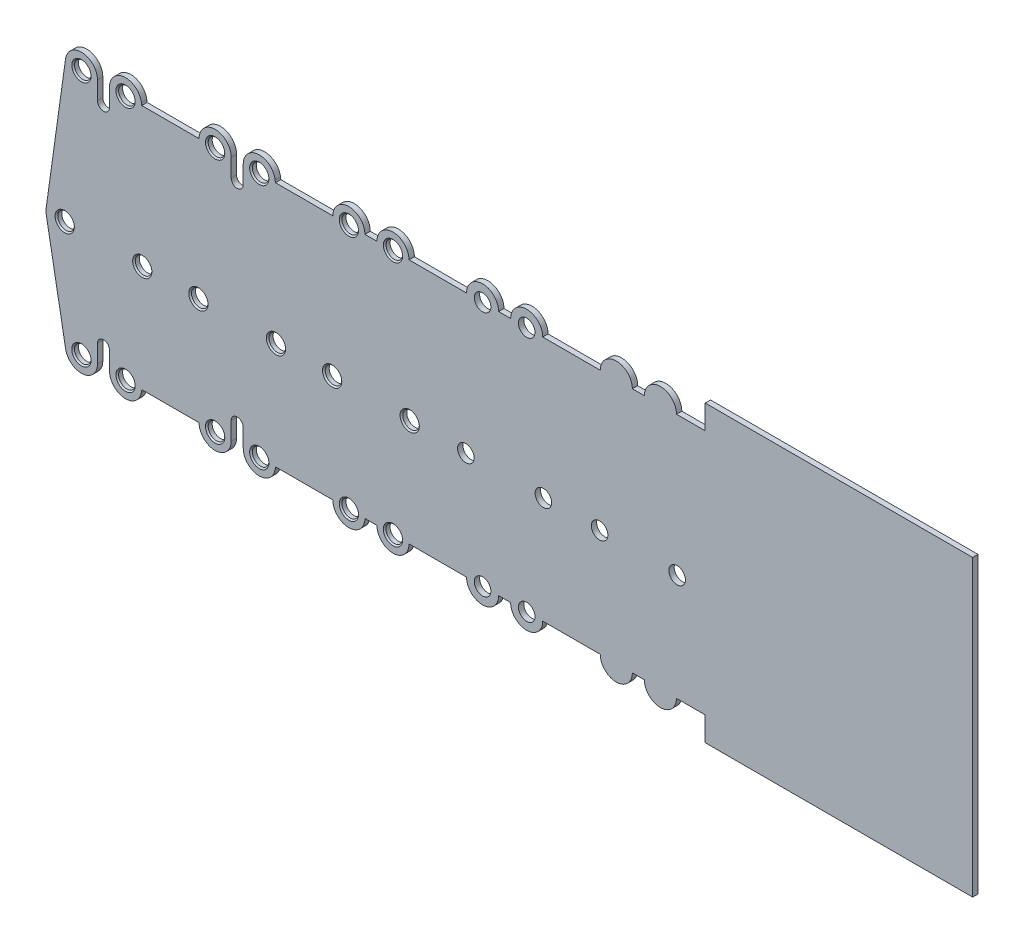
ISO-10303-21;
HEADER;
FILE_DESCRIPTION(('STEP AP214'),'2;1');
FILE_NAME('part.step','',(''),(''),'','','');
FILE_SCHEMA(('AUTOMOTIVE_DESIGN { 1 0 10303 214 1 1 1 1 }'));
ENDSEC;
DATA;
#1=APPLICATION_CONTEXT('core data for automotive mechanical design processes');
#2=APPLICATION_PROTOCOL_DEFINITION('international standard','automotive_design',2000,#1);
#3=PRODUCT_CONTEXT('',#1,'mechanical');
#4=PRODUCT('Part','Part','',(#3));
#5=PRODUCT_RELATED_PRODUCT_CATEGORY('part','',(#4));
#6=PRODUCT_DEFINITION_FORMATION('','',#4);
#7=PRODUCT_DEFINITION_CONTEXT('part definition',#1,'design');
#8=PRODUCT_DEFINITION('design','',#6,#7);
#9=PRODUCT_DEFINITION_SHAPE('','',#8);
#10=(LENGTH_UNIT() NAMED_UNIT(*) SI_UNIT(.MILLI.,.METRE.));
#11=(NAMED_UNIT(*) PLANE_ANGLE_UNIT() SI_UNIT($,.RADIAN.));
#12=(NAMED_UNIT(*) SI_UNIT($,.STERADIAN.) SOLID_ANGLE_UNIT());
#13=UNCERTAINTY_MEASURE_WITH_UNIT(LENGTH_MEASURE(1.E-05),#10,'distance_accuracy_value','');
#14=(GEOMETRIC_REPRESENTATION_CONTEXT(3) GLOBAL_UNCERTAINTY_ASSIGNED_CONTEXT((#13)) GLOBAL_UNIT_ASSIGNED_CONTEXT((#10,
#11,#12)) REPRESENTATION_CONTEXT('',''));
#15=CARTESIAN_POINT('',(0.,0.,0.));
#16=DIRECTION('',(0.,0.,1.));
#17=DIRECTION('',(1.,0.,0.));
#18=AXIS2_PLACEMENT_3D('',#15,#16,#17);
#19=CARTESIAN_POINT('',(75.,-40.,0.));
#20=DIRECTION('',(0.,-1.,0.));
#21=DIRECTION('',(1.,0.,0.));
#22=AXIS2_PLACEMENT_3D('',#19,#20,#21);
#23=PLANE('',#22);
#24=DIRECTION('',(0.,0.,-1.));
#25=VECTOR('',#24,1.);
#26=CARTESIAN_POINT('',(225.,-39.9999999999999,0.));
#27=LINE('',#26,#25);
#28=CARTESIAN_POINT('',(225.,-39.9999999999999,2.));
#29=VERTEX_POINT('',#28);
#30=CARTESIAN_POINT('',(225.,-39.9999999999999,0.));
#31=VERTEX_POINT('',#30);
#32=EDGE_CURVE('E455',#29,#31,#27,.T.);
#33=ORIENTED_EDGE('',*,*,#32,.F.);
#34=DIRECTION('',(1.,0.,0.));
#35=VECTOR('',#34,1.);
#36=CARTESIAN_POINT('',(75.,-40.,2.));
#37=LINE('',#36,#35);
#38=CARTESIAN_POINT('',(214.25,-39.9999999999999,2.));
#39=VERTEX_POINT('',#38);
#40=EDGE_CURVE('E53',#39,#29,#37,.T.);
#41=ORIENTED_EDGE('',*,*,#40,.F.);
#42=DIRECTION('',(0.,0.,1.));
#43=VECTOR('',#42,1.);
#44=CARTESIAN_POINT('',(214.25,-40.,0.));
#45=LINE('',#44,#43);
#46=CARTESIAN_POINT('',(214.25,-40.,0.));
#47=VERTEX_POINT('',#46);
#48=EDGE_CURVE('E514',#47,#39,#45,.T.);
#49=ORIENTED_EDGE('',*,*,#48,.F.);
#50=DIRECTION('',(1.,0.,0.));
#51=VECTOR('',#50,1.);
#52=CARTESIAN_POINT('',(75.,-40.,0.));
#53=LINE('',#52,#51);
#54=EDGE_CURVE('E661',#47,#31,#53,.T.);
#55=ORIENTED_EDGE('',*,*,#54,.T.);
#56=EDGE_LOOP('',(#33,#41,#49,#55));
#57=FACE_BOUND('',#56,.T.);
#58=ADVANCED_FACE('F31',(#57),#23,.T.);
#59=DIRECTION('',(0.,0.,1.));
#60=VECTOR('',#59,1.);
#61=CARTESIAN_POINT('',(202.25,-40.,0.));
#62=LINE('',#61,#60);
#63=CARTESIAN_POINT('',(202.25,-39.9999999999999,0.));
#64=VERTEX_POINT('',#63);
#65=CARTESIAN_POINT('',(202.25,-39.9999999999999,2.));
#66=VERTEX_POINT('',#65);
#67=EDGE_CURVE('E515',#64,#66,#62,.T.);
#68=ORIENTED_EDGE('',*,*,#67,.T.);
#69=CARTESIAN_POINT('',(197.75,-39.9999999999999,2.));
#70=VERTEX_POINT('',#69);
#71=EDGE_CURVE('E1121',#70,#66,#37,.T.);
#72=ORIENTED_EDGE('',*,*,#71,.F.);
#73=DIRECTION('',(0.,0.,1.));
#74=VECTOR('',#73,1.);
#75=CARTESIAN_POINT('',(197.75,-40.,0.));
#76=LINE('',#75,#74);
#77=CARTESIAN_POINT('',(197.75,-40.,0.));
#78=VERTEX_POINT('',#77);
#79=EDGE_CURVE('E524',#78,#70,#76,.T.);
#80=ORIENTED_EDGE('',*,*,#79,.F.);
#81=EDGE_CURVE('E1132',#78,#64,#53,.T.);
#82=ORIENTED_EDGE('',*,*,#81,.T.);
#83=EDGE_LOOP('',(#68,#72,#80,#82));
#84=FACE_BOUND('',#83,.T.);
#85=ADVANCED_FACE('F1063',(#84),#23,.T.);
#86=CARTESIAN_POINT('',(75.,52.,0.));
#87=DIRECTION('',(0.,1.,0.));
#88=DIRECTION('',(0.,0.,1.));
#89=AXIS2_PLACEMENT_3D('',#86,#87,#88);
#90=PLANE('',#89);
#91=DIRECTION('',(0.,0.,1.));
#92=VECTOR('',#91,1.);
#93=CARTESIAN_POINT('',(202.25,52.,0.));
#94=LINE('',#93,#92);
#95=CARTESIAN_POINT('',(202.25,52.,0.));
#96=VERTEX_POINT('',#95);
#97=CARTESIAN_POINT('',(202.25,52.,2.));
#98=VERTEX_POINT('',#97);
#99=EDGE_CURVE('E533',#96,#98,#94,.T.);
#100=ORIENTED_EDGE('',*,*,#99,.F.);
#101=DIRECTION('',(-1.,0.,0.));
#102=VECTOR('',#101,1.);
#103=CARTESIAN_POINT('',(75.,52.,0.));
#104=LINE('',#103,#102);
#105=CARTESIAN_POINT('',(197.75,52.,0.));
#106=VERTEX_POINT('',#105);
#107=EDGE_CURVE('E671',#96,#106,#104,.T.);
#108=ORIENTED_EDGE('',*,*,#107,.T.);
#109=DIRECTION('',(0.,0.,1.));
#110=VECTOR('',#109,1.);
#111=CARTESIAN_POINT('',(197.75,52.,0.));
#112=LINE('',#111,#110);
#113=CARTESIAN_POINT('',(197.75,52.,2.));
#114=VERTEX_POINT('',#113);
#115=EDGE_CURVE('E544',#106,#114,#112,.T.);
#116=ORIENTED_EDGE('',*,*,#115,.T.);
#117=DIRECTION('',(-1.,0.,0.));
#118=VECTOR('',#117,1.);
#119=CARTESIAN_POINT('',(75.,52.,2.));
#120=LINE('',#119,#118);
#121=EDGE_CURVE('E662',#98,#114,#120,.T.);
#122=ORIENTED_EDGE('',*,*,#121,.F.);
#123=EDGE_LOOP('',(#100,#108,#116,#122));
#124=FACE_BOUND('',#123,.T.);
#125=ADVANCED_FACE('F1069',(#124),#90,.T.);
#126=DIRECTION('',(0.,0.,1.));
#127=VECTOR('',#126,1.);
#128=CARTESIAN_POINT('',(185.75,52.,0.));
#129=LINE('',#128,#127);
#130=CARTESIAN_POINT('',(185.75,52.,0.));
#131=VERTEX_POINT('',#130);
#132=CARTESIAN_POINT('',(185.75,52.,2.));
#133=VERTEX_POINT('',#132);
#134=EDGE_CURVE('E543',#131,#133,#129,.T.);
#135=ORIENTED_EDGE('',*,*,#134,.F.);
#136=CARTESIAN_POINT('',(164.25,52.,0.));
#137=VERTEX_POINT('',#136);
#138=EDGE_CURVE('E1271',#131,#137,#104,.T.);
#139=ORIENTED_EDGE('',*,*,#138,.T.);
#140=DIRECTION('',(0.,0.,1.));
#141=VECTOR('',#140,1.);
#142=CARTESIAN_POINT('',(164.25,52.,0.));
#143=LINE('',#142,#141);
#144=CARTESIAN_POINT('',(164.25,52.,2.));
#145=VERTEX_POINT('',#144);
#146=EDGE_CURVE('E576',#137,#145,#143,.T.);
#147=ORIENTED_EDGE('',*,*,#146,.T.);
#148=EDGE_CURVE('E1256',#133,#145,#120,.T.);
#149=ORIENTED_EDGE('',*,*,#148,.F.);
#150=EDGE_LOOP('',(#135,#139,#147,#149));
#151=FACE_BOUND('',#150,.T.);
#152=ADVANCED_FACE('F1290',(#151),#90,.T.);
#153=DIRECTION('',(0.,0.,1.));
#154=VECTOR('',#153,1.);
#155=CARTESIAN_POINT('',(185.75,-40.,0.));
#156=LINE('',#155,#154);
#157=CARTESIAN_POINT('',(185.75,-39.9999999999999,0.));
#158=VERTEX_POINT('',#157);
#159=CARTESIAN_POINT('',(185.75,-39.9999999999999,2.));
#160=VERTEX_POINT('',#159);
#161=EDGE_CURVE('E525',#158,#160,#156,.T.);
#162=ORIENTED_EDGE('',*,*,#161,.T.);
#163=CARTESIAN_POINT('',(164.25,-39.9999999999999,2.));
#164=VERTEX_POINT('',#163);
#165=EDGE_CURVE('E1118',#164,#160,#37,.T.);
#166=ORIENTED_EDGE('',*,*,#165,.F.);
#167=DIRECTION('',(0.,0.,1.));
#168=VECTOR('',#167,1.);
#169=CARTESIAN_POINT('',(164.25,-40.,0.));
#170=LINE('',#169,#168);
#171=CARTESIAN_POINT('',(164.25,-40.,0.));
#172=VERTEX_POINT('',#171);
#173=EDGE_CURVE('E555',#172,#164,#170,.T.);
#174=ORIENTED_EDGE('',*,*,#173,.F.);
#175=EDGE_CURVE('E1133',#172,#158,#53,.T.);
#176=ORIENTED_EDGE('',*,*,#175,.T.);
#177=EDGE_LOOP('',(#162,#166,#174,#176));
#178=FACE_BOUND('',#177,.T.);
#179=ADVANCED_FACE('F1071',(#178),#23,.T.);
#180=DIRECTION('',(0.,0.,1.));
#181=VECTOR('',#180,1.);
#182=CARTESIAN_POINT('',(152.25,-40.,0.));
#183=LINE('',#182,#181);
#184=CARTESIAN_POINT('',(152.25,-39.9999999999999,0.));
#185=VERTEX_POINT('',#184);
#186=CARTESIAN_POINT('',(152.25,-39.9999999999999,2.));
#187=VERTEX_POINT('',#186);
#188=EDGE_CURVE('E556',#185,#187,#183,.T.);
#189=ORIENTED_EDGE('',*,*,#188,.T.);
#190=CARTESIAN_POINT('',(147.75,-39.9999999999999,2.));
#191=VERTEX_POINT('',#190);
#192=EDGE_CURVE('E1116',#191,#187,#37,.T.);
#193=ORIENTED_EDGE('',*,*,#192,.F.);
#194=DIRECTION('',(0.,0.,1.));
#195=VECTOR('',#194,1.);
#196=CARTESIAN_POINT('',(147.75,-40.,0.));
#197=LINE('',#196,#195);
#198=CARTESIAN_POINT('',(147.75,-40.,0.));
#199=VERTEX_POINT('',#198);
#200=EDGE_CURVE('E566',#199,#191,#197,.T.);
#201=ORIENTED_EDGE('',*,*,#200,.F.);
#202=EDGE_CURVE('E1134',#199,#185,#53,.T.);
#203=ORIENTED_EDGE('',*,*,#202,.T.);
#204=EDGE_LOOP('',(#189,#193,#201,#203));
#205=FACE_BOUND('',#204,.T.);
#206=ADVANCED_FACE('F1100',(#205),#23,.T.);
#207=DIRECTION('',(0.,0.,1.));
#208=VECTOR('',#207,1.);
#209=CARTESIAN_POINT('',(152.25,52.,0.));
#210=LINE('',#209,#208);
#211=CARTESIAN_POINT('',(152.25,52.,0.));
#212=VERTEX_POINT('',#211);
#213=CARTESIAN_POINT('',(152.25,52.,2.));
#214=VERTEX_POINT('',#213);
#215=EDGE_CURVE('E575',#212,#214,#210,.T.);
#216=ORIENTED_EDGE('',*,*,#215,.F.);
#217=CARTESIAN_POINT('',(147.75,52.,0.));
#218=VERTEX_POINT('',#217);
#219=EDGE_CURVE('E1230',#212,#218,#104,.T.);
#220=ORIENTED_EDGE('',*,*,#219,.T.);
#221=DIRECTION('',(0.,0.,1.));
#222=VECTOR('',#221,1.);
#223=CARTESIAN_POINT('',(147.75,52.,0.));
#224=LINE('',#223,#222);
#225=CARTESIAN_POINT('',(147.75,52.,2.));
#226=VERTEX_POINT('',#225);
#227=EDGE_CURVE('E586',#218,#226,#224,.T.);
#228=ORIENTED_EDGE('',*,*,#227,.T.);
#229=EDGE_CURVE('E1253',#214,#226,#120,.T.);
#230=ORIENTED_EDGE('',*,*,#229,.F.);
#231=EDGE_LOOP('',(#216,#220,#228,#230));
#232=FACE_BOUND('',#231,.T.);
#233=ADVANCED_FACE('F1279',(#232),#90,.T.);
#234=DIRECTION('',(0.,0.,1.));
#235=VECTOR('',#234,1.);
#236=CARTESIAN_POINT('',(135.75,52.,0.));
#237=LINE('',#236,#235);
#238=CARTESIAN_POINT('',(135.75,52.,0.));
#239=VERTEX_POINT('',#238);
#240=CARTESIAN_POINT('',(135.75,52.,2.));
#241=VERTEX_POINT('',#240);
#242=EDGE_CURVE('E585',#239,#241,#237,.T.);
#243=ORIENTED_EDGE('',*,*,#242,.F.);
#244=CARTESIAN_POINT('',(114.25,52.,0.));
#245=VERTEX_POINT('',#244);
#246=EDGE_CURVE('E1229',#239,#245,#104,.T.);
#247=ORIENTED_EDGE('',*,*,#246,.T.);
#248=DIRECTION('',(0.,0.,1.));
#249=VECTOR('',#248,1.);
#250=CARTESIAN_POINT('',(114.25,52.,0.));
#251=LINE('',#250,#249);
#252=CARTESIAN_POINT('',(114.25,52.,2.));
#253=VERTEX_POINT('',#252);
#254=EDGE_CURVE('E635',#245,#253,#251,.T.);
#255=ORIENTED_EDGE('',*,*,#254,.T.);
#256=EDGE_CURVE('E1252',#241,#253,#120,.T.);
#257=ORIENTED_EDGE('',*,*,#256,.F.);
#258=EDGE_LOOP('',(#243,#247,#255,#257));
#259=FACE_BOUND('',#258,.T.);
#260=ADVANCED_FACE('F1098',(#259),#90,.T.);
#261=DIRECTION('',(0.,0.,1.));
#262=VECTOR('',#261,1.);
#263=CARTESIAN_POINT('',(135.75,-40.,0.));
#264=LINE('',#263,#262);
#265=CARTESIAN_POINT('',(135.75,-39.9999999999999,0.));
#266=VERTEX_POINT('',#265);
#267=CARTESIAN_POINT('',(135.75,-39.9999999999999,2.));
#268=VERTEX_POINT('',#267);
#269=EDGE_CURVE('E567',#266,#268,#264,.T.);
#270=ORIENTED_EDGE('',*,*,#269,.T.);
#271=CARTESIAN_POINT('',(114.25,-39.9999999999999,2.));
#272=VERTEX_POINT('',#271);
#273=EDGE_CURVE('E1110',#272,#268,#37,.T.);
#274=ORIENTED_EDGE('',*,*,#273,.F.);
#275=DIRECTION('',(0.,0.,1.));
#276=VECTOR('',#275,1.);
#277=CARTESIAN_POINT('',(114.25,-40.,0.));
#278=LINE('',#277,#276);
#279=CARTESIAN_POINT('',(114.25,-40.,0.));
#280=VERTEX_POINT('',#279);
#281=EDGE_CURVE('E615',#280,#272,#278,.T.);
#282=ORIENTED_EDGE('',*,*,#281,.F.);
#283=EDGE_CURVE('E1113',#280,#266,#53,.T.);
#284=ORIENTED_EDGE('',*,*,#283,.T.);
#285=EDGE_LOOP('',(#270,#274,#282,#284));
#286=FACE_BOUND('',#285,.T.);
#287=ADVANCED_FACE('F1091',(#286),#23,.T.);
#288=DIRECTION('',(0.,0.,1.));
#289=VECTOR('',#288,1.);
#290=CARTESIAN_POINT('',(102.25,-40.,0.));
#291=LINE('',#290,#289);
#292=CARTESIAN_POINT('',(102.25,-39.9999999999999,0.));
#293=VERTEX_POINT('',#292);
#294=CARTESIAN_POINT('',(102.25,-39.9999999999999,2.));
#295=VERTEX_POINT('',#294);
#296=EDGE_CURVE('E616',#293,#295,#291,.T.);
#297=ORIENTED_EDGE('',*,*,#296,.T.);
#298=CARTESIAN_POINT('',(97.75,-39.9999999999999,2.));
#299=VERTEX_POINT('',#298);
#300=EDGE_CURVE('E658',#299,#295,#37,.T.);
#301=ORIENTED_EDGE('',*,*,#300,.F.);
#302=DIRECTION('',(0.,0.,1.));
#303=VECTOR('',#302,1.);
#304=CARTESIAN_POINT('',(97.75,-40.,0.));
#305=LINE('',#304,#303);
#306=CARTESIAN_POINT('',(97.75,-40.,0.));
#307=VERTEX_POINT('',#306);
#308=EDGE_CURVE('E624',#307,#299,#305,.T.);
#309=ORIENTED_EDGE('',*,*,#308,.F.);
#310=EDGE_CURVE('E667',#307,#293,#53,.T.);
#311=ORIENTED_EDGE('',*,*,#310,.T.);
#312=EDGE_LOOP('',(#297,#301,#309,#311));
#313=FACE_BOUND('',#312,.T.);
#314=ADVANCED_FACE('F1078',(#313),#23,.T.);
#315=DIRECTION('',(0.,0.,1.));
#316=VECTOR('',#315,1.);
#317=CARTESIAN_POINT('',(102.25,52.,0.));
#318=LINE('',#317,#316);
#319=CARTESIAN_POINT('',(102.25,52.,0.));
#320=VERTEX_POINT('',#319);
#321=CARTESIAN_POINT('',(102.25,52.,2.));
#322=VERTEX_POINT('',#321);
#323=EDGE_CURVE('E634',#320,#322,#318,.T.);
#324=ORIENTED_EDGE('',*,*,#323,.F.);
#325=CARTESIAN_POINT('',(97.75,52.,0.));
#326=VERTEX_POINT('',#325);
#327=EDGE_CURVE('E1227',#320,#326,#104,.T.);
#328=ORIENTED_EDGE('',*,*,#327,.T.);
#329=DIRECTION('',(0.,0.,1.));
#330=VECTOR('',#329,1.);
#331=CARTESIAN_POINT('',(97.75,52.,0.));
#332=LINE('',#331,#330);
#333=CARTESIAN_POINT('',(97.75,52.,2.));
#334=VERTEX_POINT('',#333);
#335=EDGE_CURVE('E645',#326,#334,#332,.T.);
#336=ORIENTED_EDGE('',*,*,#335,.T.);
#337=EDGE_CURVE('E1225',#322,#334,#120,.T.);
#338=ORIENTED_EDGE('',*,*,#337,.F.);
#339=EDGE_LOOP('',(#324,#328,#336,#338));
#340=FACE_BOUND('',#339,.T.);
#341=ADVANCED_FACE('F1090',(#340),#90,.T.);
#342=DIRECTION('',(0.,0.,1.));
#343=VECTOR('',#342,1.);
#344=CARTESIAN_POINT('',(85.75,52.,0.));
#345=LINE('',#344,#343);
#346=CARTESIAN_POINT('',(85.75,52.,0.));
#347=VERTEX_POINT('',#346);
#348=CARTESIAN_POINT('',(85.75,52.,2.));
#349=VERTEX_POINT('',#348);
#350=EDGE_CURVE('E644',#347,#349,#345,.T.);
#351=ORIENTED_EDGE('',*,*,#350,.F.);
#352=CARTESIAN_POINT('',(64.3081903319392,52.,0.));
#353=VERTEX_POINT('',#352);
#354=EDGE_CURVE('E666',#347,#353,#104,.T.);
#355=ORIENTED_EDGE('',*,*,#354,.T.);
#356=DIRECTION('',(0.,0.,1.));
#357=VECTOR('',#356,1.);
#358=CARTESIAN_POINT('',(64.3081903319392,52.,0.));
#359=LINE('',#358,#357);
#360=CARTESIAN_POINT('',(64.3081903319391,52.,2.));
#361=VERTEX_POINT('',#360);
#362=EDGE_CURVE('E672',#353,#361,#359,.T.);
#363=ORIENTED_EDGE('',*,*,#362,.T.);
#364=EDGE_CURVE('E657',#349,#361,#120,.T.);
#365=ORIENTED_EDGE('',*,*,#364,.F.);
#366=EDGE_LOOP('',(#351,#355,#363,#365));
#367=FACE_BOUND('',#366,.T.);
#368=ADVANCED_FACE('F1088',(#367),#90,.T.);
#369=CARTESIAN_POINT('',(-14.5,0.,2.));
#370=DIRECTION('',(0.,0.,1.));
#371=DIRECTION('',(1.,0.,0.));
#372=AXIS2_PLACEMENT_3D('',#369,#370,#371);
#373=PLANE('',#372);
#374=ORIENTED_EDGE('',*,*,#40,.T.);
#375=DIRECTION('',(0.,-1.,0.));
#376=VECTOR('',#375,1.);
#377=CARTESIAN_POINT('',(225.,61.,2.));
#378=LINE('',#377,#376);
#379=CARTESIAN_POINT('',(225.,-49.,2.));
#380=VERTEX_POINT('',#379);
#381=EDGE_CURVE('E420',#29,#380,#378,.T.);
#382=ORIENTED_EDGE('',*,*,#381,.T.);
#383=DIRECTION('',(1.,0.,0.));
#384=VECTOR('',#383,1.);
#385=CARTESIAN_POINT('',(225.,-49.,2.));
#386=LINE('',#385,#384);
#387=CARTESIAN_POINT('',(325.,-49.,2.));
#388=VERTEX_POINT('',#387);
#389=EDGE_CURVE('E425',#380,#388,#386,.T.);
#390=ORIENTED_EDGE('',*,*,#389,.T.);
#391=DIRECTION('',(0.,-1.,0.));
#392=VECTOR('',#391,1.);
#393=CARTESIAN_POINT('',(325.,52.,2.));
#394=LINE('',#393,#392);
#395=CARTESIAN_POINT('',(325.,61.,2.));
#396=VERTEX_POINT('',#395);
#397=EDGE_CURVE('E648',#396,#388,#394,.T.);
#398=ORIENTED_EDGE('',*,*,#397,.F.);
#399=DIRECTION('',(-1.,0.,0.));
#400=VECTOR('',#399,1.);
#401=CARTESIAN_POINT('',(225.,61.,2.));
#402=LINE('',#401,#400);
#403=CARTESIAN_POINT('',(225.,61.,2.));
#404=VERTEX_POINT('',#403);
#405=EDGE_CURVE('E443',#396,#404,#402,.T.);
#406=ORIENTED_EDGE('',*,*,#405,.T.);
#407=CARTESIAN_POINT('',(225.,52.,2.));
#408=VERTEX_POINT('',#407);
#409=EDGE_CURVE('E46',#404,#408,#378,.T.);
#410=ORIENTED_EDGE('',*,*,#409,.T.);
#411=CARTESIAN_POINT('',(214.25,52.,2.));
#412=VERTEX_POINT('',#411);
#413=EDGE_CURVE('E659',#408,#412,#120,.T.);
#414=ORIENTED_EDGE('',*,*,#413,.T.);
#415=CARTESIAN_POINT('',(208.25,52.,2.));
#416=DIRECTION('',(0.,0.,1.));
#417=DIRECTION('',(-1.,0.,0.));
#418=AXIS2_PLACEMENT_3D('',#415,#416,#417);
#419=CIRCLE('',#418,6.00000000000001);
#420=EDGE_CURVE('E527',#412,#98,#419,.T.);
#421=ORIENTED_EDGE('',*,*,#420,.T.);
#422=ORIENTED_EDGE('',*,*,#121,.T.);
#423=CARTESIAN_POINT('',(191.75,52.,2.));
#424=DIRECTION('',(0.,0.,1.));
#425=DIRECTION('',(1.,0.,0.));
#426=AXIS2_PLACEMENT_3D('',#423,#424,#425);
#427=CIRCLE('',#426,6.00000000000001);
#428=EDGE_CURVE('E537',#114,#133,#427,.T.);
#429=ORIENTED_EDGE('',*,*,#428,.T.);
#430=ORIENTED_EDGE('',*,*,#148,.T.);
#431=CARTESIAN_POINT('',(158.25,52.,2.));
#432=DIRECTION('',(0.,0.,1.));
#433=DIRECTION('',(-1.,0.,0.));
#434=AXIS2_PLACEMENT_3D('',#431,#432,#433);
#435=CIRCLE('',#434,6.00000000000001);
#436=EDGE_CURVE('E569',#145,#214,#435,.T.);
#437=ORIENTED_EDGE('',*,*,#436,.T.);
#438=ORIENTED_EDGE('',*,*,#229,.T.);
#439=CARTESIAN_POINT('',(141.75,52.,2.));
#440=DIRECTION('',(0.,0.,1.));
#441=DIRECTION('',(1.,0.,0.));
#442=AXIS2_PLACEMENT_3D('',#439,#440,#441);
#443=CIRCLE('',#442,6.00000000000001);
#444=EDGE_CURVE('E579',#226,#241,#443,.T.);
#445=ORIENTED_EDGE('',*,*,#444,.T.);
#446=ORIENTED_EDGE('',*,*,#256,.T.);
#447=CARTESIAN_POINT('',(108.25,52.,2.));
#448=DIRECTION('',(0.,0.,1.));
#449=DIRECTION('',(-1.,0.,0.));
#450=AXIS2_PLACEMENT_3D('',#447,#448,#449);
#451=CIRCLE('',#450,6.00000000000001);
#452=EDGE_CURVE('E628',#253,#322,#451,.T.);
#453=ORIENTED_EDGE('',*,*,#452,.T.);
#454=ORIENTED_EDGE('',*,*,#337,.T.);
#455=CARTESIAN_POINT('',(91.75,52.,2.));
#456=DIRECTION('',(0.,0.,1.));
#457=DIRECTION('',(1.,0.,0.));
#458=AXIS2_PLACEMENT_3D('',#455,#456,#457);
#459=CIRCLE('',#458,6.00000000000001);
#460=EDGE_CURVE('E638',#334,#349,#459,.T.);
#461=ORIENTED_EDGE('',*,*,#460,.T.);
#462=ORIENTED_EDGE('',*,*,#364,.T.);
#463=DIRECTION('',(-0.138268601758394,0.990394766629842,0.));
#464=VECTOR('',#463,1.);
#465=CARTESIAN_POINT('',(64.1923685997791,52.8296116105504,2.));
#466=LINE('',#465,#464);
#467=CARTESIAN_POINT('',(64.1923685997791,52.8296116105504,2.));
#468=VERTEX_POINT('',#467);
#469=EDGE_CURVE('E739',#361,#468,#466,.T.);
#470=ORIENTED_EDGE('',*,*,#469,.T.);
#471=CARTESIAN_POINT('',(58.25,52.,2.));
#472=DIRECTION('',(0.,0.,1.));
#473=DIRECTION('',(1.,0.,0.));
#474=AXIS2_PLACEMENT_3D('',#471,#472,#473);
#475=CIRCLE('',#474,6.00000000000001);
#476=CARTESIAN_POINT('',(52.25,52.,2.));
#477=VERTEX_POINT('',#476);
#478=EDGE_CURVE('E741',#468,#477,#475,.T.);
#479=ORIENTED_EDGE('',*,*,#478,.T.);
#480=DIRECTION('',(0.,-1.,0.));
#481=VECTOR('',#480,1.);
#482=CARTESIAN_POINT('',(52.25,45.25,2.));
#483=LINE('',#482,#481);
#484=CARTESIAN_POINT('',(52.25,45.25,2.));
#485=VERTEX_POINT('',#484);
#486=EDGE_CURVE('E743',#477,#485,#483,.T.);
#487=ORIENTED_EDGE('',*,*,#486,.T.);
#488=CARTESIAN_POINT('',(50.,45.25,2.));
#489=DIRECTION('',(0.,0.,-1.));
#490=DIRECTION('',(-1.,0.,0.));
#491=AXIS2_PLACEMENT_3D('',#488,#489,#490);
#492=CIRCLE('',#491,2.25);
#493=CARTESIAN_POINT('',(47.75,45.25,2.));
#494=VERTEX_POINT('',#493);
#495=EDGE_CURVE('E745',#485,#494,#492,.T.);
#496=ORIENTED_EDGE('',*,*,#495,.T.);
#497=DIRECTION('',(0.,1.,0.));
#498=VECTOR('',#497,1.);
#499=CARTESIAN_POINT('',(47.75,45.25,2.));
#500=LINE('',#499,#498);
#501=CARTESIAN_POINT('',(47.75,52.,2.));
#502=VERTEX_POINT('',#501);
#503=EDGE_CURVE('E747',#494,#502,#500,.T.);
#504=ORIENTED_EDGE('',*,*,#503,.T.);
#505=CARTESIAN_POINT('',(41.75,52.,2.));
#506=DIRECTION('',(0.,0.,1.));
#507=DIRECTION('',(1.,0.,0.));
#508=AXIS2_PLACEMENT_3D('',#505,#506,#507);
#509=CIRCLE('',#508,6.);
#510=CARTESIAN_POINT('',(35.807631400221,52.8296116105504,2.));
#511=VERTEX_POINT('',#510);
#512=EDGE_CURVE('E749',#502,#511,#509,.T.);
#513=ORIENTED_EDGE('',*,*,#512,.T.);
#514=DIRECTION('',(-0.138268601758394,-0.990394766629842,0.));
#515=VECTOR('',#514,1.);
#516=CARTESIAN_POINT('',(35.807631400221,52.8296116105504,2.));
#517=LINE('',#516,#515);
#518=CARTESIAN_POINT('',(35.6918096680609,52.,2.));
#519=VERTEX_POINT('',#518);
#520=EDGE_CURVE('E751',#511,#519,#517,.T.);
#521=ORIENTED_EDGE('',*,*,#520,.T.);
#522=DIRECTION('',(-1.,0.,0.));
#523=VECTOR('',#522,1.);
#524=CARTESIAN_POINT('',(25.,52.,2.));
#525=LINE('',#524,#523);
#526=CARTESIAN_POINT('',(14.3081903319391,52.,2.));
#527=VERTEX_POINT('',#526);
#528=EDGE_CURVE('E798',#519,#527,#525,.T.);
#529=ORIENTED_EDGE('',*,*,#528,.T.);
#530=DIRECTION('',(-0.138268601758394,0.990394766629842,0.));
#531=VECTOR('',#530,1.);
#532=CARTESIAN_POINT('',(14.1923685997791,52.8296116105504,2.));
#533=LINE('',#532,#531);
#534=CARTESIAN_POINT('',(14.192368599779,52.8296116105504,2.));
#535=VERTEX_POINT('',#534);
#536=EDGE_CURVE('E879',#527,#535,#533,.T.);
#537=ORIENTED_EDGE('',*,*,#536,.T.);
#538=CARTESIAN_POINT('',(8.24999999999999,52.,2.));
#539=DIRECTION('',(0.,0.,1.));
#540=DIRECTION('',(1.,0.,0.));
#541=AXIS2_PLACEMENT_3D('',#538,#539,#540);
#542=CIRCLE('',#541,6.00000000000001);
#543=CARTESIAN_POINT('',(2.24999999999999,52.,2.));
#544=VERTEX_POINT('',#543);
#545=EDGE_CURVE('E881',#535,#544,#542,.T.);
#546=ORIENTED_EDGE('',*,*,#545,.T.);
#547=DIRECTION('',(0.,-1.,0.));
#548=VECTOR('',#547,1.);
#549=CARTESIAN_POINT('',(2.25,45.25,2.));
#550=LINE('',#549,#548);
#551=CARTESIAN_POINT('',(2.25,45.25,2.));
#552=VERTEX_POINT('',#551);
#553=EDGE_CURVE('E883',#544,#552,#550,.T.);
#554=ORIENTED_EDGE('',*,*,#553,.T.);
#555=CARTESIAN_POINT('',(0.,45.25,2.));
#556=DIRECTION('',(0.,0.,-1.));
#557=DIRECTION('',(-1.,0.,0.));
#558=AXIS2_PLACEMENT_3D('',#555,#556,#557);
#559=CIRCLE('',#558,2.25);
#560=CARTESIAN_POINT('',(-2.25,45.25,2.));
#561=VERTEX_POINT('',#560);
#562=EDGE_CURVE('E885',#552,#561,#559,.T.);
#563=ORIENTED_EDGE('',*,*,#562,.T.);
#564=DIRECTION('',(0.,1.,0.));
#565=VECTOR('',#564,1.);
#566=CARTESIAN_POINT('',(-2.25,45.25,2.));
#567=LINE('',#566,#565);
#568=CARTESIAN_POINT('',(-2.25000000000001,52.,2.));
#569=VERTEX_POINT('',#568);
#570=EDGE_CURVE('E887',#561,#569,#567,.T.);
#571=ORIENTED_EDGE('',*,*,#570,.T.);
#572=CARTESIAN_POINT('',(-8.25000000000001,52.,2.));
#573=DIRECTION('',(0.,0.,1.));
#574=DIRECTION('',(1.,0.,0.));
#575=AXIS2_PLACEMENT_3D('',#572,#573,#574);
#576=CIRCLE('',#575,6.);
#577=CARTESIAN_POINT('',(-14.192368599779,52.8296116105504,2.));
#578=VERTEX_POINT('',#577);
#579=EDGE_CURVE('E889',#569,#578,#576,.T.);
#580=ORIENTED_EDGE('',*,*,#579,.T.);
#581=DIRECTION('',(-0.138268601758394,-0.990394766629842,0.));
#582=VECTOR('',#581,1.);
#583=CARTESIAN_POINT('',(-14.192368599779,52.8296116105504,2.));
#584=LINE('',#583,#582);
#585=CARTESIAN_POINT('',(-21.4327633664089,0.967880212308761,2.));
#586=VERTEX_POINT('',#585);
#587=EDGE_CURVE('E891',#578,#586,#584,.T.);
#588=ORIENTED_EDGE('',*,*,#587,.T.);
#589=CARTESIAN_POINT('',(-14.5,0.,2.));
#590=DIRECTION('',(0.,0.,1.));
#591=DIRECTION('',(1.,0.,0.));
#592=AXIS2_PLACEMENT_3D('',#589,#590,#591);
#593=CIRCLE('',#592,7.00000000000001);
#594=CARTESIAN_POINT('',(-21.3872820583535,-1.25113782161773,2.));
#595=VERTEX_POINT('',#594);
#596=EDGE_CURVE('E861',#586,#595,#593,.T.);
#597=ORIENTED_EDGE('',*,*,#596,.T.);
#598=DIRECTION('',(0.178733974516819,-0.983897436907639,0.));
#599=VECTOR('',#598,1.);
#600=CARTESIAN_POINT('',(-21.3872820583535,-1.25113782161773,2.));
#601=LINE('',#600,#599);
#602=CARTESIAN_POINT('',(-14.1533846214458,-41.0724038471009,2.));
#603=VERTEX_POINT('',#602);
#604=EDGE_CURVE('E864',#595,#603,#601,.T.);
#605=ORIENTED_EDGE('',*,*,#604,.T.);
#606=CARTESIAN_POINT('',(-8.25,-40.,2.));
#607=DIRECTION('',(0.,0.,1.));
#608=DIRECTION('',(1.,0.,0.));
#609=AXIS2_PLACEMENT_3D('',#606,#607,#608);
#610=CIRCLE('',#609,6.);
#611=CARTESIAN_POINT('',(-2.25,-40.,2.));
#612=VERTEX_POINT('',#611);
#613=EDGE_CURVE('E866',#603,#612,#610,.T.);
#614=ORIENTED_EDGE('',*,*,#613,.T.);
#615=DIRECTION('',(0.,1.,0.));
#616=VECTOR('',#615,1.);
#617=CARTESIAN_POINT('',(-2.25,-33.25,2.));
#618=LINE('',#617,#616);
#619=CARTESIAN_POINT('',(-2.25,-33.25,2.));
#620=VERTEX_POINT('',#619);
#621=EDGE_CURVE('E868',#612,#620,#618,.T.);
#622=ORIENTED_EDGE('',*,*,#621,.T.);
#623=CARTESIAN_POINT('',(0.,-33.25,2.));
#624=DIRECTION('',(0.,0.,-1.));
#625=DIRECTION('',(1.,0.,0.));
#626=AXIS2_PLACEMENT_3D('',#623,#624,#625);
#627=CIRCLE('',#626,2.25);
#628=CARTESIAN_POINT('',(2.25,-33.25,2.));
#629=VERTEX_POINT('',#628);
#630=EDGE_CURVE('E870',#620,#629,#627,.T.);
#631=ORIENTED_EDGE('',*,*,#630,.T.);
#632=DIRECTION('',(0.,-1.,0.));
#633=VECTOR('',#632,1.);
#634=CARTESIAN_POINT('',(2.25,-33.25,2.));
#635=LINE('',#634,#633);
#636=CARTESIAN_POINT('',(2.25,-40.,2.));
#637=VERTEX_POINT('',#636);
#638=EDGE_CURVE('E872',#629,#637,#635,.T.);
#639=ORIENTED_EDGE('',*,*,#638,.T.);
#640=CARTESIAN_POINT('',(8.25,-40.,2.));
#641=DIRECTION('',(0.,0.,1.));
#642=DIRECTION('',(1.,0.,0.));
#643=AXIS2_PLACEMENT_3D('',#640,#641,#642);
#644=CIRCLE('',#643,6.);
#645=CARTESIAN_POINT('',(14.1533846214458,-41.0724038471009,2.));
#646=VERTEX_POINT('',#645);
#647=EDGE_CURVE('E874',#637,#646,#644,.T.);
#648=ORIENTED_EDGE('',*,*,#647,.T.);
#649=DIRECTION('',(0.178733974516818,0.983897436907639,0.));
#650=VECTOR('',#649,1.);
#651=CARTESIAN_POINT('',(21.3872820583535,-1.25113782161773,2.));
#652=LINE('',#651,#650);
#653=CARTESIAN_POINT('',(14.3481965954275,-40.,2.));
#654=VERTEX_POINT('',#653);
#655=EDGE_CURVE('E876',#646,#654,#652,.T.);
#656=ORIENTED_EDGE('',*,*,#655,.T.);
#657=DIRECTION('',(1.,0.,0.));
#658=VECTOR('',#657,1.);
#659=CARTESIAN_POINT('',(25.,-40.,2.));
#660=LINE('',#659,#658);
#661=CARTESIAN_POINT('',(35.6518034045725,-40.,2.));
#662=VERTEX_POINT('',#661);
#663=EDGE_CURVE('E794',#654,#662,#660,.T.);
#664=ORIENTED_EDGE('',*,*,#663,.T.);
#665=DIRECTION('',(0.178733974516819,-0.983897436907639,0.));
#666=VECTOR('',#665,1.);
#667=CARTESIAN_POINT('',(28.6127179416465,-1.25113782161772,2.));
#668=LINE('',#667,#666);
#669=CARTESIAN_POINT('',(35.8466153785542,-41.0724038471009,2.));
#670=VERTEX_POINT('',#669);
#671=EDGE_CURVE('E724',#662,#670,#668,.T.);
#672=ORIENTED_EDGE('',*,*,#671,.T.);
#673=CARTESIAN_POINT('',(41.75,-40.,2.));
#674=DIRECTION('',(0.,0.,1.));
#675=DIRECTION('',(1.,0.,0.));
#676=AXIS2_PLACEMENT_3D('',#673,#674,#675);
#677=CIRCLE('',#676,6.);
#678=CARTESIAN_POINT('',(47.75,-40.,2.));
#679=VERTEX_POINT('',#678);
#680=EDGE_CURVE('E726',#670,#679,#677,.T.);
#681=ORIENTED_EDGE('',*,*,#680,.T.);
#682=DIRECTION('',(0.,1.,0.));
#683=VECTOR('',#682,1.);
#684=CARTESIAN_POINT('',(47.75,-33.25,2.));
#685=LINE('',#684,#683);
#686=CARTESIAN_POINT('',(47.75,-33.25,2.));
#687=VERTEX_POINT('',#686);
#688=EDGE_CURVE('E728',#679,#687,#685,.T.);
#689=ORIENTED_EDGE('',*,*,#688,.T.);
#690=CARTESIAN_POINT('',(50.,-33.25,2.));
#691=DIRECTION('',(0.,0.,-1.));
#692=DIRECTION('',(1.,0.,0.));
#693=AXIS2_PLACEMENT_3D('',#690,#691,#692);
#694=CIRCLE('',#693,2.25);
#695=CARTESIAN_POINT('',(52.25,-33.25,2.));
#696=VERTEX_POINT('',#695);
#697=EDGE_CURVE('E730',#687,#696,#694,.T.);
#698=ORIENTED_EDGE('',*,*,#697,.T.);
#699=DIRECTION('',(0.,-1.,0.));
#700=VECTOR('',#699,1.);
#701=CARTESIAN_POINT('',(52.25,-33.25,2.));
#702=LINE('',#701,#700);
#703=CARTESIAN_POINT('',(52.25,-40.,2.));
#704=VERTEX_POINT('',#703);
#705=EDGE_CURVE('E732',#696,#704,#702,.T.);
#706=ORIENTED_EDGE('',*,*,#705,.T.);
#707=CARTESIAN_POINT('',(58.25,-40.,2.));
#708=DIRECTION('',(0.,0.,1.));
#709=DIRECTION('',(1.,0.,0.));
#710=AXIS2_PLACEMENT_3D('',#707,#708,#709);
#711=CIRCLE('',#710,6.);
#712=CARTESIAN_POINT('',(64.1533846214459,-41.0724038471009,2.));
#713=VERTEX_POINT('',#712);
#714=EDGE_CURVE('E734',#704,#713,#711,.T.);
#715=ORIENTED_EDGE('',*,*,#714,.T.);
#716=DIRECTION('',(0.178733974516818,0.983897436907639,0.));
#717=VECTOR('',#716,1.);
#718=CARTESIAN_POINT('',(71.3872820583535,-1.25113782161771,2.));
#719=LINE('',#718,#717);
#720=CARTESIAN_POINT('',(64.3481965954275,-40.,2.));
#721=VERTEX_POINT('',#720);
#722=EDGE_CURVE('E736',#713,#721,#719,.T.);
#723=ORIENTED_EDGE('',*,*,#722,.T.);
#724=CARTESIAN_POINT('',(85.75,-40.,2.));
#725=VERTEX_POINT('',#724);
#726=EDGE_CURVE('E654',#721,#725,#37,.T.);
#727=ORIENTED_EDGE('',*,*,#726,.T.);
#728=CARTESIAN_POINT('',(91.75,-40.,2.));
#729=DIRECTION('',(0.,0.,1.));
#730=DIRECTION('',(-1.,0.,0.));
#731=AXIS2_PLACEMENT_3D('',#728,#729,#730);
#732=CIRCLE('',#731,6.00000000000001);
#733=EDGE_CURVE('E618',#725,#299,#732,.T.);
#734=ORIENTED_EDGE('',*,*,#733,.T.);
#735=ORIENTED_EDGE('',*,*,#300,.T.);
#736=CARTESIAN_POINT('',(108.25,-40.,2.));
#737=DIRECTION('',(0.,0.,1.));
#738=DIRECTION('',(-1.,0.,0.));
#739=AXIS2_PLACEMENT_3D('',#736,#737,#738);
#740=CIRCLE('',#739,6.00000000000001);
#741=EDGE_CURVE('E609',#295,#272,#740,.T.);
#742=ORIENTED_EDGE('',*,*,#741,.T.);
#743=ORIENTED_EDGE('',*,*,#273,.T.);
#744=CARTESIAN_POINT('',(141.75,-40.,2.));
#745=DIRECTION('',(0.,0.,1.));
#746=DIRECTION('',(-1.,0.,0.));
#747=AXIS2_PLACEMENT_3D('',#744,#745,#746);
#748=CIRCLE('',#747,6.00000000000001);
#749=EDGE_CURVE('E558',#268,#191,#748,.T.);
#750=ORIENTED_EDGE('',*,*,#749,.T.);
#751=ORIENTED_EDGE('',*,*,#192,.T.);
#752=CARTESIAN_POINT('',(158.25,-40.,2.));
#753=DIRECTION('',(0.,0.,1.));
#754=DIRECTION('',(-1.,0.,0.));
#755=AXIS2_PLACEMENT_3D('',#752,#753,#754);
#756=CIRCLE('',#755,6.00000000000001);
#757=EDGE_CURVE('E547',#187,#164,#756,.T.);
#758=ORIENTED_EDGE('',*,*,#757,.T.);
#759=ORIENTED_EDGE('',*,*,#165,.T.);
#760=CARTESIAN_POINT('',(191.75,-40.,2.));
#761=DIRECTION('',(0.,0.,1.));
#762=DIRECTION('',(-1.,0.,0.));
#763=AXIS2_PLACEMENT_3D('',#760,#761,#762);
#764=CIRCLE('',#763,6.00000000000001);
#765=EDGE_CURVE('E517',#160,#70,#764,.T.);
#766=ORIENTED_EDGE('',*,*,#765,.T.);
#767=ORIENTED_EDGE('',*,*,#71,.T.);
#768=CARTESIAN_POINT('',(208.25,-40.,2.));
#769=DIRECTION('',(0.,0.,1.));
#770=DIRECTION('',(-1.,0.,0.));
#771=AXIS2_PLACEMENT_3D('',#768,#769,#770);
#772=CIRCLE('',#771,6.00000000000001);
#773=EDGE_CURVE('E509',#66,#39,#772,.T.);
#774=ORIENTED_EDGE('',*,*,#773,.T.);
#775=EDGE_LOOP('',(#374,#382,#390,#398,#406,#410,#414,#421,#422,#429,#430,#437,#438,#445,#446,
#453,#454,#461,#462,#470,#479,#487,#496,#504,#513,#521,#529,#537,#546,#554,#563,#571,#580,#588,
#597,#605,#614,#622,#631,#639,#648,#656,#664,#672,#681,#689,#698,#706,#715,#723,#727,#734,#735,
#742,#743,#750,#751,#758,#759,#766,#767,#774));
#776=FACE_BOUND('',#775,.T.);
#777=CARTESIAN_POINT('',(214.5,0.,2.));
#778=DIRECTION('',(0.,0.,1.));
#779=DIRECTION('',(1.,0.,0.));
#780=AXIS2_PLACEMENT_3D('',#777,#778,#779);
#781=CIRCLE('',#780,3.09999999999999);
#782=CARTESIAN_POINT('',(217.6,0.,2.));
#783=VERTEX_POINT('',#782);
#784=EDGE_CURVE('E461',#783,#783,#781,.T.);
#785=ORIENTED_EDGE('',*,*,#784,.F.);
#786=EDGE_LOOP('',(#785));
#787=FACE_BOUND('',#786,.T.);
#788=CARTESIAN_POINT('',(185.5,0.,2.));
#789=DIRECTION('',(0.,0.,1.));
#790=DIRECTION('',(1.,0.,0.));
#791=AXIS2_PLACEMENT_3D('',#788,#789,#790);
#792=CIRCLE('',#791,3.09999999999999);
#793=CARTESIAN_POINT('',(188.6,0.,2.));
#794=VERTEX_POINT('',#793);
#795=EDGE_CURVE('E467',#794,#794,#792,.T.);
#796=ORIENTED_EDGE('',*,*,#795,.F.);
#797=EDGE_LOOP('',(#796));
#798=FACE_BOUND('',#797,.T.);
#799=CARTESIAN_POINT('',(164.5,0.,2.));
#800=DIRECTION('',(0.,0.,1.));
#801=DIRECTION('',(1.,0.,0.));
#802=AXIS2_PLACEMENT_3D('',#799,#800,#801);
#803=CIRCLE('',#802,3.1);
#804=CARTESIAN_POINT('',(167.6,0.,2.));
#805=VERTEX_POINT('',#804);
#806=EDGE_CURVE('E473',#805,#805,#803,.T.);
#807=ORIENTED_EDGE('',*,*,#806,.F.);
#808=EDGE_LOOP('',(#807));
#809=FACE_BOUND('',#808,.T.);
#810=CARTESIAN_POINT('',(135.5,0.,2.));
#811=DIRECTION('',(0.,0.,1.));
#812=DIRECTION('',(1.,0.,0.));
#813=AXIS2_PLACEMENT_3D('',#810,#811,#812);
#814=CIRCLE('',#813,3.1);
#815=CARTESIAN_POINT('',(138.6,0.,2.));
#816=VERTEX_POINT('',#815);
#817=EDGE_CURVE('E479',#816,#816,#814,.T.);
#818=ORIENTED_EDGE('',*,*,#817,.F.);
#819=EDGE_LOOP('',(#818));
#820=FACE_BOUND('',#819,.T.);
#821=CARTESIAN_POINT('',(158.25,-40.,2.));
#822=DIRECTION('',(0.,0.,1.));
#823=DIRECTION('',(1.,0.,0.));
#824=AXIS2_PLACEMENT_3D('',#821,#822,#823);
#825=CIRCLE('',#824,3.1);
#826=CARTESIAN_POINT('',(161.35,-40.,2.));
#827=VERTEX_POINT('',#826);
#828=EDGE_CURVE('E485',#827,#827,#825,.T.);
#829=ORIENTED_EDGE('',*,*,#828,.F.);
#830=EDGE_LOOP('',(#829));
#831=FACE_BOUND('',#830,.T.);
#832=CARTESIAN_POINT('',(141.75,-40.,2.));
#833=DIRECTION('',(0.,0.,1.));
#834=DIRECTION('',(1.,0.,0.));
#835=AXIS2_PLACEMENT_3D('',#832,#833,#834);
#836=CIRCLE('',#835,3.1);
#837=CARTESIAN_POINT('',(144.85,-40.,2.));
#838=VERTEX_POINT('',#837);
#839=EDGE_CURVE('E491',#838,#838,#836,.T.);
#840=ORIENTED_EDGE('',*,*,#839,.F.);
#841=EDGE_LOOP('',(#840));
#842=FACE_BOUND('',#841,.T.);
#843=CARTESIAN_POINT('',(141.75,52.,2.));
#844=DIRECTION('',(0.,0.,1.));
#845=DIRECTION('',(1.,0.,0.));
#846=AXIS2_PLACEMENT_3D('',#843,#844,#845);
#847=CIRCLE('',#846,3.1);
#848=CARTESIAN_POINT('',(144.85,52.,2.));
#849=VERTEX_POINT('',#848);
#850=EDGE_CURVE('E497',#849,#849,#847,.T.);
#851=ORIENTED_EDGE('',*,*,#850,.F.);
#852=EDGE_LOOP('',(#851));
#853=FACE_BOUND('',#852,.T.);
#854=CARTESIAN_POINT('',(158.25,52.,2.));
#855=DIRECTION('',(0.,0.,1.));
#856=DIRECTION('',(1.,0.,0.));
#857=AXIS2_PLACEMENT_3D('',#854,#855,#856);
#858=CIRCLE('',#857,3.1);
#859=CARTESIAN_POINT('',(161.35,52.,2.));
#860=VERTEX_POINT('',#859);
#861=EDGE_CURVE('E503',#860,#860,#858,.T.);
#862=ORIENTED_EDGE('',*,*,#861,.F.);
#863=EDGE_LOOP('',(#862));
#864=FACE_BOUND('',#863,.T.);
#865=CARTESIAN_POINT('',(91.75,52.,2.));
#866=DIRECTION('',(0.,0.,1.));
#867=DIRECTION('',(1.,0.,0.));
#868=AXIS2_PLACEMENT_3D('',#865,#866,#867);
#869=CIRCLE('',#868,3.60000000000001);
#870=CARTESIAN_POINT('',(95.35,52.,2.));
#871=VERTEX_POINT('',#870);
#872=EDGE_CURVE('E1025',#871,#871,#869,.F.);
#873=ORIENTED_EDGE('',*,*,#872,.T.);
#874=EDGE_LOOP('',(#873));
#875=FACE_BOUND('',#874,.T.);
#876=CARTESIAN_POINT('',(108.25,52.,2.));
#877=DIRECTION('',(0.,0.,1.));
#878=DIRECTION('',(1.,0.,0.));
#879=AXIS2_PLACEMENT_3D('',#876,#877,#878);
#880=CIRCLE('',#879,3.60000000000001);
#881=CARTESIAN_POINT('',(111.85,52.,2.));
#882=VERTEX_POINT('',#881);
#883=EDGE_CURVE('E1022',#882,#882,#880,.F.);
#884=ORIENTED_EDGE('',*,*,#883,.T.);
#885=EDGE_LOOP('',(#884));
#886=FACE_BOUND('',#885,.T.);
#887=CARTESIAN_POINT('',(85.5,0.,2.));
#888=DIRECTION('',(0.,0.,1.));
#889=DIRECTION('',(1.,0.,0.));
#890=AXIS2_PLACEMENT_3D('',#887,#888,#889);
#891=CIRCLE('',#890,3.60000000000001);
#892=CARTESIAN_POINT('',(89.1,0.,2.));
#893=VERTEX_POINT('',#892);
#894=EDGE_CURVE('E1019',#893,#893,#891,.F.);
#895=ORIENTED_EDGE('',*,*,#894,.T.);
#896=EDGE_LOOP('',(#895));
#897=FACE_BOUND('',#896,.T.);
#898=CARTESIAN_POINT('',(114.5,0.,2.));
#899=DIRECTION('',(0.,0.,1.));
#900=DIRECTION('',(1.,0.,0.));
#901=AXIS2_PLACEMENT_3D('',#898,#899,#900);
#902=CIRCLE('',#901,3.60000000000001);
#903=CARTESIAN_POINT('',(118.1,0.,2.));
#904=VERTEX_POINT('',#903);
#905=EDGE_CURVE('E1016',#904,#904,#902,.F.);
#906=ORIENTED_EDGE('',*,*,#905,.T.);
#907=EDGE_LOOP('',(#906));
#908=FACE_BOUND('',#907,.T.);
#909=CARTESIAN_POINT('',(91.75,-40.,2.));
#910=DIRECTION('',(0.,0.,1.));
#911=DIRECTION('',(1.,0.,0.));
#912=AXIS2_PLACEMENT_3D('',#909,#910,#911);
#913=CIRCLE('',#912,3.60000000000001);
#914=CARTESIAN_POINT('',(95.35,-40.,2.));
#915=VERTEX_POINT('',#914);
#916=EDGE_CURVE('E1013',#915,#915,#913,.F.);
#917=ORIENTED_EDGE('',*,*,#916,.T.);
#918=EDGE_LOOP('',(#917));
#919=FACE_BOUND('',#918,.T.);
#920=CARTESIAN_POINT('',(108.25,-40.,2.));
#921=DIRECTION('',(0.,0.,1.));
#922=DIRECTION('',(1.,0.,0.));
#923=AXIS2_PLACEMENT_3D('',#920,#921,#922);
#924=CIRCLE('',#923,3.60000000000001);
#925=CARTESIAN_POINT('',(111.85,-40.,2.));
#926=VERTEX_POINT('',#925);
#927=EDGE_CURVE('E1010',#926,#926,#924,.F.);
#928=ORIENTED_EDGE('',*,*,#927,.T.);
#929=EDGE_LOOP('',(#928));
#930=FACE_BOUND('',#929,.T.);
#931=CARTESIAN_POINT('',(41.75,52.,2.));
#932=DIRECTION('',(0.,0.,1.));
#933=DIRECTION('',(1.,0.,0.));
#934=AXIS2_PLACEMENT_3D('',#931,#932,#933);
#935=CIRCLE('',#934,3.6);
#936=CARTESIAN_POINT('',(45.35,52.,2.));
#937=VERTEX_POINT('',#936);
#938=EDGE_CURVE('E989',#937,#937,#935,.F.);
#939=ORIENTED_EDGE('',*,*,#938,.T.);
#940=EDGE_LOOP('',(#939));
#941=FACE_BOUND('',#940,.T.);
#942=CARTESIAN_POINT('',(58.25,52.,2.));
#943=DIRECTION('',(0.,0.,1.));
#944=DIRECTION('',(1.,0.,0.));
#945=AXIS2_PLACEMENT_3D('',#942,#943,#944);
#946=CIRCLE('',#945,3.6);
#947=CARTESIAN_POINT('',(61.85,52.,2.));
#948=VERTEX_POINT('',#947);
#949=EDGE_CURVE('E986',#948,#948,#946,.F.);
#950=ORIENTED_EDGE('',*,*,#949,.T.);
#951=EDGE_LOOP('',(#950));
#952=FACE_BOUND('',#951,.T.);
#953=CARTESIAN_POINT('',(35.5,0.,2.));
#954=DIRECTION('',(0.,0.,1.));
#955=DIRECTION('',(1.,0.,0.));
#956=AXIS2_PLACEMENT_3D('',#953,#954,#955);
#957=CIRCLE('',#956,3.60000000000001);
#958=CARTESIAN_POINT('',(39.1,0.,2.));
#959=VERTEX_POINT('',#958);
#960=EDGE_CURVE('E983',#959,#959,#957,.F.);
#961=ORIENTED_EDGE('',*,*,#960,.T.);
#962=EDGE_LOOP('',(#961));
#963=FACE_BOUND('',#962,.T.);
#964=CARTESIAN_POINT('',(64.5,0.,2.));
#965=DIRECTION('',(0.,0.,1.));
#966=DIRECTION('',(1.,0.,0.));
#967=AXIS2_PLACEMENT_3D('',#964,#965,#966);
#968=CIRCLE('',#967,3.60000000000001);
#969=CARTESIAN_POINT('',(68.1,0.,2.));
#970=VERTEX_POINT('',#969);
#971=EDGE_CURVE('E980',#970,#970,#968,.F.);
#972=ORIENTED_EDGE('',*,*,#971,.T.);
#973=EDGE_LOOP('',(#972));
#974=FACE_BOUND('',#973,.T.);
#975=CARTESIAN_POINT('',(41.75,-40.,2.));
#976=DIRECTION('',(0.,0.,1.));
#977=DIRECTION('',(1.,0.,0.));
#978=AXIS2_PLACEMENT_3D('',#975,#976,#977);
#979=CIRCLE('',#978,3.6);
#980=CARTESIAN_POINT('',(45.35,-40.,2.));
#981=VERTEX_POINT('',#980);
#982=EDGE_CURVE('E977',#981,#981,#979,.F.);
#983=ORIENTED_EDGE('',*,*,#982,.T.);
#984=EDGE_LOOP('',(#983));
#985=FACE_BOUND('',#984,.T.);
#986=CARTESIAN_POINT('',(58.25,-40.,2.));
#987=DIRECTION('',(0.,0.,1.));
#988=DIRECTION('',(1.,0.,0.));
#989=AXIS2_PLACEMENT_3D('',#986,#987,#988);
#990=CIRCLE('',#989,3.6);
#991=CARTESIAN_POINT('',(61.85,-40.,2.));
#992=VERTEX_POINT('',#991);
#993=EDGE_CURVE('E974',#992,#992,#990,.F.);
#994=ORIENTED_EDGE('',*,*,#993,.T.);
#995=EDGE_LOOP('',(#994));
#996=FACE_BOUND('',#995,.T.);
#997=CARTESIAN_POINT('',(-8.25000000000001,52.,2.));
#998=DIRECTION('',(0.,0.,1.));
#999=DIRECTION('',(1.,0.,0.));
#1000=AXIS2_PLACEMENT_3D('',#997,#998,#999);
#1001=CIRCLE('',#1000,3.6);
#1002=CARTESIAN_POINT('',(-4.65,52.,2.));
#1003=VERTEX_POINT('',#1002);
#1004=EDGE_CURVE('E953',#1003,#1003,#1001,.F.);
#1005=ORIENTED_EDGE('',*,*,#1004,.T.);
#1006=EDGE_LOOP('',(#1005));
#1007=FACE_BOUND('',#1006,.T.);
#1008=CARTESIAN_POINT('',(8.24999999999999,52.,2.));
#1009=DIRECTION('',(0.,0.,1.));
#1010=DIRECTION('',(1.,0.,0.));
#1011=AXIS2_PLACEMENT_3D('',#1008,#1009,#1010);
#1012=CIRCLE('',#1011,3.6);
#1013=CARTESIAN_POINT('',(11.85,52.,2.));
#1014=VERTEX_POINT('',#1013);
#1015=EDGE_CURVE('E950',#1014,#1014,#1012,.F.);
#1016=ORIENTED_EDGE('',*,*,#1015,.T.);
#1017=EDGE_LOOP('',(#1016));
#1018=FACE_BOUND('',#1017,.T.);
#1019=CARTESIAN_POINT('',(-14.5,0.,2.));
#1020=DIRECTION('',(0.,0.,1.));
#1021=DIRECTION('',(1.,0.,0.));
#1022=AXIS2_PLACEMENT_3D('',#1019,#1020,#1021);
#1023=CIRCLE('',#1022,3.60000000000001);
#1024=CARTESIAN_POINT('',(-10.9,0.,2.));
#1025=VERTEX_POINT('',#1024);
#1026=EDGE_CURVE('E947',#1025,#1025,#1023,.F.);
#1027=ORIENTED_EDGE('',*,*,#1026,.T.);
#1028=EDGE_LOOP('',(#1027));
#1029=FACE_BOUND('',#1028,.T.);
#1030=CARTESIAN_POINT('',(14.5,0.,2.));
#1031=DIRECTION('',(0.,0.,1.));
#1032=DIRECTION('',(1.,0.,0.));
#1033=AXIS2_PLACEMENT_3D('',#1030,#1031,#1032);
#1034=CIRCLE('',#1033,3.6);
#1035=CARTESIAN_POINT('',(18.1,0.,2.));
#1036=VERTEX_POINT('',#1035);
#1037=EDGE_CURVE('E944',#1036,#1036,#1034,.F.);
#1038=ORIENTED_EDGE('',*,*,#1037,.T.);
#1039=EDGE_LOOP('',(#1038));
#1040=FACE_BOUND('',#1039,.T.);
#1041=CARTESIAN_POINT('',(-8.25,-40.,2.));
#1042=DIRECTION('',(0.,0.,1.));
#1043=DIRECTION('',(1.,0.,0.));
#1044=AXIS2_PLACEMENT_3D('',#1041,#1042,#1043);
#1045=CIRCLE('',#1044,3.6);
#1046=CARTESIAN_POINT('',(-4.64999999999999,-40.,2.));
#1047=VERTEX_POINT('',#1046);
#1048=EDGE_CURVE('E941',#1047,#1047,#1045,.F.);
#1049=ORIENTED_EDGE('',*,*,#1048,.T.);
#1050=EDGE_LOOP('',(#1049));
#1051=FACE_BOUND('',#1050,.T.);
#1052=CARTESIAN_POINT('',(8.25,-40.,2.));
#1053=DIRECTION('',(0.,0.,1.));
#1054=DIRECTION('',(1.,0.,0.));
#1055=AXIS2_PLACEMENT_3D('',#1052,#1053,#1054);
#1056=CIRCLE('',#1055,3.6);
#1057=CARTESIAN_POINT('',(11.85,-40.,2.));
#1058=VERTEX_POINT('',#1057);
#1059=EDGE_CURVE('E938',#1058,#1058,#1056,.F.);
#1060=ORIENTED_EDGE('',*,*,#1059,.T.);
#1061=EDGE_LOOP('',(#1060));
#1062=FACE_BOUND('',#1061,.T.);
#1063=ADVANCED_FACE('F422',(#776,#787,#798,#809,#820,#831,#842,#853,#864,#875,#886,#897,#908,
#919,#930,#941,#952,#963,#974,#985,#996,#1007,#1018,#1029,#1040,#1051,#1062),#373,.T.);
#1064=CARTESIAN_POINT('',(-14.5,0.,0.));
#1065=DIRECTION('',(0.,0.,1.));
#1066=DIRECTION('',(1.,0.,0.));
#1067=AXIS2_PLACEMENT_3D('',#1064,#1065,#1066);
#1068=PLANE('',#1067);
#1069=CARTESIAN_POINT('',(214.5,0.,0.));
#1070=DIRECTION('',(0.,0.,1.));
#1071=DIRECTION('',(1.,0.,0.));
#1072=AXIS2_PLACEMENT_3D('',#1069,#1070,#1071);
#1073=CIRCLE('',#1072,3.09999999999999);
#1074=CARTESIAN_POINT('',(217.6,0.,0.));
#1075=VERTEX_POINT('',#1074);
#1076=EDGE_CURVE('E464',#1075,#1075,#1073,.T.);
#1077=ORIENTED_EDGE('',*,*,#1076,.T.);
#1078=EDGE_LOOP('',(#1077));
#1079=FACE_BOUND('',#1078,.T.);
#1080=CARTESIAN_POINT('',(185.5,0.,0.));
#1081=DIRECTION('',(0.,0.,1.));
#1082=DIRECTION('',(1.,0.,0.));
#1083=AXIS2_PLACEMENT_3D('',#1080,#1081,#1082);
#1084=CIRCLE('',#1083,3.09999999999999);
#1085=CARTESIAN_POINT('',(188.6,0.,0.));
#1086=VERTEX_POINT('',#1085);
#1087=EDGE_CURVE('E470',#1086,#1086,#1084,.T.);
#1088=ORIENTED_EDGE('',*,*,#1087,.T.);
#1089=EDGE_LOOP('',(#1088));
#1090=FACE_BOUND('',#1089,.T.);
#1091=CARTESIAN_POINT('',(164.5,0.,0.));
#1092=DIRECTION('',(0.,0.,1.));
#1093=DIRECTION('',(1.,0.,0.));
#1094=AXIS2_PLACEMENT_3D('',#1091,#1092,#1093);
#1095=CIRCLE('',#1094,3.1);
#1096=CARTESIAN_POINT('',(167.6,0.,0.));
#1097=VERTEX_POINT('',#1096);
#1098=EDGE_CURVE('E476',#1097,#1097,#1095,.T.);
#1099=ORIENTED_EDGE('',*,*,#1098,.T.);
#1100=EDGE_LOOP('',(#1099));
#1101=FACE_BOUND('',#1100,.T.);
#1102=CARTESIAN_POINT('',(135.5,0.,0.));
#1103=DIRECTION('',(0.,0.,1.));
#1104=DIRECTION('',(1.,0.,0.));
#1105=AXIS2_PLACEMENT_3D('',#1102,#1103,#1104);
#1106=CIRCLE('',#1105,3.1);
#1107=CARTESIAN_POINT('',(138.6,0.,0.));
#1108=VERTEX_POINT('',#1107);
#1109=EDGE_CURVE('E482',#1108,#1108,#1106,.T.);
#1110=ORIENTED_EDGE('',*,*,#1109,.T.);
#1111=EDGE_LOOP('',(#1110));
#1112=FACE_BOUND('',#1111,.T.);
#1113=CARTESIAN_POINT('',(158.25,-40.,0.));
#1114=DIRECTION('',(0.,0.,1.));
#1115=DIRECTION('',(1.,0.,0.));
#1116=AXIS2_PLACEMENT_3D('',#1113,#1114,#1115);
#1117=CIRCLE('',#1116,3.1);
#1118=CARTESIAN_POINT('',(161.35,-40.,0.));
#1119=VERTEX_POINT('',#1118);
#1120=EDGE_CURVE('E488',#1119,#1119,#1117,.T.);
#1121=ORIENTED_EDGE('',*,*,#1120,.T.);
#1122=EDGE_LOOP('',(#1121));
#1123=FACE_BOUND('',#1122,.T.);
#1124=CARTESIAN_POINT('',(141.75,-40.,0.));
#1125=DIRECTION('',(0.,0.,1.));
#1126=DIRECTION('',(1.,0.,0.));
#1127=AXIS2_PLACEMENT_3D('',#1124,#1125,#1126);
#1128=CIRCLE('',#1127,3.1);
#1129=CARTESIAN_POINT('',(144.85,-40.,0.));
#1130=VERTEX_POINT('',#1129);
#1131=EDGE_CURVE('E494',#1130,#1130,#1128,.T.);
#1132=ORIENTED_EDGE('',*,*,#1131,.T.);
#1133=EDGE_LOOP('',(#1132));
#1134=FACE_BOUND('',#1133,.T.);
#1135=CARTESIAN_POINT('',(141.75,52.,0.));
#1136=DIRECTION('',(0.,0.,1.));
#1137=DIRECTION('',(1.,0.,0.));
#1138=AXIS2_PLACEMENT_3D('',#1135,#1136,#1137);
#1139=CIRCLE('',#1138,3.1);
#1140=CARTESIAN_POINT('',(144.85,52.,0.));
#1141=VERTEX_POINT('',#1140);
#1142=EDGE_CURVE('E500',#1141,#1141,#1139,.T.);
#1143=ORIENTED_EDGE('',*,*,#1142,.T.);
#1144=EDGE_LOOP('',(#1143));
#1145=FACE_BOUND('',#1144,.T.);
#1146=CARTESIAN_POINT('',(158.25,52.,0.));
#1147=DIRECTION('',(0.,0.,1.));
#1148=DIRECTION('',(1.,0.,0.));
#1149=AXIS2_PLACEMENT_3D('',#1146,#1147,#1148);
#1150=CIRCLE('',#1149,3.1);
#1151=CARTESIAN_POINT('',(161.35,52.,0.));
#1152=VERTEX_POINT('',#1151);
#1153=EDGE_CURVE('E506',#1152,#1152,#1150,.T.);
#1154=ORIENTED_EDGE('',*,*,#1153,.T.);
#1155=EDGE_LOOP('',(#1154));
#1156=FACE_BOUND('',#1155,.T.);
#1157=CARTESIAN_POINT('',(114.5,0.,0.));
#1158=DIRECTION('',(0.,0.,1.));
#1159=DIRECTION('',(1.,0.,0.));
#1160=AXIS2_PLACEMENT_3D('',#1157,#1158,#1159);
#1161=CIRCLE('',#1160,3.1);
#1162=CARTESIAN_POINT('',(117.6,0.,0.));
#1163=VERTEX_POINT('',#1162);
#1164=EDGE_CURVE('E589',#1163,#1163,#1161,.T.);
#1165=ORIENTED_EDGE('',*,*,#1164,.T.);
#1166=EDGE_LOOP('',(#1165));
#1167=FACE_BOUND('',#1166,.T.);
#1168=CARTESIAN_POINT('',(85.5,0.,0.));
#1169=DIRECTION('',(0.,0.,1.));
#1170=DIRECTION('',(1.,0.,0.));
#1171=AXIS2_PLACEMENT_3D('',#1168,#1169,#1170);
#1172=CIRCLE('',#1171,3.1);
#1173=CARTESIAN_POINT('',(88.6,0.,0.));
#1174=VERTEX_POINT('',#1173);
#1175=EDGE_CURVE('E594',#1174,#1174,#1172,.T.);
#1176=ORIENTED_EDGE('',*,*,#1175,.T.);
#1177=EDGE_LOOP('',(#1176));
#1178=FACE_BOUND('',#1177,.T.);
#1179=CARTESIAN_POINT('',(108.25,-40.,0.));
#1180=DIRECTION('',(0.,0.,1.));
#1181=DIRECTION('',(1.,0.,0.));
#1182=AXIS2_PLACEMENT_3D('',#1179,#1180,#1181);
#1183=CIRCLE('',#1182,3.1);
#1184=CARTESIAN_POINT('',(111.35,-40.,0.));
#1185=VERTEX_POINT('',#1184);
#1186=EDGE_CURVE('E597',#1185,#1185,#1183,.T.);
#1187=ORIENTED_EDGE('',*,*,#1186,.T.);
#1188=EDGE_LOOP('',(#1187));
#1189=FACE_BOUND('',#1188,.T.);
#1190=CARTESIAN_POINT('',(91.75,-40.,0.));
#1191=DIRECTION('',(0.,0.,1.));
#1192=DIRECTION('',(1.,0.,0.));
#1193=AXIS2_PLACEMENT_3D('',#1190,#1191,#1192);
#1194=CIRCLE('',#1193,3.1);
#1195=CARTESIAN_POINT('',(94.85,-40.,0.));
#1196=VERTEX_POINT('',#1195);
#1197=EDGE_CURVE('E600',#1196,#1196,#1194,.T.);
#1198=ORIENTED_EDGE('',*,*,#1197,.T.);
#1199=EDGE_LOOP('',(#1198));
#1200=FACE_BOUND('',#1199,.T.);
#1201=CARTESIAN_POINT('',(91.75,52.,0.));
#1202=DIRECTION('',(0.,0.,1.));
#1203=DIRECTION('',(1.,0.,0.));
#1204=AXIS2_PLACEMENT_3D('',#1201,#1202,#1203);
#1205=CIRCLE('',#1204,3.1);
#1206=CARTESIAN_POINT('',(94.85,52.,0.));
#1207=VERTEX_POINT('',#1206);
#1208=EDGE_CURVE('E603',#1207,#1207,#1205,.T.);
#1209=ORIENTED_EDGE('',*,*,#1208,.T.);
#1210=EDGE_LOOP('',(#1209));
#1211=FACE_BOUND('',#1210,.T.);
#1212=CARTESIAN_POINT('',(108.25,52.,0.));
#1213=DIRECTION('',(0.,0.,1.));
#1214=DIRECTION('',(1.,0.,0.));
#1215=AXIS2_PLACEMENT_3D('',#1212,#1213,#1214);
#1216=CIRCLE('',#1215,3.1);
#1217=CARTESIAN_POINT('',(111.35,52.,0.));
#1218=VERTEX_POINT('',#1217);
#1219=EDGE_CURVE('E606',#1218,#1218,#1216,.T.);
#1220=ORIENTED_EDGE('',*,*,#1219,.T.);
#1221=EDGE_LOOP('',(#1220));
#1222=FACE_BOUND('',#1221,.T.);
#1223=CARTESIAN_POINT('',(225.,52.,0.));
#1224=VERTEX_POINT('',#1223);
#1225=CARTESIAN_POINT('',(214.25,52.,0.));
#1226=VERTEX_POINT('',#1225);
#1227=EDGE_CURVE('E668',#1224,#1226,#104,.T.);
#1228=ORIENTED_EDGE('',*,*,#1227,.F.);
#1229=DIRECTION('',(0.,-1.,0.));
#1230=VECTOR('',#1229,1.);
#1231=CARTESIAN_POINT('',(225.,61.,0.));
#1232=LINE('',#1231,#1230);
#1233=CARTESIAN_POINT('',(225.,61.,0.));
#1234=VERTEX_POINT('',#1233);
#1235=EDGE_CURVE('E447',#1234,#1224,#1232,.T.);
#1236=ORIENTED_EDGE('',*,*,#1235,.F.);
#1237=DIRECTION('',(-1.,0.,0.));
#1238=VECTOR('',#1237,1.);
#1239=CARTESIAN_POINT('',(225.,61.,0.));
#1240=LINE('',#1239,#1238);
#1241=CARTESIAN_POINT('',(325.,61.,0.));
#1242=VERTEX_POINT('',#1241);
#1243=EDGE_CURVE('E438',#1242,#1234,#1240,.T.);
#1244=ORIENTED_EDGE('',*,*,#1243,.F.);
#1245=DIRECTION('',(0.,1.,0.));
#1246=VECTOR('',#1245,1.);
#1247=CARTESIAN_POINT('',(325.,-39.9999999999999,0.));
#1248=LINE('',#1247,#1246);
#1249=CARTESIAN_POINT('',(325.,-49.,0.));
#1250=VERTEX_POINT('',#1249);
#1251=EDGE_CURVE('E652',#1250,#1242,#1248,.T.);
#1252=ORIENTED_EDGE('',*,*,#1251,.F.);
#1253=DIRECTION('',(1.,0.,0.));
#1254=VECTOR('',#1253,1.);
#1255=CARTESIAN_POINT('',(225.,-49.,0.));
#1256=LINE('',#1255,#1254);
#1257=CARTESIAN_POINT('',(225.,-49.,0.));
#1258=VERTEX_POINT('',#1257);
#1259=EDGE_CURVE('E449',#1258,#1250,#1256,.T.);
#1260=ORIENTED_EDGE('',*,*,#1259,.F.);
#1261=EDGE_CURVE('E433',#31,#1258,#1232,.T.);
#1262=ORIENTED_EDGE('',*,*,#1261,.F.);
#1263=ORIENTED_EDGE('',*,*,#54,.F.);
#1264=CARTESIAN_POINT('',(208.25,-40.,0.));
#1265=DIRECTION('',(0.,0.,1.));
#1266=DIRECTION('',(-1.,0.,0.));
#1267=AXIS2_PLACEMENT_3D('',#1264,#1265,#1266);
#1268=CIRCLE('',#1267,6.00000000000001);
#1269=EDGE_CURVE('E511',#64,#47,#1268,.T.);
#1270=ORIENTED_EDGE('',*,*,#1269,.F.);
#1271=ORIENTED_EDGE('',*,*,#81,.F.);
#1272=CARTESIAN_POINT('',(191.75,-40.,0.));
#1273=DIRECTION('',(0.,0.,1.));
#1274=DIRECTION('',(-1.,0.,0.));
#1275=AXIS2_PLACEMENT_3D('',#1272,#1273,#1274);
#1276=CIRCLE('',#1275,6.00000000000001);
#1277=EDGE_CURVE('E521',#158,#78,#1276,.T.);
#1278=ORIENTED_EDGE('',*,*,#1277,.F.);
#1279=ORIENTED_EDGE('',*,*,#175,.F.);
#1280=CARTESIAN_POINT('',(158.25,-40.,0.));
#1281=DIRECTION('',(0.,0.,1.));
#1282=DIRECTION('',(-1.,0.,0.));
#1283=AXIS2_PLACEMENT_3D('',#1280,#1281,#1282);
#1284=CIRCLE('',#1283,6.00000000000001);
#1285=EDGE_CURVE('E552',#185,#172,#1284,.T.);
#1286=ORIENTED_EDGE('',*,*,#1285,.F.);
#1287=ORIENTED_EDGE('',*,*,#202,.F.);
#1288=CARTESIAN_POINT('',(141.75,-40.,0.));
#1289=DIRECTION('',(0.,0.,1.));
#1290=DIRECTION('',(-1.,0.,0.));
#1291=AXIS2_PLACEMENT_3D('',#1288,#1289,#1290);
#1292=CIRCLE('',#1291,6.00000000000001);
#1293=EDGE_CURVE('E563',#266,#199,#1292,.T.);
#1294=ORIENTED_EDGE('',*,*,#1293,.F.);
#1295=ORIENTED_EDGE('',*,*,#283,.F.);
#1296=CARTESIAN_POINT('',(108.25,-40.,0.));
#1297=DIRECTION('',(0.,0.,1.));
#1298=DIRECTION('',(-1.,0.,0.));
#1299=AXIS2_PLACEMENT_3D('',#1296,#1297,#1298);
#1300=CIRCLE('',#1299,6.00000000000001);
#1301=EDGE_CURVE('E612',#293,#280,#1300,.T.);
#1302=ORIENTED_EDGE('',*,*,#1301,.F.);
#1303=ORIENTED_EDGE('',*,*,#310,.F.);
#1304=CARTESIAN_POINT('',(91.75,-40.,0.));
#1305=DIRECTION('',(0.,0.,1.));
#1306=DIRECTION('',(-1.,0.,0.));
#1307=AXIS2_PLACEMENT_3D('',#1304,#1305,#1306);
#1308=CIRCLE('',#1307,6.00000000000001);
#1309=CARTESIAN_POINT('',(85.75,-40.,0.));
#1310=VERTEX_POINT('',#1309);
#1311=EDGE_CURVE('E622',#1310,#307,#1308,.T.);
#1312=ORIENTED_EDGE('',*,*,#1311,.F.);
#1313=CARTESIAN_POINT('',(64.3481965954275,-40.,0.));
#1314=VERTEX_POINT('',#1313);
#1315=EDGE_CURVE('E663',#1314,#1310,#53,.T.);
#1316=ORIENTED_EDGE('',*,*,#1315,.F.);
#1317=DIRECTION('',(0.178733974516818,0.983897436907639,0.));
#1318=VECTOR('',#1317,1.);
#1319=CARTESIAN_POINT('',(71.3872820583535,-1.25113782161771,0.));
#1320=LINE('',#1319,#1318);
#1321=CARTESIAN_POINT('',(64.1533846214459,-41.0724038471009,0.));
#1322=VERTEX_POINT('',#1321);
#1323=EDGE_CURVE('E707',#1322,#1314,#1320,.T.);
#1324=ORIENTED_EDGE('',*,*,#1323,.F.);
#1325=CARTESIAN_POINT('',(58.25,-40.,0.));
#1326=DIRECTION('',(0.,0.,1.));
#1327=DIRECTION('',(1.,0.,0.));
#1328=AXIS2_PLACEMENT_3D('',#1325,#1326,#1327);
#1329=CIRCLE('',#1328,6.);
#1330=CARTESIAN_POINT('',(52.25,-40.,0.));
#1331=VERTEX_POINT('',#1330);
#1332=EDGE_CURVE('E705',#1331,#1322,#1329,.T.);
#1333=ORIENTED_EDGE('',*,*,#1332,.F.);
#1334=DIRECTION('',(0.,-1.,0.));
#1335=VECTOR('',#1334,1.);
#1336=CARTESIAN_POINT('',(52.25,-33.25,0.));
#1337=LINE('',#1336,#1335);
#1338=CARTESIAN_POINT('',(52.25,-33.25,0.));
#1339=VERTEX_POINT('',#1338);
#1340=EDGE_CURVE('E703',#1339,#1331,#1337,.T.);
#1341=ORIENTED_EDGE('',*,*,#1340,.F.);
#1342=CARTESIAN_POINT('',(50.,-33.25,0.));
#1343=DIRECTION('',(0.,0.,-1.));
#1344=DIRECTION('',(1.,0.,0.));
#1345=AXIS2_PLACEMENT_3D('',#1342,#1343,#1344);
#1346=CIRCLE('',#1345,2.25);
#1347=CARTESIAN_POINT('',(47.75,-33.25,0.));
#1348=VERTEX_POINT('',#1347);
#1349=EDGE_CURVE('E701',#1348,#1339,#1346,.T.);
#1350=ORIENTED_EDGE('',*,*,#1349,.F.);
#1351=DIRECTION('',(0.,1.,0.));
#1352=VECTOR('',#1351,1.);
#1353=CARTESIAN_POINT('',(47.75,-33.25,0.));
#1354=LINE('',#1353,#1352);
#1355=CARTESIAN_POINT('',(47.75,-40.,0.));
#1356=VERTEX_POINT('',#1355);
#1357=EDGE_CURVE('E699',#1356,#1348,#1354,.T.);
#1358=ORIENTED_EDGE('',*,*,#1357,.F.);
#1359=CARTESIAN_POINT('',(41.75,-40.,0.));
#1360=DIRECTION('',(0.,0.,1.));
#1361=DIRECTION('',(1.,0.,0.));
#1362=AXIS2_PLACEMENT_3D('',#1359,#1360,#1361);
#1363=CIRCLE('',#1362,6.);
#1364=CARTESIAN_POINT('',(35.8466153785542,-41.0724038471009,0.));
#1365=VERTEX_POINT('',#1364);
#1366=EDGE_CURVE('E697',#1365,#1356,#1363,.T.);
#1367=ORIENTED_EDGE('',*,*,#1366,.F.);
#1368=DIRECTION('',(0.178733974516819,-0.983897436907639,0.));
#1369=VECTOR('',#1368,1.);
#1370=CARTESIAN_POINT('',(28.6127179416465,-1.25113782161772,0.));
#1371=LINE('',#1370,#1369);
#1372=CARTESIAN_POINT('',(35.6518034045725,-40.,0.));
#1373=VERTEX_POINT('',#1372);
#1374=EDGE_CURVE('E695',#1373,#1365,#1371,.T.);
#1375=ORIENTED_EDGE('',*,*,#1374,.F.);
#1376=DIRECTION('',(1.,0.,0.));
#1377=VECTOR('',#1376,1.);
#1378=CARTESIAN_POINT('',(25.,-40.,0.));
#1379=LINE('',#1378,#1377);
#1380=CARTESIAN_POINT('',(14.3481965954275,-40.,0.));
#1381=VERTEX_POINT('',#1380);
#1382=EDGE_CURVE('E800',#1381,#1373,#1379,.T.);
#1383=ORIENTED_EDGE('',*,*,#1382,.F.);
#1384=DIRECTION('',(0.178733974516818,0.983897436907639,0.));
#1385=VECTOR('',#1384,1.);
#1386=CARTESIAN_POINT('',(21.3872820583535,-1.25113782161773,0.));
#1387=LINE('',#1386,#1385);
#1388=CARTESIAN_POINT('',(14.1533846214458,-41.0724038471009,0.));
#1389=VERTEX_POINT('',#1388);
#1390=EDGE_CURVE('E844',#1389,#1381,#1387,.T.);
#1391=ORIENTED_EDGE('',*,*,#1390,.F.);
#1392=CARTESIAN_POINT('',(8.25,-40.,0.));
#1393=DIRECTION('',(0.,0.,1.));
#1394=DIRECTION('',(1.,0.,0.));
#1395=AXIS2_PLACEMENT_3D('',#1392,#1393,#1394);
#1396=CIRCLE('',#1395,6.);
#1397=CARTESIAN_POINT('',(2.25,-40.,0.));
#1398=VERTEX_POINT('',#1397);
#1399=EDGE_CURVE('E842',#1398,#1389,#1396,.T.);
#1400=ORIENTED_EDGE('',*,*,#1399,.F.);
#1401=DIRECTION('',(0.,-1.,0.));
#1402=VECTOR('',#1401,1.);
#1403=CARTESIAN_POINT('',(2.25,-33.25,0.));
#1404=LINE('',#1403,#1402);
#1405=CARTESIAN_POINT('',(2.25,-33.25,0.));
#1406=VERTEX_POINT('',#1405);
#1407=EDGE_CURVE('E840',#1406,#1398,#1404,.T.);
#1408=ORIENTED_EDGE('',*,*,#1407,.F.);
#1409=CARTESIAN_POINT('',(0.,-33.25,0.));
#1410=DIRECTION('',(0.,0.,-1.));
#1411=DIRECTION('',(1.,0.,0.));
#1412=AXIS2_PLACEMENT_3D('',#1409,#1410,#1411);
#1413=CIRCLE('',#1412,2.25);
#1414=CARTESIAN_POINT('',(-2.25,-33.25,0.));
#1415=VERTEX_POINT('',#1414);
#1416=EDGE_CURVE('E838',#1415,#1406,#1413,.T.);
#1417=ORIENTED_EDGE('',*,*,#1416,.F.);
#1418=DIRECTION('',(0.,1.,0.));
#1419=VECTOR('',#1418,1.);
#1420=CARTESIAN_POINT('',(-2.25,-33.25,0.));
#1421=LINE('',#1420,#1419);
#1422=CARTESIAN_POINT('',(-2.25,-40.,0.));
#1423=VERTEX_POINT('',#1422);
#1424=EDGE_CURVE('E836',#1423,#1415,#1421,.T.);
#1425=ORIENTED_EDGE('',*,*,#1424,.F.);
#1426=CARTESIAN_POINT('',(-8.25,-40.,0.));
#1427=DIRECTION('',(0.,0.,1.));
#1428=DIRECTION('',(1.,0.,0.));
#1429=AXIS2_PLACEMENT_3D('',#1426,#1427,#1428);
#1430=CIRCLE('',#1429,6.);
#1431=CARTESIAN_POINT('',(-14.1533846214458,-41.0724038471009,0.));
#1432=VERTEX_POINT('',#1431);
#1433=EDGE_CURVE('E834',#1432,#1423,#1430,.T.);
#1434=ORIENTED_EDGE('',*,*,#1433,.F.);
#1435=DIRECTION('',(0.178733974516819,-0.983897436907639,0.));
#1436=VECTOR('',#1435,1.);
#1437=CARTESIAN_POINT('',(-21.3872820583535,-1.25113782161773,0.));
#1438=LINE('',#1437,#1436);
#1439=CARTESIAN_POINT('',(-21.3872820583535,-1.25113782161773,0.));
#1440=VERTEX_POINT('',#1439);
#1441=EDGE_CURVE('E832',#1440,#1432,#1438,.T.);
#1442=ORIENTED_EDGE('',*,*,#1441,.F.);
#1443=CARTESIAN_POINT('',(-14.5,0.,0.));
#1444=DIRECTION('',(0.,0.,1.));
#1445=DIRECTION('',(1.,0.,0.));
#1446=AXIS2_PLACEMENT_3D('',#1443,#1444,#1445);
#1447=CIRCLE('',#1446,7.00000000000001);
#1448=CARTESIAN_POINT('',(-21.4327633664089,0.967880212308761,0.));
#1449=VERTEX_POINT('',#1448);
#1450=EDGE_CURVE('E829',#1449,#1440,#1447,.T.);
#1451=ORIENTED_EDGE('',*,*,#1450,.F.);
#1452=DIRECTION('',(-0.138268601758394,-0.990394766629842,0.));
#1453=VECTOR('',#1452,1.);
#1454=CARTESIAN_POINT('',(-14.192368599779,52.8296116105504,0.));
#1455=LINE('',#1454,#1453);
#1456=CARTESIAN_POINT('',(-14.192368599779,52.8296116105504,0.));
#1457=VERTEX_POINT('',#1456);
#1458=EDGE_CURVE('E859',#1457,#1449,#1455,.T.);
#1459=ORIENTED_EDGE('',*,*,#1458,.F.);
#1460=CARTESIAN_POINT('',(-8.25000000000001,52.,0.));
#1461=DIRECTION('',(0.,0.,1.));
#1462=DIRECTION('',(1.,0.,0.));
#1463=AXIS2_PLACEMENT_3D('',#1460,#1461,#1462);
#1464=CIRCLE('',#1463,6.);
#1465=CARTESIAN_POINT('',(-2.25000000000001,52.,0.));
#1466=VERTEX_POINT('',#1465);
#1467=EDGE_CURVE('E857',#1466,#1457,#1464,.T.);
#1468=ORIENTED_EDGE('',*,*,#1467,.F.);
#1469=DIRECTION('',(0.,1.,0.));
#1470=VECTOR('',#1469,1.);
#1471=CARTESIAN_POINT('',(-2.25,45.25,0.));
#1472=LINE('',#1471,#1470);
#1473=CARTESIAN_POINT('',(-2.25,45.25,0.));
#1474=VERTEX_POINT('',#1473);
#1475=EDGE_CURVE('E855',#1474,#1466,#1472,.T.);
#1476=ORIENTED_EDGE('',*,*,#1475,.F.);
#1477=CARTESIAN_POINT('',(0.,45.25,0.));
#1478=DIRECTION('',(0.,0.,-1.));
#1479=DIRECTION('',(-1.,0.,0.));
#1480=AXIS2_PLACEMENT_3D('',#1477,#1478,#1479);
#1481=CIRCLE('',#1480,2.25);
#1482=CARTESIAN_POINT('',(2.25,45.25,0.));
#1483=VERTEX_POINT('',#1482);
#1484=EDGE_CURVE('E853',#1483,#1474,#1481,.T.);
#1485=ORIENTED_EDGE('',*,*,#1484,.F.);
#1486=DIRECTION('',(0.,-1.,0.));
#1487=VECTOR('',#1486,1.);
#1488=CARTESIAN_POINT('',(2.25,45.25,0.));
#1489=LINE('',#1488,#1487);
#1490=CARTESIAN_POINT('',(2.24999999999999,52.,0.));
#1491=VERTEX_POINT('',#1490);
#1492=EDGE_CURVE('E851',#1491,#1483,#1489,.T.);
#1493=ORIENTED_EDGE('',*,*,#1492,.F.);
#1494=CARTESIAN_POINT('',(8.24999999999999,52.,0.));
#1495=DIRECTION('',(0.,0.,1.));
#1496=DIRECTION('',(1.,0.,0.));
#1497=AXIS2_PLACEMENT_3D('',#1494,#1495,#1496);
#1498=CIRCLE('',#1497,6.00000000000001);
#1499=CARTESIAN_POINT('',(14.192368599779,52.8296116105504,0.));
#1500=VERTEX_POINT('',#1499);
#1501=EDGE_CURVE('E849',#1500,#1491,#1498,.T.);
#1502=ORIENTED_EDGE('',*,*,#1501,.F.);
#1503=DIRECTION('',(-0.138268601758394,0.990394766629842,0.));
#1504=VECTOR('',#1503,1.);
#1505=CARTESIAN_POINT('',(14.1923685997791,52.8296116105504,0.));
#1506=LINE('',#1505,#1504);
#1507=CARTESIAN_POINT('',(14.3081903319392,52.,0.));
#1508=VERTEX_POINT('',#1507);
#1509=EDGE_CURVE('E847',#1508,#1500,#1506,.T.);
#1510=ORIENTED_EDGE('',*,*,#1509,.F.);
#1511=DIRECTION('',(-1.,0.,0.));
#1512=VECTOR('',#1511,1.);
#1513=CARTESIAN_POINT('',(25.,52.,0.));
#1514=LINE('',#1513,#1512);
#1515=CARTESIAN_POINT('',(35.6918096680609,52.,0.));
#1516=VERTEX_POINT('',#1515);
#1517=EDGE_CURVE('E803',#1516,#1508,#1514,.T.);
#1518=ORIENTED_EDGE('',*,*,#1517,.F.);
#1519=DIRECTION('',(-0.138268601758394,-0.990394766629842,0.));
#1520=VECTOR('',#1519,1.);
#1521=CARTESIAN_POINT('',(35.807631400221,52.8296116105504,0.));
#1522=LINE('',#1521,#1520);
#1523=CARTESIAN_POINT('',(35.807631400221,52.8296116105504,0.));
#1524=VERTEX_POINT('',#1523);
#1525=EDGE_CURVE('E722',#1524,#1516,#1522,.T.);
#1526=ORIENTED_EDGE('',*,*,#1525,.F.);
#1527=CARTESIAN_POINT('',(41.75,52.,0.));
#1528=DIRECTION('',(0.,0.,1.));
#1529=DIRECTION('',(1.,0.,0.));
#1530=AXIS2_PLACEMENT_3D('',#1527,#1528,#1529);
#1531=CIRCLE('',#1530,6.);
#1532=CARTESIAN_POINT('',(47.75,52.,0.));
#1533=VERTEX_POINT('',#1532);
#1534=EDGE_CURVE('E720',#1533,#1524,#1531,.T.);
#1535=ORIENTED_EDGE('',*,*,#1534,.F.);
#1536=DIRECTION('',(0.,1.,0.));
#1537=VECTOR('',#1536,1.);
#1538=CARTESIAN_POINT('',(47.75,45.25,0.));
#1539=LINE('',#1538,#1537);
#1540=CARTESIAN_POINT('',(47.75,45.25,0.));
#1541=VERTEX_POINT('',#1540);
#1542=EDGE_CURVE('E718',#1541,#1533,#1539,.T.);
#1543=ORIENTED_EDGE('',*,*,#1542,.F.);
#1544=CARTESIAN_POINT('',(50.,45.25,0.));
#1545=DIRECTION('',(0.,0.,-1.));
#1546=DIRECTION('',(-1.,0.,0.));
#1547=AXIS2_PLACEMENT_3D('',#1544,#1545,#1546);
#1548=CIRCLE('',#1547,2.25);
#1549=CARTESIAN_POINT('',(52.25,45.25,0.));
#1550=VERTEX_POINT('',#1549);
#1551=EDGE_CURVE('E716',#1550,#1541,#1548,.T.);
#1552=ORIENTED_EDGE('',*,*,#1551,.F.);
#1553=DIRECTION('',(0.,-1.,0.));
#1554=VECTOR('',#1553,1.);
#1555=CARTESIAN_POINT('',(52.25,45.25,0.));
#1556=LINE('',#1555,#1554);
#1557=CARTESIAN_POINT('',(52.25,52.,0.));
#1558=VERTEX_POINT('',#1557);
#1559=EDGE_CURVE('E714',#1558,#1550,#1556,.T.);
#1560=ORIENTED_EDGE('',*,*,#1559,.F.);
#1561=CARTESIAN_POINT('',(58.25,52.,0.));
#1562=DIRECTION('',(0.,0.,1.));
#1563=DIRECTION('',(1.,0.,0.));
#1564=AXIS2_PLACEMENT_3D('',#1561,#1562,#1563);
#1565=CIRCLE('',#1564,6.00000000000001);
#1566=CARTESIAN_POINT('',(64.1923685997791,52.8296116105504,0.));
#1567=VERTEX_POINT('',#1566);
#1568=EDGE_CURVE('E712',#1567,#1558,#1565,.T.);
#1569=ORIENTED_EDGE('',*,*,#1568,.F.);
#1570=DIRECTION('',(-0.138268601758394,0.990394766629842,0.));
#1571=VECTOR('',#1570,1.);
#1572=CARTESIAN_POINT('',(64.1923685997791,52.8296116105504,0.));
#1573=LINE('',#1572,#1571);
#1574=EDGE_CURVE('E710',#353,#1567,#1573,.T.);
#1575=ORIENTED_EDGE('',*,*,#1574,.F.);
#1576=ORIENTED_EDGE('',*,*,#354,.F.);
#1577=CARTESIAN_POINT('',(91.75,52.,0.));
#1578=DIRECTION('',(0.,0.,1.));
#1579=DIRECTION('',(1.,0.,0.));
#1580=AXIS2_PLACEMENT_3D('',#1577,#1578,#1579);
#1581=CIRCLE('',#1580,6.00000000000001);
#1582=EDGE_CURVE('E642',#326,#347,#1581,.T.);
#1583=ORIENTED_EDGE('',*,*,#1582,.F.);
#1584=ORIENTED_EDGE('',*,*,#327,.F.);
#1585=CARTESIAN_POINT('',(108.25,52.,0.));
#1586=DIRECTION('',(0.,0.,1.));
#1587=DIRECTION('',(-1.,0.,0.));
#1588=AXIS2_PLACEMENT_3D('',#1585,#1586,#1587);
#1589=CIRCLE('',#1588,6.00000000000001);
#1590=EDGE_CURVE('E632',#245,#320,#1589,.T.);
#1591=ORIENTED_EDGE('',*,*,#1590,.F.);
#1592=ORIENTED_EDGE('',*,*,#246,.F.);
#1593=CARTESIAN_POINT('',(141.75,52.,0.));
#1594=DIRECTION('',(0.,0.,1.));
#1595=DIRECTION('',(1.,0.,0.));
#1596=AXIS2_PLACEMENT_3D('',#1593,#1594,#1595);
#1597=CIRCLE('',#1596,6.00000000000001);
#1598=EDGE_CURVE('E583',#218,#239,#1597,.T.);
#1599=ORIENTED_EDGE('',*,*,#1598,.F.);
#1600=ORIENTED_EDGE('',*,*,#219,.F.);
#1601=CARTESIAN_POINT('',(158.25,52.,0.));
#1602=DIRECTION('',(0.,0.,1.));
#1603=DIRECTION('',(-1.,0.,0.));
#1604=AXIS2_PLACEMENT_3D('',#1601,#1602,#1603);
#1605=CIRCLE('',#1604,6.00000000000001);
#1606=EDGE_CURVE('E573',#137,#212,#1605,.T.);
#1607=ORIENTED_EDGE('',*,*,#1606,.F.);
#1608=ORIENTED_EDGE('',*,*,#138,.F.);
#1609=CARTESIAN_POINT('',(191.75,52.,0.));
#1610=DIRECTION('',(0.,0.,1.));
#1611=DIRECTION('',(1.,0.,0.));
#1612=AXIS2_PLACEMENT_3D('',#1609,#1610,#1611);
#1613=CIRCLE('',#1612,6.00000000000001);
#1614=EDGE_CURVE('E541',#106,#131,#1613,.T.);
#1615=ORIENTED_EDGE('',*,*,#1614,.F.);
#1616=ORIENTED_EDGE('',*,*,#107,.F.);
#1617=CARTESIAN_POINT('',(208.25,52.,0.));
#1618=DIRECTION('',(0.,0.,1.));
#1619=DIRECTION('',(-1.,0.,0.));
#1620=AXIS2_PLACEMENT_3D('',#1617,#1618,#1619);
#1621=CIRCLE('',#1620,6.00000000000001);
#1622=EDGE_CURVE('E531',#1226,#96,#1621,.T.);
#1623=ORIENTED_EDGE('',*,*,#1622,.F.);
#1624=EDGE_LOOP('',(#1228,#1236,#1244,#1252,#1260,#1262,#1263,#1270,#1271,#1278,#1279,#1286,
#1287,#1294,#1295,#1302,#1303,#1312,#1316,#1324,#1333,#1341,#1350,#1358,#1367,#1375,#1383,#1391,
#1400,#1408,#1417,#1425,#1434,#1442,#1451,#1459,#1468,#1476,#1485,#1493,#1502,#1510,#1518,#1526,
#1535,#1543,#1552,#1560,#1569,#1575,#1576,#1583,#1584,#1591,#1592,#1599,#1600,#1607,#1608,#1615,
#1616,#1623));
#1625=FACE_BOUND('',#1624,.T.);
#1626=CARTESIAN_POINT('',(-8.25,-40.,0.));
#1627=DIRECTION('',(0.,0.,1.));
#1628=DIRECTION('',(1.,0.,0.));
#1629=AXIS2_PLACEMENT_3D('',#1626,#1627,#1628);
#1630=CIRCLE('',#1629,3.1);
#1631=CARTESIAN_POINT('',(-5.15,-40.,0.));
#1632=VERTEX_POINT('',#1631);
#1633=EDGE_CURVE('E814',#1632,#1632,#1630,.T.);
#1634=ORIENTED_EDGE('',*,*,#1633,.T.);
#1635=EDGE_LOOP('',(#1634));
#1636=FACE_BOUND('',#1635,.T.);
#1637=CARTESIAN_POINT('',(-14.5,0.,0.));
#1638=DIRECTION('',(0.,0.,1.));
#1639=DIRECTION('',(1.,0.,0.));
#1640=AXIS2_PLACEMENT_3D('',#1637,#1638,#1639);
#1641=CIRCLE('',#1640,3.1);
#1642=CARTESIAN_POINT('',(-11.4,0.,0.));
#1643=VERTEX_POINT('',#1642);
#1644=EDGE_CURVE('E820',#1643,#1643,#1641,.T.);
#1645=ORIENTED_EDGE('',*,*,#1644,.T.);
#1646=EDGE_LOOP('',(#1645));
#1647=FACE_BOUND('',#1646,.T.);
#1648=CARTESIAN_POINT('',(-8.25000000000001,52.,0.));
#1649=DIRECTION('',(0.,0.,1.));
#1650=DIRECTION('',(1.,0.,0.));
#1651=AXIS2_PLACEMENT_3D('',#1648,#1649,#1650);
#1652=CIRCLE('',#1651,3.1);
#1653=CARTESIAN_POINT('',(-5.15000000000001,52.,0.));
#1654=VERTEX_POINT('',#1653);
#1655=EDGE_CURVE('E826',#1654,#1654,#1652,.T.);
#1656=ORIENTED_EDGE('',*,*,#1655,.T.);
#1657=EDGE_LOOP('',(#1656));
#1658=FACE_BOUND('',#1657,.T.);
#1659=CARTESIAN_POINT('',(8.24999999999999,52.,0.));
#1660=DIRECTION('',(0.,0.,1.));
#1661=DIRECTION('',(1.,0.,0.));
#1662=AXIS2_PLACEMENT_3D('',#1659,#1660,#1661);
#1663=CIRCLE('',#1662,3.1);
#1664=CARTESIAN_POINT('',(11.35,52.,0.));
#1665=VERTEX_POINT('',#1664);
#1666=EDGE_CURVE('E823',#1665,#1665,#1663,.T.);
#1667=ORIENTED_EDGE('',*,*,#1666,.T.);
#1668=EDGE_LOOP('',(#1667));
#1669=FACE_BOUND('',#1668,.T.);
#1670=CARTESIAN_POINT('',(14.5,0.,0.));
#1671=DIRECTION('',(0.,0.,1.));
#1672=DIRECTION('',(1.,0.,0.));
#1673=AXIS2_PLACEMENT_3D('',#1670,#1671,#1672);
#1674=CIRCLE('',#1673,3.1);
#1675=CARTESIAN_POINT('',(17.6,0.,0.));
#1676=VERTEX_POINT('',#1675);
#1677=EDGE_CURVE('E817',#1676,#1676,#1674,.T.);
#1678=ORIENTED_EDGE('',*,*,#1677,.T.);
#1679=EDGE_LOOP('',(#1678));
#1680=FACE_BOUND('',#1679,.T.);
#1681=CARTESIAN_POINT('',(8.25,-40.,0.));
#1682=DIRECTION('',(0.,0.,1.));
#1683=DIRECTION('',(1.,0.,0.));
#1684=AXIS2_PLACEMENT_3D('',#1681,#1682,#1683);
#1685=CIRCLE('',#1684,3.1);
#1686=CARTESIAN_POINT('',(11.35,-40.,0.));
#1687=VERTEX_POINT('',#1686);
#1688=EDGE_CURVE('E809',#1687,#1687,#1685,.T.);
#1689=ORIENTED_EDGE('',*,*,#1688,.T.);
#1690=EDGE_LOOP('',(#1689));
#1691=FACE_BOUND('',#1690,.T.);
#1692=CARTESIAN_POINT('',(41.75,-40.,0.));
#1693=DIRECTION('',(0.,0.,1.));
#1694=DIRECTION('',(1.,0.,0.));
#1695=AXIS2_PLACEMENT_3D('',#1692,#1693,#1694);
#1696=CIRCLE('',#1695,3.1);
#1697=CARTESIAN_POINT('',(44.85,-40.,0.));
#1698=VERTEX_POINT('',#1697);
#1699=EDGE_CURVE('E680',#1698,#1698,#1696,.T.);
#1700=ORIENTED_EDGE('',*,*,#1699,.T.);
#1701=EDGE_LOOP('',(#1700));
#1702=FACE_BOUND('',#1701,.T.);
#1703=CARTESIAN_POINT('',(35.5,0.,0.));
#1704=DIRECTION('',(0.,0.,1.));
#1705=DIRECTION('',(1.,0.,0.));
#1706=AXIS2_PLACEMENT_3D('',#1703,#1704,#1705);
#1707=CIRCLE('',#1706,3.1);
#1708=CARTESIAN_POINT('',(38.6,0.,0.));
#1709=VERTEX_POINT('',#1708);
#1710=EDGE_CURVE('E686',#1709,#1709,#1707,.T.);
#1711=ORIENTED_EDGE('',*,*,#1710,.T.);
#1712=EDGE_LOOP('',(#1711));
#1713=FACE_BOUND('',#1712,.T.);
#1714=CARTESIAN_POINT('',(41.75,52.,0.));
#1715=DIRECTION('',(0.,0.,1.));
#1716=DIRECTION('',(1.,0.,0.));
#1717=AXIS2_PLACEMENT_3D('',#1714,#1715,#1716);
#1718=CIRCLE('',#1717,3.1);
#1719=CARTESIAN_POINT('',(44.85,52.,0.));
#1720=VERTEX_POINT('',#1719);
#1721=EDGE_CURVE('E692',#1720,#1720,#1718,.T.);
#1722=ORIENTED_EDGE('',*,*,#1721,.T.);
#1723=EDGE_LOOP('',(#1722));
#1724=FACE_BOUND('',#1723,.T.);
#1725=CARTESIAN_POINT('',(58.25,52.,0.));
#1726=DIRECTION('',(0.,0.,1.));
#1727=DIRECTION('',(1.,0.,0.));
#1728=AXIS2_PLACEMENT_3D('',#1725,#1726,#1727);
#1729=CIRCLE('',#1728,3.1);
#1730=CARTESIAN_POINT('',(61.35,52.,0.));
#1731=VERTEX_POINT('',#1730);
#1732=EDGE_CURVE('E689',#1731,#1731,#1729,.T.);
#1733=ORIENTED_EDGE('',*,*,#1732,.T.);
#1734=EDGE_LOOP('',(#1733));
#1735=FACE_BOUND('',#1734,.T.);
#1736=CARTESIAN_POINT('',(64.5,0.,0.));
#1737=DIRECTION('',(0.,0.,1.));
#1738=DIRECTION('',(1.,0.,0.));
#1739=AXIS2_PLACEMENT_3D('',#1736,#1737,#1738);
#1740=CIRCLE('',#1739,3.1);
#1741=CARTESIAN_POINT('',(67.6,0.,0.));
#1742=VERTEX_POINT('',#1741);
#1743=EDGE_CURVE('E683',#1742,#1742,#1740,.T.);
#1744=ORIENTED_EDGE('',*,*,#1743,.T.);
#1745=EDGE_LOOP('',(#1744));
#1746=FACE_BOUND('',#1745,.T.);
#1747=CARTESIAN_POINT('',(58.25,-40.,0.));
#1748=DIRECTION('',(0.,0.,1.));
#1749=DIRECTION('',(1.,0.,0.));
#1750=AXIS2_PLACEMENT_3D('',#1747,#1748,#1749);
#1751=CIRCLE('',#1750,3.1);
#1752=CARTESIAN_POINT('',(61.35,-40.,0.));
#1753=VERTEX_POINT('',#1752);
#1754=EDGE_CURVE('E675',#1753,#1753,#1751,.T.);
#1755=ORIENTED_EDGE('',*,*,#1754,.T.);
#1756=EDGE_LOOP('',(#1755));
#1757=FACE_BOUND('',#1756,.T.);
#1758=ADVANCED_FACE('F1146',(#1079,#1090,#1101,#1112,#1123,#1134,#1145,#1156,#1167,#1178,#1189,
#1200,#1211,#1222,#1625,#1636,#1647,#1658,#1669,#1680,#1691,#1702,#1713,#1724,#1735,#1746,
#1757),#1068,.F.);
#1759=CARTESIAN_POINT('',(-14.5,0.,2.));
#1760=DIRECTION('',(0.,0.,-1.));
#1761=DIRECTION('',(-1.,0.,0.));
#1762=AXIS2_PLACEMENT_3D('',#1759,#1760,#1761);
#1763=CYLINDRICAL_SURFACE('',#1762,7.00000000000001);
#1764=ORIENTED_EDGE('',*,*,#1450,.T.);
#1765=DIRECTION('',(0.,0.,-1.));
#1766=VECTOR('',#1765,1.);
#1767=CARTESIAN_POINT('',(-21.3872820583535,-1.25113782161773,2.));
#1768=LINE('',#1767,#1766);
#1769=EDGE_CURVE('E932',#595,#1440,#1768,.T.);
#1770=ORIENTED_EDGE('',*,*,#1769,.F.);
#1771=ORIENTED_EDGE('',*,*,#596,.F.);
#1772=DIRECTION('',(0.,0.,-1.));
#1773=VECTOR('',#1772,1.);
#1774=CARTESIAN_POINT('',(-21.4327633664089,0.967880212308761,2.));
#1775=LINE('',#1774,#1773);
#1776=EDGE_CURVE('E893',#586,#1449,#1775,.T.);
#1777=ORIENTED_EDGE('',*,*,#1776,.T.);
#1778=EDGE_LOOP('',(#1764,#1770,#1771,#1777));
#1779=FACE_BOUND('',#1778,.T.);
#1780=ADVANCED_FACE('F33',(#1779),#1763,.T.);
#1781=CARTESIAN_POINT('',(-21.3872820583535,-1.25113782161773,2.));
#1782=DIRECTION('',(0.983897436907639,0.178733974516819,0.));
#1783=DIRECTION('',(-0.178733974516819,0.983897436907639,0.));
#1784=AXIS2_PLACEMENT_3D('',#1781,#1782,#1783);
#1785=PLANE('',#1784);
#1786=ORIENTED_EDGE('',*,*,#1441,.T.);
#1787=DIRECTION('',(0.,0.,-1.));
#1788=VECTOR('',#1787,1.);
#1789=CARTESIAN_POINT('',(-14.1533846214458,-41.0724038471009,2.));
#1790=LINE('',#1789,#1788);
#1791=EDGE_CURVE('E929',#603,#1432,#1790,.T.);
#1792=ORIENTED_EDGE('',*,*,#1791,.F.);
#1793=ORIENTED_EDGE('',*,*,#604,.F.);
#1794=ORIENTED_EDGE('',*,*,#1769,.T.);
#1795=EDGE_LOOP('',(#1786,#1792,#1793,#1794));
#1796=FACE_BOUND('',#1795,.T.);
#1797=ADVANCED_FACE('F1889',(#1796),#1785,.F.);
#1798=CARTESIAN_POINT('',(-8.25,-40.,2.));
#1799=DIRECTION('',(0.,0.,-1.));
#1800=DIRECTION('',(-1.,0.,0.));
#1801=AXIS2_PLACEMENT_3D('',#1798,#1799,#1800);
#1802=CYLINDRICAL_SURFACE('',#1801,6.);
#1803=ORIENTED_EDGE('',*,*,#1433,.T.);
#1804=DIRECTION('',(0.,0.,-1.));
#1805=VECTOR('',#1804,1.);
#1806=CARTESIAN_POINT('',(-2.25,-40.,2.));
#1807=LINE('',#1806,#1805);
#1808=EDGE_CURVE('E926',#612,#1423,#1807,.T.);
#1809=ORIENTED_EDGE('',*,*,#1808,.F.);
#1810=ORIENTED_EDGE('',*,*,#613,.F.);
#1811=ORIENTED_EDGE('',*,*,#1791,.T.);
#1812=EDGE_LOOP('',(#1803,#1809,#1810,#1811));
#1813=FACE_BOUND('',#1812,.T.);
#1814=ADVANCED_FACE('F1879',(#1813),#1802,.T.);
#1815=CARTESIAN_POINT('',(-2.25,-33.25,2.));
#1816=DIRECTION('',(-1.,0.,0.));
#1817=DIRECTION('',(0.,-1.,0.));
#1818=AXIS2_PLACEMENT_3D('',#1815,#1816,#1817);
#1819=PLANE('',#1818);
#1820=ORIENTED_EDGE('',*,*,#1424,.T.);
#1821=DIRECTION('',(0.,0.,-1.));
#1822=VECTOR('',#1821,1.);
#1823=CARTESIAN_POINT('',(-2.25,-33.25,2.));
#1824=LINE('',#1823,#1822);
#1825=EDGE_CURVE('E923',#620,#1415,#1824,.T.);
#1826=ORIENTED_EDGE('',*,*,#1825,.F.);
#1827=ORIENTED_EDGE('',*,*,#621,.F.);
#1828=ORIENTED_EDGE('',*,*,#1808,.T.);
#1829=EDGE_LOOP('',(#1820,#1826,#1827,#1828));
#1830=FACE_BOUND('',#1829,.T.);
#1831=ADVANCED_FACE('F1869',(#1830),#1819,.F.);
#1832=CARTESIAN_POINT('',(0.,-33.25,2.));
#1833=DIRECTION('',(0.,0.,-1.));
#1834=DIRECTION('',(-1.,0.,0.));
#1835=AXIS2_PLACEMENT_3D('',#1832,#1833,#1834);
#1836=CYLINDRICAL_SURFACE('',#1835,2.25);
#1837=ORIENTED_EDGE('',*,*,#1416,.T.);
#1838=DIRECTION('',(0.,0.,-1.));
#1839=VECTOR('',#1838,1.);
#1840=CARTESIAN_POINT('',(2.25,-33.25,2.));
#1841=LINE('',#1840,#1839);
#1842=EDGE_CURVE('E920',#629,#1406,#1841,.T.);
#1843=ORIENTED_EDGE('',*,*,#1842,.F.);
#1844=ORIENTED_EDGE('',*,*,#630,.F.);
#1845=ORIENTED_EDGE('',*,*,#1825,.T.);
#1846=EDGE_LOOP('',(#1837,#1843,#1844,#1845));
#1847=FACE_BOUND('',#1846,.T.);
#1848=ADVANCED_FACE('F1859',(#1847),#1836,.F.);
#1849=CARTESIAN_POINT('',(2.25,-33.25,2.));
#1850=DIRECTION('',(1.,0.,0.));
#1851=DIRECTION('',(0.,1.,0.));
#1852=AXIS2_PLACEMENT_3D('',#1849,#1850,#1851);
#1853=PLANE('',#1852);
#1854=ORIENTED_EDGE('',*,*,#1407,.T.);
#1855=DIRECTION('',(0.,0.,-1.));
#1856=VECTOR('',#1855,1.);
#1857=CARTESIAN_POINT('',(2.25,-40.,2.));
#1858=LINE('',#1857,#1856);
#1859=EDGE_CURVE('E917',#637,#1398,#1858,.T.);
#1860=ORIENTED_EDGE('',*,*,#1859,.F.);
#1861=ORIENTED_EDGE('',*,*,#638,.F.);
#1862=ORIENTED_EDGE('',*,*,#1842,.T.);
#1863=EDGE_LOOP('',(#1854,#1860,#1861,#1862));
#1864=FACE_BOUND('',#1863,.T.);
#1865=ADVANCED_FACE('F1849',(#1864),#1853,.F.);
#1866=CARTESIAN_POINT('',(8.25,-40.,2.));
#1867=DIRECTION('',(0.,0.,-1.));
#1868=DIRECTION('',(-1.,0.,0.));
#1869=AXIS2_PLACEMENT_3D('',#1866,#1867,#1868);
#1870=CYLINDRICAL_SURFACE('',#1869,6.);
#1871=ORIENTED_EDGE('',*,*,#1399,.T.);
#1872=DIRECTION('',(0.,0.,-1.));
#1873=VECTOR('',#1872,1.);
#1874=CARTESIAN_POINT('',(14.1533846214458,-41.0724038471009,2.));
#1875=LINE('',#1874,#1873);
#1876=EDGE_CURVE('E914',#646,#1389,#1875,.T.);
#1877=ORIENTED_EDGE('',*,*,#1876,.F.);
#1878=ORIENTED_EDGE('',*,*,#647,.F.);
#1879=ORIENTED_EDGE('',*,*,#1859,.T.);
#1880=EDGE_LOOP('',(#1871,#1877,#1878,#1879));
#1881=FACE_BOUND('',#1880,.T.);
#1882=ADVANCED_FACE('F1663',(#1881),#1870,.T.);
#1883=CARTESIAN_POINT('',(21.3872820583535,-1.25113782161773,2.));
#1884=DIRECTION('',(-0.983897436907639,0.178733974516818,0.));
#1885=DIRECTION('',(-0.178733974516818,-0.983897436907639,0.));
#1886=AXIS2_PLACEMENT_3D('',#1883,#1884,#1885);
#1887=PLANE('',#1886);
#1888=ORIENTED_EDGE('',*,*,#1390,.T.);
#1889=DIRECTION('',(0.,0.,1.));
#1890=VECTOR('',#1889,1.);
#1891=CARTESIAN_POINT('',(14.3481965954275,-40.,0.));
#1892=LINE('',#1891,#1890);
#1893=EDGE_CURVE('E805',#1381,#654,#1892,.T.);
#1894=ORIENTED_EDGE('',*,*,#1893,.T.);
#1895=ORIENTED_EDGE('',*,*,#655,.F.);
#1896=ORIENTED_EDGE('',*,*,#1876,.T.);
#1897=EDGE_LOOP('',(#1888,#1894,#1895,#1896));
#1898=FACE_BOUND('',#1897,.T.);
#1899=ADVANCED_FACE('F1651',(#1898),#1887,.F.);
#1900=CARTESIAN_POINT('',(14.1923685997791,52.8296116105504,2.));
#1901=DIRECTION('',(-0.990394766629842,-0.138268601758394,0.));
#1902=DIRECTION('',(0.138268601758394,-0.990394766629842,0.));
#1903=AXIS2_PLACEMENT_3D('',#1900,#1901,#1902);
#1904=PLANE('',#1903);
#1905=ORIENTED_EDGE('',*,*,#536,.F.);
#1906=DIRECTION('',(0.,0.,1.));
#1907=VECTOR('',#1906,1.);
#1908=CARTESIAN_POINT('',(14.3081903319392,52.,0.));
#1909=LINE('',#1908,#1907);
#1910=EDGE_CURVE('E806',#1508,#527,#1909,.T.);
#1911=ORIENTED_EDGE('',*,*,#1910,.F.);
#1912=ORIENTED_EDGE('',*,*,#1509,.T.);
#1913=DIRECTION('',(0.,0.,-1.));
#1914=VECTOR('',#1913,1.);
#1915=CARTESIAN_POINT('',(14.192368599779,52.8296116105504,2.));
#1916=LINE('',#1915,#1914);
#1917=EDGE_CURVE('E911',#535,#1500,#1916,.T.);
#1918=ORIENTED_EDGE('',*,*,#1917,.F.);
#1919=EDGE_LOOP('',(#1905,#1911,#1912,#1918));
#1920=FACE_BOUND('',#1919,.T.);
#1921=ADVANCED_FACE('F1645',(#1920),#1904,.F.);
#1922=CARTESIAN_POINT('',(8.24999999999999,52.,2.));
#1923=DIRECTION('',(0.,0.,-1.));
#1924=DIRECTION('',(-1.,0.,0.));
#1925=AXIS2_PLACEMENT_3D('',#1922,#1923,#1924);
#1926=CYLINDRICAL_SURFACE('',#1925,6.00000000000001);
#1927=ORIENTED_EDGE('',*,*,#1501,.T.);
#1928=DIRECTION('',(0.,0.,-1.));
#1929=VECTOR('',#1928,1.);
#1930=CARTESIAN_POINT('',(2.24999999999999,52.,2.));
#1931=LINE('',#1930,#1929);
#1932=EDGE_CURVE('E908',#544,#1491,#1931,.T.);
#1933=ORIENTED_EDGE('',*,*,#1932,.F.);
#1934=ORIENTED_EDGE('',*,*,#545,.F.);
#1935=ORIENTED_EDGE('',*,*,#1917,.T.);
#1936=EDGE_LOOP('',(#1927,#1933,#1934,#1935));
#1937=FACE_BOUND('',#1936,.T.);
#1938=ADVANCED_FACE('F1650',(#1937),#1926,.T.);
#1939=CARTESIAN_POINT('',(2.25,45.25,2.));
#1940=DIRECTION('',(1.,0.,0.));
#1941=DIRECTION('',(0.,1.,0.));
#1942=AXIS2_PLACEMENT_3D('',#1939,#1940,#1941);
#1943=PLANE('',#1942);
#1944=ORIENTED_EDGE('',*,*,#1492,.T.);
#1945=DIRECTION('',(0.,0.,-1.));
#1946=VECTOR('',#1945,1.);
#1947=CARTESIAN_POINT('',(2.25,45.25,2.));
#1948=LINE('',#1947,#1946);
#1949=EDGE_CURVE('E905',#552,#1483,#1948,.T.);
#1950=ORIENTED_EDGE('',*,*,#1949,.F.);
#1951=ORIENTED_EDGE('',*,*,#553,.F.);
#1952=ORIENTED_EDGE('',*,*,#1932,.T.);
#1953=EDGE_LOOP('',(#1944,#1950,#1951,#1952));
#1954=FACE_BOUND('',#1953,.T.);
#1955=ADVANCED_FACE('F1825',(#1954),#1943,.F.);
#1956=CARTESIAN_POINT('',(0.,45.25,2.));
#1957=DIRECTION('',(0.,0.,-1.));
#1958=DIRECTION('',(-1.,0.,0.));
#1959=AXIS2_PLACEMENT_3D('',#1956,#1957,#1958);
#1960=CYLINDRICAL_SURFACE('',#1959,2.25);
#1961=ORIENTED_EDGE('',*,*,#1484,.T.);
#1962=DIRECTION('',(0.,0.,-1.));
#1963=VECTOR('',#1962,1.);
#1964=CARTESIAN_POINT('',(-2.25,45.25,2.));
#1965=LINE('',#1964,#1963);
#1966=EDGE_CURVE('E902',#561,#1474,#1965,.T.);
#1967=ORIENTED_EDGE('',*,*,#1966,.F.);
#1968=ORIENTED_EDGE('',*,*,#562,.F.);
#1969=ORIENTED_EDGE('',*,*,#1949,.T.);
#1970=EDGE_LOOP('',(#1961,#1967,#1968,#1969));
#1971=FACE_BOUND('',#1970,.T.);
#1972=ADVANCED_FACE('F1815',(#1971),#1960,.F.);
#1973=CARTESIAN_POINT('',(-2.25,45.25,2.));
#1974=DIRECTION('',(-1.,0.,0.));
#1975=DIRECTION('',(0.,-1.,0.));
#1976=AXIS2_PLACEMENT_3D('',#1973,#1974,#1975);
#1977=PLANE('',#1976);
#1978=ORIENTED_EDGE('',*,*,#1475,.T.);
#1979=DIRECTION('',(0.,0.,-1.));
#1980=VECTOR('',#1979,1.);
#1981=CARTESIAN_POINT('',(-2.25000000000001,52.,2.));
#1982=LINE('',#1981,#1980);
#1983=EDGE_CURVE('E899',#569,#1466,#1982,.T.);
#1984=ORIENTED_EDGE('',*,*,#1983,.F.);
#1985=ORIENTED_EDGE('',*,*,#570,.F.);
#1986=ORIENTED_EDGE('',*,*,#1966,.T.);
#1987=EDGE_LOOP('',(#1978,#1984,#1985,#1986));
#1988=FACE_BOUND('',#1987,.T.);
#1989=ADVANCED_FACE('F1805',(#1988),#1977,.F.);
#1990=CARTESIAN_POINT('',(-8.25000000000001,52.,2.));
#1991=DIRECTION('',(0.,0.,-1.));
#1992=DIRECTION('',(-1.,0.,0.));
#1993=AXIS2_PLACEMENT_3D('',#1990,#1991,#1992);
#1994=CYLINDRICAL_SURFACE('',#1993,6.);
#1995=ORIENTED_EDGE('',*,*,#1467,.T.);
#1996=DIRECTION('',(0.,0.,-1.));
#1997=VECTOR('',#1996,1.);
#1998=CARTESIAN_POINT('',(-14.192368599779,52.8296116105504,2.));
#1999=LINE('',#1998,#1997);
#2000=EDGE_CURVE('E896',#578,#1457,#1999,.T.);
#2001=ORIENTED_EDGE('',*,*,#2000,.F.);
#2002=ORIENTED_EDGE('',*,*,#579,.F.);
#2003=ORIENTED_EDGE('',*,*,#1983,.T.);
#2004=EDGE_LOOP('',(#1995,#2001,#2002,#2003));
#2005=FACE_BOUND('',#2004,.T.);
#2006=ADVANCED_FACE('F1795',(#2005),#1994,.T.);
#2007=CARTESIAN_POINT('',(-14.192368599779,52.8296116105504,2.));
#2008=DIRECTION('',(0.990394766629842,-0.138268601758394,0.));
#2009=DIRECTION('',(0.138268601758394,0.990394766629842,0.));
#2010=AXIS2_PLACEMENT_3D('',#2007,#2008,#2009);
#2011=PLANE('',#2010);
#2012=ORIENTED_EDGE('',*,*,#1458,.T.);
#2013=ORIENTED_EDGE('',*,*,#1776,.F.);
#2014=ORIENTED_EDGE('',*,*,#587,.F.);
#2015=ORIENTED_EDGE('',*,*,#2000,.T.);
#2016=EDGE_LOOP('',(#2012,#2013,#2014,#2015));
#2017=FACE_BOUND('',#2016,.T.);
#2018=ADVANCED_FACE('F1785',(#2017),#2011,.F.);
#2019=CARTESIAN_POINT('',(-8.25000000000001,52.,2.));
#2020=DIRECTION('',(0.,0.,-1.));
#2021=DIRECTION('',(-1.,0.,0.));
#2022=AXIS2_PLACEMENT_3D('',#2019,#2020,#2021);
#2023=CYLINDRICAL_SURFACE('',#2022,3.1);
#2024=CARTESIAN_POINT('',(-8.25000000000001,52.,1.5));
#2025=DIRECTION('',(0.,0.,1.));
#2026=DIRECTION('',(1.,0.,0.));
#2027=AXIS2_PLACEMENT_3D('',#2024,#2025,#2026);
#2028=CIRCLE('',#2027,3.1);
#2029=CARTESIAN_POINT('',(-5.15000000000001,52.,1.5));
#2030=VERTEX_POINT('',#2029);
#2031=EDGE_CURVE('E935',#2030,#2030,#2028,.T.);
#2032=ORIENTED_EDGE('',*,*,#2031,.T.);
#2033=EDGE_LOOP('',(#2032));
#2034=FACE_BOUND('',#2033,.T.);
#2035=ORIENTED_EDGE('',*,*,#1655,.F.);
#2036=EDGE_LOOP('',(#2035));
#2037=FACE_BOUND('',#2036,.T.);
#2038=ADVANCED_FACE('F1775',(#2034,#2037),#2023,.F.);
#2039=CARTESIAN_POINT('',(8.24999999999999,52.,2.));
#2040=DIRECTION('',(0.,0.,-1.));
#2041=DIRECTION('',(-1.,0.,0.));
#2042=AXIS2_PLACEMENT_3D('',#2039,#2040,#2041);
#2043=CYLINDRICAL_SURFACE('',#2042,3.1);
#2044=CARTESIAN_POINT('',(8.24999999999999,52.,1.5));
#2045=DIRECTION('',(0.,0.,1.));
#2046=DIRECTION('',(1.,0.,0.));
#2047=AXIS2_PLACEMENT_3D('',#2044,#2045,#2046);
#2048=CIRCLE('',#2047,3.1);
#2049=CARTESIAN_POINT('',(11.35,52.,1.5));
#2050=VERTEX_POINT('',#2049);
#2051=EDGE_CURVE('E956',#2050,#2050,#2048,.T.);
#2052=ORIENTED_EDGE('',*,*,#2051,.T.);
#2053=EDGE_LOOP('',(#2052));
#2054=FACE_BOUND('',#2053,.T.);
#2055=ORIENTED_EDGE('',*,*,#1666,.F.);
#2056=EDGE_LOOP('',(#2055));
#2057=FACE_BOUND('',#2056,.T.);
#2058=ADVANCED_FACE('F1765',(#2054,#2057),#2043,.F.);
#2059=CARTESIAN_POINT('',(-14.5,0.,2.));
#2060=DIRECTION('',(0.,0.,-1.));
#2061=DIRECTION('',(-1.,0.,0.));
#2062=AXIS2_PLACEMENT_3D('',#2059,#2060,#2061);
#2063=CYLINDRICAL_SURFACE('',#2062,3.1);
#2064=CARTESIAN_POINT('',(-14.5,0.,1.5));
#2065=DIRECTION('',(0.,0.,1.));
#2066=DIRECTION('',(1.,0.,0.));
#2067=AXIS2_PLACEMENT_3D('',#2064,#2065,#2066);
#2068=CIRCLE('',#2067,3.1);
#2069=CARTESIAN_POINT('',(-11.4,0.,1.5));
#2070=VERTEX_POINT('',#2069);
#2071=EDGE_CURVE('E959',#2070,#2070,#2068,.T.);
#2072=ORIENTED_EDGE('',*,*,#2071,.T.);
#2073=EDGE_LOOP('',(#2072));
#2074=FACE_BOUND('',#2073,.T.);
#2075=ORIENTED_EDGE('',*,*,#1644,.F.);
#2076=EDGE_LOOP('',(#2075));
#2077=FACE_BOUND('',#2076,.T.);
#2078=ADVANCED_FACE('F1755',(#2074,#2077),#2063,.F.);
#2079=CARTESIAN_POINT('',(14.5,0.,2.));
#2080=DIRECTION('',(0.,0.,-1.));
#2081=DIRECTION('',(-1.,0.,0.));
#2082=AXIS2_PLACEMENT_3D('',#2079,#2080,#2081);
#2083=CYLINDRICAL_SURFACE('',#2082,3.1);
#2084=CARTESIAN_POINT('',(14.5,0.,1.5));
#2085=DIRECTION('',(0.,0.,1.));
#2086=DIRECTION('',(1.,0.,0.));
#2087=AXIS2_PLACEMENT_3D('',#2084,#2085,#2086);
#2088=CIRCLE('',#2087,3.1);
#2089=CARTESIAN_POINT('',(17.6,0.,1.5));
#2090=VERTEX_POINT('',#2089);
#2091=EDGE_CURVE('E962',#2090,#2090,#2088,.T.);
#2092=ORIENTED_EDGE('',*,*,#2091,.T.);
#2093=EDGE_LOOP('',(#2092));
#2094=FACE_BOUND('',#2093,.T.);
#2095=ORIENTED_EDGE('',*,*,#1677,.F.);
#2096=EDGE_LOOP('',(#2095));
#2097=FACE_BOUND('',#2096,.T.);
#2098=ADVANCED_FACE('F1745',(#2094,#2097),#2083,.F.);
#2099=CARTESIAN_POINT('',(-8.25,-40.,2.));
#2100=DIRECTION('',(0.,0.,-1.));
#2101=DIRECTION('',(-1.,0.,0.));
#2102=AXIS2_PLACEMENT_3D('',#2099,#2100,#2101);
#2103=CYLINDRICAL_SURFACE('',#2102,3.1);
#2104=CARTESIAN_POINT('',(-8.25,-40.,1.5));
#2105=DIRECTION('',(0.,0.,1.));
#2106=DIRECTION('',(1.,0.,0.));
#2107=AXIS2_PLACEMENT_3D('',#2104,#2105,#2106);
#2108=CIRCLE('',#2107,3.1);
#2109=CARTESIAN_POINT('',(-5.15,-40.,1.5));
#2110=VERTEX_POINT('',#2109);
#2111=EDGE_CURVE('E965',#2110,#2110,#2108,.T.);
#2112=ORIENTED_EDGE('',*,*,#2111,.T.);
#2113=EDGE_LOOP('',(#2112));
#2114=FACE_BOUND('',#2113,.T.);
#2115=ORIENTED_EDGE('',*,*,#1633,.F.);
#2116=EDGE_LOOP('',(#2115));
#2117=FACE_BOUND('',#2116,.T.);
#2118=ADVANCED_FACE('F1735',(#2114,#2117),#2103,.F.);
#2119=CARTESIAN_POINT('',(8.25,-40.,2.));
#2120=DIRECTION('',(0.,0.,-1.));
#2121=DIRECTION('',(-1.,0.,0.));
#2122=AXIS2_PLACEMENT_3D('',#2119,#2120,#2121);
#2123=CYLINDRICAL_SURFACE('',#2122,3.1);
#2124=CARTESIAN_POINT('',(8.25,-40.,1.5));
#2125=DIRECTION('',(0.,0.,1.));
#2126=DIRECTION('',(1.,0.,0.));
#2127=AXIS2_PLACEMENT_3D('',#2124,#2125,#2126);
#2128=CIRCLE('',#2127,3.1);
#2129=CARTESIAN_POINT('',(11.35,-40.,1.5));
#2130=VERTEX_POINT('',#2129);
#2131=EDGE_CURVE('E968',#2130,#2130,#2128,.T.);
#2132=ORIENTED_EDGE('',*,*,#2131,.T.);
#2133=EDGE_LOOP('',(#2132));
#2134=FACE_BOUND('',#2133,.T.);
#2135=ORIENTED_EDGE('',*,*,#1688,.F.);
#2136=EDGE_LOOP('',(#2135));
#2137=FACE_BOUND('',#2136,.T.);
#2138=ADVANCED_FACE('F1725',(#2134,#2137),#2123,.F.);
#2139=CARTESIAN_POINT('',(-8.25000000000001,52.,1.5));
#2140=DIRECTION('',(0.,0.,1.));
#2141=DIRECTION('',(1.,0.,0.));
#2142=AXIS2_PLACEMENT_3D('',#2139,#2140,#2141);
#2143=CONICAL_SURFACE('',#2142,3.1,0.78539816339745);
#2144=ORIENTED_EDGE('',*,*,#1004,.F.);
#2145=EDGE_LOOP('',(#2144));
#2146=FACE_BOUND('',#2145,.T.);
#2147=ORIENTED_EDGE('',*,*,#2031,.F.);
#2148=EDGE_LOOP('',(#2147));
#2149=FACE_BOUND('',#2148,.T.);
#2150=ADVANCED_FACE('F1715',(#2146,#2149),#2143,.F.);
#2151=CARTESIAN_POINT('',(8.24999999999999,52.,1.5));
#2152=DIRECTION('',(0.,0.,1.));
#2153=DIRECTION('',(1.,0.,0.));
#2154=AXIS2_PLACEMENT_3D('',#2151,#2152,#2153);
#2155=CONICAL_SURFACE('',#2154,3.1,0.785398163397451);
#2156=ORIENTED_EDGE('',*,*,#1015,.F.);
#2157=EDGE_LOOP('',(#2156));
#2158=FACE_BOUND('',#2157,.T.);
#2159=ORIENTED_EDGE('',*,*,#2051,.F.);
#2160=EDGE_LOOP('',(#2159));
#2161=FACE_BOUND('',#2160,.T.);
#2162=ADVANCED_FACE('F1705',(#2158,#2161),#2155,.F.);
#2163=CARTESIAN_POINT('',(-14.5,0.,1.5));
#2164=DIRECTION('',(0.,0.,1.));
#2165=DIRECTION('',(1.,0.,0.));
#2166=AXIS2_PLACEMENT_3D('',#2163,#2164,#2165);
#2167=CONICAL_SURFACE('',#2166,3.1,0.785398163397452);
#2168=ORIENTED_EDGE('',*,*,#1026,.F.);
#2169=EDGE_LOOP('',(#2168));
#2170=FACE_BOUND('',#2169,.T.);
#2171=ORIENTED_EDGE('',*,*,#2071,.F.);
#2172=EDGE_LOOP('',(#2171));
#2173=FACE_BOUND('',#2172,.T.);
#2174=ADVANCED_FACE('F1695',(#2170,#2173),#2167,.F.);
#2175=CARTESIAN_POINT('',(14.5,0.,1.5));
#2176=DIRECTION('',(0.,0.,1.));
#2177=DIRECTION('',(1.,0.,0.));
#2178=AXIS2_PLACEMENT_3D('',#2175,#2176,#2177);
#2179=CONICAL_SURFACE('',#2178,3.1,0.78539816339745);
#2180=ORIENTED_EDGE('',*,*,#1037,.F.);
#2181=EDGE_LOOP('',(#2180));
#2182=FACE_BOUND('',#2181,.T.);
#2183=ORIENTED_EDGE('',*,*,#2091,.F.);
#2184=EDGE_LOOP('',(#2183));
#2185=FACE_BOUND('',#2184,.T.);
#2186=ADVANCED_FACE('F1685',(#2182,#2185),#2179,.F.);
#2187=CARTESIAN_POINT('',(-8.25,-40.,1.5));
#2188=DIRECTION('',(0.,0.,1.));
#2189=DIRECTION('',(1.,0.,0.));
#2190=AXIS2_PLACEMENT_3D('',#2187,#2188,#2189);
#2191=CONICAL_SURFACE('',#2190,3.1,0.78539816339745);
#2192=ORIENTED_EDGE('',*,*,#1048,.F.);
#2193=EDGE_LOOP('',(#2192));
#2194=FACE_BOUND('',#2193,.T.);
#2195=ORIENTED_EDGE('',*,*,#2111,.F.);
#2196=EDGE_LOOP('',(#2195));
#2197=FACE_BOUND('',#2196,.T.);
#2198=ADVANCED_FACE('F1674',(#2194,#2197),#2191,.F.);
#2199=CARTESIAN_POINT('',(8.25,-40.,1.5));
#2200=DIRECTION('',(0.,0.,1.));
#2201=DIRECTION('',(1.,0.,0.));
#2202=AXIS2_PLACEMENT_3D('',#2199,#2200,#2201);
#2203=CONICAL_SURFACE('',#2202,3.1,0.785398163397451);
#2204=ORIENTED_EDGE('',*,*,#1059,.F.);
#2205=EDGE_LOOP('',(#2204));
#2206=FACE_BOUND('',#2205,.T.);
#2207=ORIENTED_EDGE('',*,*,#2131,.F.);
#2208=EDGE_LOOP('',(#2207));
#2209=FACE_BOUND('',#2208,.T.);
#2210=ADVANCED_FACE('F1636',(#2206,#2209),#2203,.F.);
#2211=CARTESIAN_POINT('',(25.,52.,0.));
#2212=DIRECTION('',(0.,1.,0.));
#2213=DIRECTION('',(0.,0.,1.));
#2214=AXIS2_PLACEMENT_3D('',#2211,#2212,#2213);
#2215=PLANE('',#2214);
#2216=ORIENTED_EDGE('',*,*,#528,.F.);
#2217=DIRECTION('',(0.,0.,1.));
#2218=VECTOR('',#2217,1.);
#2219=CARTESIAN_POINT('',(35.6918096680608,52.,0.));
#2220=LINE('',#2219,#2218);
#2221=EDGE_CURVE('E790',#1516,#519,#2220,.T.);
#2222=ORIENTED_EDGE('',*,*,#2221,.F.);
#2223=ORIENTED_EDGE('',*,*,#1517,.T.);
#2224=ORIENTED_EDGE('',*,*,#1910,.T.);
#2225=EDGE_LOOP('',(#2216,#2222,#2223,#2224));
#2226=FACE_BOUND('',#2225,.T.);
#2227=ADVANCED_FACE('F1624',(#2226),#2215,.T.);
#2228=CARTESIAN_POINT('',(25.,-40.,0.));
#2229=DIRECTION('',(0.,-1.,0.));
#2230=DIRECTION('',(1.,0.,0.));
#2231=AXIS2_PLACEMENT_3D('',#2228,#2229,#2230);
#2232=PLANE('',#2231);
#2233=ORIENTED_EDGE('',*,*,#663,.F.);
#2234=ORIENTED_EDGE('',*,*,#1893,.F.);
#2235=ORIENTED_EDGE('',*,*,#1382,.T.);
#2236=DIRECTION('',(0.,0.,1.));
#2237=VECTOR('',#2236,1.);
#2238=CARTESIAN_POINT('',(35.6518034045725,-40.,0.));
#2239=LINE('',#2238,#2237);
#2240=EDGE_CURVE('E791',#1373,#662,#2239,.T.);
#2241=ORIENTED_EDGE('',*,*,#2240,.T.);
#2242=EDGE_LOOP('',(#2233,#2234,#2235,#2241));
#2243=FACE_BOUND('',#2242,.T.);
#2244=ADVANCED_FACE('F1613',(#2243),#2232,.T.);
#2245=CARTESIAN_POINT('',(28.6127179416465,-1.25113782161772,2.));
#2246=DIRECTION('',(0.983897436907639,0.178733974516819,0.));
#2247=DIRECTION('',(-0.178733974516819,0.983897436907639,0.));
#2248=AXIS2_PLACEMENT_3D('',#2245,#2246,#2247);
#2249=PLANE('',#2248);
#2250=ORIENTED_EDGE('',*,*,#2240,.F.);
#2251=ORIENTED_EDGE('',*,*,#1374,.T.);
#2252=DIRECTION('',(0.,0.,-1.));
#2253=VECTOR('',#2252,1.);
#2254=CARTESIAN_POINT('',(35.8466153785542,-41.0724038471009,2.));
#2255=LINE('',#2254,#2253);
#2256=EDGE_CURVE('E787',#670,#1365,#2255,.T.);
#2257=ORIENTED_EDGE('',*,*,#2256,.F.);
#2258=ORIENTED_EDGE('',*,*,#671,.F.);
#2259=EDGE_LOOP('',(#2250,#2251,#2257,#2258));
#2260=FACE_BOUND('',#2259,.T.);
#2261=ADVANCED_FACE('F1603',(#2260),#2249,.F.);
#2262=CARTESIAN_POINT('',(41.75,-40.,2.));
#2263=DIRECTION('',(0.,0.,-1.));
#2264=DIRECTION('',(-1.,0.,0.));
#2265=AXIS2_PLACEMENT_3D('',#2262,#2263,#2264);
#2266=CYLINDRICAL_SURFACE('',#2265,6.);
#2267=ORIENTED_EDGE('',*,*,#1366,.T.);
#2268=DIRECTION('',(0.,0.,-1.));
#2269=VECTOR('',#2268,1.);
#2270=CARTESIAN_POINT('',(47.75,-40.,2.));
#2271=LINE('',#2270,#2269);
#2272=EDGE_CURVE('E784',#679,#1356,#2271,.T.);
#2273=ORIENTED_EDGE('',*,*,#2272,.F.);
#2274=ORIENTED_EDGE('',*,*,#680,.F.);
#2275=ORIENTED_EDGE('',*,*,#2256,.T.);
#2276=EDGE_LOOP('',(#2267,#2273,#2274,#2275));
#2277=FACE_BOUND('',#2276,.T.);
#2278=ADVANCED_FACE('F1593',(#2277),#2266,.T.);
#2279=CARTESIAN_POINT('',(47.75,-33.25,2.));
#2280=DIRECTION('',(-1.,0.,0.));
#2281=DIRECTION('',(0.,-1.,0.));
#2282=AXIS2_PLACEMENT_3D('',#2279,#2280,#2281);
#2283=PLANE('',#2282);
#2284=ORIENTED_EDGE('',*,*,#1357,.T.);
#2285=DIRECTION('',(0.,0.,-1.));
#2286=VECTOR('',#2285,1.);
#2287=CARTESIAN_POINT('',(47.75,-33.25,2.));
#2288=LINE('',#2287,#2286);
#2289=EDGE_CURVE('E781',#687,#1348,#2288,.T.);
#2290=ORIENTED_EDGE('',*,*,#2289,.F.);
#2291=ORIENTED_EDGE('',*,*,#688,.F.);
#2292=ORIENTED_EDGE('',*,*,#2272,.T.);
#2293=EDGE_LOOP('',(#2284,#2290,#2291,#2292));
#2294=FACE_BOUND('',#2293,.T.);
#2295=ADVANCED_FACE('F1583',(#2294),#2283,.F.);
#2296=CARTESIAN_POINT('',(50.,-33.25,2.));
#2297=DIRECTION('',(0.,0.,-1.));
#2298=DIRECTION('',(-1.,0.,0.));
#2299=AXIS2_PLACEMENT_3D('',#2296,#2297,#2298);
#2300=CYLINDRICAL_SURFACE('',#2299,2.25);
#2301=ORIENTED_EDGE('',*,*,#1349,.T.);
#2302=DIRECTION('',(0.,0.,-1.));
#2303=VECTOR('',#2302,1.);
#2304=CARTESIAN_POINT('',(52.25,-33.25,2.));
#2305=LINE('',#2304,#2303);
#2306=EDGE_CURVE('E778',#696,#1339,#2305,.T.);
#2307=ORIENTED_EDGE('',*,*,#2306,.F.);
#2308=ORIENTED_EDGE('',*,*,#697,.F.);
#2309=ORIENTED_EDGE('',*,*,#2289,.T.);
#2310=EDGE_LOOP('',(#2301,#2307,#2308,#2309));
#2311=FACE_BOUND('',#2310,.T.);
#2312=ADVANCED_FACE('F1573',(#2311),#2300,.F.);
#2313=CARTESIAN_POINT('',(52.25,-33.25,2.));
#2314=DIRECTION('',(1.,0.,0.));
#2315=DIRECTION('',(0.,1.,0.));
#2316=AXIS2_PLACEMENT_3D('',#2313,#2314,#2315);
#2317=PLANE('',#2316);
#2318=ORIENTED_EDGE('',*,*,#1340,.T.);
#2319=DIRECTION('',(0.,0.,-1.));
#2320=VECTOR('',#2319,1.);
#2321=CARTESIAN_POINT('',(52.25,-40.,2.));
#2322=LINE('',#2321,#2320);
#2323=EDGE_CURVE('E775',#704,#1331,#2322,.T.);
#2324=ORIENTED_EDGE('',*,*,#2323,.F.);
#2325=ORIENTED_EDGE('',*,*,#705,.F.);
#2326=ORIENTED_EDGE('',*,*,#2306,.T.);
#2327=EDGE_LOOP('',(#2318,#2324,#2325,#2326));
#2328=FACE_BOUND('',#2327,.T.);
#2329=ADVANCED_FACE('F1563',(#2328),#2317,.F.);
#2330=CARTESIAN_POINT('',(58.25,-40.,2.));
#2331=DIRECTION('',(0.,0.,-1.));
#2332=DIRECTION('',(-1.,0.,0.));
#2333=AXIS2_PLACEMENT_3D('',#2330,#2331,#2332);
#2334=CYLINDRICAL_SURFACE('',#2333,6.);
#2335=ORIENTED_EDGE('',*,*,#1332,.T.);
#2336=DIRECTION('',(0.,0.,-1.));
#2337=VECTOR('',#2336,1.);
#2338=CARTESIAN_POINT('',(64.1533846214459,-41.0724038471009,2.));
#2339=LINE('',#2338,#2337);
#2340=EDGE_CURVE('E772',#713,#1322,#2339,.T.);
#2341=ORIENTED_EDGE('',*,*,#2340,.F.);
#2342=ORIENTED_EDGE('',*,*,#714,.F.);
#2343=ORIENTED_EDGE('',*,*,#2323,.T.);
#2344=EDGE_LOOP('',(#2335,#2341,#2342,#2343));
#2345=FACE_BOUND('',#2344,.T.);
#2346=ADVANCED_FACE('F1553',(#2345),#2334,.T.);
#2347=CARTESIAN_POINT('',(71.3872820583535,-1.25113782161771,2.));
#2348=DIRECTION('',(-0.983897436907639,0.178733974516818,0.));
#2349=DIRECTION('',(-0.178733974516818,-0.983897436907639,0.));
#2350=AXIS2_PLACEMENT_3D('',#2347,#2348,#2349);
#2351=PLANE('',#2350);
#2352=ORIENTED_EDGE('',*,*,#1323,.T.);
#2353=DIRECTION('',(0.,0.,1.));
#2354=VECTOR('',#2353,1.);
#2355=CARTESIAN_POINT('',(64.3481965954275,-40.,0.));
#2356=LINE('',#2355,#2354);
#2357=EDGE_CURVE('E670',#1314,#721,#2356,.T.);
#2358=ORIENTED_EDGE('',*,*,#2357,.T.);
#2359=ORIENTED_EDGE('',*,*,#722,.F.);
#2360=ORIENTED_EDGE('',*,*,#2340,.T.);
#2361=EDGE_LOOP('',(#2352,#2358,#2359,#2360));
#2362=FACE_BOUND('',#2361,.T.);
#2363=ADVANCED_FACE('F1544',(#2362),#2351,.F.);
#2364=CARTESIAN_POINT('',(64.1923685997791,52.8296116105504,2.));
#2365=DIRECTION('',(-0.990394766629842,-0.138268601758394,0.));
#2366=DIRECTION('',(0.138268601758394,-0.990394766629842,0.));
#2367=AXIS2_PLACEMENT_3D('',#2364,#2365,#2366);
#2368=PLANE('',#2367);
#2369=ORIENTED_EDGE('',*,*,#469,.F.);
#2370=ORIENTED_EDGE('',*,*,#362,.F.);
#2371=ORIENTED_EDGE('',*,*,#1574,.T.);
#2372=DIRECTION('',(0.,0.,-1.));
#2373=VECTOR('',#2372,1.);
#2374=CARTESIAN_POINT('',(64.1923685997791,52.8296116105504,2.));
#2375=LINE('',#2374,#2373);
#2376=EDGE_CURVE('E769',#468,#1567,#2375,.T.);
#2377=ORIENTED_EDGE('',*,*,#2376,.F.);
#2378=EDGE_LOOP('',(#2369,#2370,#2371,#2377));
#2379=FACE_BOUND('',#2378,.T.);
#2380=ADVANCED_FACE('F1237',(#2379),#2368,.F.);
#2381=CARTESIAN_POINT('',(58.25,52.,2.));
#2382=DIRECTION('',(0.,0.,-1.));
#2383=DIRECTION('',(-1.,0.,0.));
#2384=AXIS2_PLACEMENT_3D('',#2381,#2382,#2383);
#2385=CYLINDRICAL_SURFACE('',#2384,6.00000000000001);
#2386=ORIENTED_EDGE('',*,*,#1568,.T.);
#2387=DIRECTION('',(0.,0.,-1.));
#2388=VECTOR('',#2387,1.);
#2389=CARTESIAN_POINT('',(52.25,52.,2.));
#2390=LINE('',#2389,#2388);
#2391=EDGE_CURVE('E766',#477,#1558,#2390,.T.);
#2392=ORIENTED_EDGE('',*,*,#2391,.F.);
#2393=ORIENTED_EDGE('',*,*,#478,.F.);
#2394=ORIENTED_EDGE('',*,*,#2376,.T.);
#2395=EDGE_LOOP('',(#2386,#2392,#2393,#2394));
#2396=FACE_BOUND('',#2395,.T.);
#2397=ADVANCED_FACE('F1244',(#2396),#2385,.T.);
#2398=CARTESIAN_POINT('',(52.25,45.25,2.));
#2399=DIRECTION('',(1.,0.,0.));
#2400=DIRECTION('',(0.,1.,0.));
#2401=AXIS2_PLACEMENT_3D('',#2398,#2399,#2400);
#2402=PLANE('',#2401);
#2403=ORIENTED_EDGE('',*,*,#1559,.T.);
#2404=DIRECTION('',(0.,0.,-1.));
#2405=VECTOR('',#2404,1.);
#2406=CARTESIAN_POINT('',(52.25,45.25,2.));
#2407=LINE('',#2406,#2405);
#2408=EDGE_CURVE('E763',#485,#1550,#2407,.T.);
#2409=ORIENTED_EDGE('',*,*,#2408,.F.);
#2410=ORIENTED_EDGE('',*,*,#486,.F.);
#2411=ORIENTED_EDGE('',*,*,#2391,.T.);
#2412=EDGE_LOOP('',(#2403,#2409,#2410,#2411));
#2413=FACE_BOUND('',#2412,.T.);
#2414=ADVANCED_FACE('F1248',(#2413),#2402,.F.);
#2415=CARTESIAN_POINT('',(50.,45.25,2.));
#2416=DIRECTION('',(0.,0.,-1.));
#2417=DIRECTION('',(-1.,0.,0.));
#2418=AXIS2_PLACEMENT_3D('',#2415,#2416,#2417);
#2419=CYLINDRICAL_SURFACE('',#2418,2.25);
#2420=ORIENTED_EDGE('',*,*,#1551,.T.);
#2421=DIRECTION('',(0.,0.,-1.));
#2422=VECTOR('',#2421,1.);
#2423=CARTESIAN_POINT('',(47.75,45.25,2.));
#2424=LINE('',#2423,#2422);
#2425=EDGE_CURVE('E760',#494,#1541,#2424,.T.);
#2426=ORIENTED_EDGE('',*,*,#2425,.F.);
#2427=ORIENTED_EDGE('',*,*,#495,.F.);
#2428=ORIENTED_EDGE('',*,*,#2408,.T.);
#2429=EDGE_LOOP('',(#2420,#2426,#2427,#2428));
#2430=FACE_BOUND('',#2429,.T.);
#2431=ADVANCED_FACE('F1509',(#2430),#2419,.F.);
#2432=CARTESIAN_POINT('',(47.75,45.25,2.));
#2433=DIRECTION('',(-1.,0.,0.));
#2434=DIRECTION('',(0.,-1.,0.));
#2435=AXIS2_PLACEMENT_3D('',#2432,#2433,#2434);
#2436=PLANE('',#2435);
#2437=ORIENTED_EDGE('',*,*,#1542,.T.);
#2438=DIRECTION('',(0.,0.,-1.));
#2439=VECTOR('',#2438,1.);
#2440=CARTESIAN_POINT('',(47.75,52.,2.));
#2441=LINE('',#2440,#2439);
#2442=EDGE_CURVE('E757',#502,#1533,#2441,.T.);
#2443=ORIENTED_EDGE('',*,*,#2442,.F.);
#2444=ORIENTED_EDGE('',*,*,#503,.F.);
#2445=ORIENTED_EDGE('',*,*,#2425,.T.);
#2446=EDGE_LOOP('',(#2437,#2443,#2444,#2445));
#2447=FACE_BOUND('',#2446,.T.);
#2448=ADVANCED_FACE('F1499',(#2447),#2436,.F.);
#2449=CARTESIAN_POINT('',(41.75,52.,2.));
#2450=DIRECTION('',(0.,0.,-1.));
#2451=DIRECTION('',(-1.,0.,0.));
#2452=AXIS2_PLACEMENT_3D('',#2449,#2450,#2451);
#2453=CYLINDRICAL_SURFACE('',#2452,6.);
#2454=ORIENTED_EDGE('',*,*,#1534,.T.);
#2455=DIRECTION('',(0.,0.,-1.));
#2456=VECTOR('',#2455,1.);
#2457=CARTESIAN_POINT('',(35.807631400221,52.8296116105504,2.));
#2458=LINE('',#2457,#2456);
#2459=EDGE_CURVE('E754',#511,#1524,#2458,.T.);
#2460=ORIENTED_EDGE('',*,*,#2459,.F.);
#2461=ORIENTED_EDGE('',*,*,#512,.F.);
#2462=ORIENTED_EDGE('',*,*,#2442,.T.);
#2463=EDGE_LOOP('',(#2454,#2460,#2461,#2462));
#2464=FACE_BOUND('',#2463,.T.);
#2465=ADVANCED_FACE('F1489',(#2464),#2453,.T.);
#2466=CARTESIAN_POINT('',(35.807631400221,52.8296116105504,2.));
#2467=DIRECTION('',(0.990394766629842,-0.138268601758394,0.));
#2468=DIRECTION('',(0.138268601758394,0.990394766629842,0.));
#2469=AXIS2_PLACEMENT_3D('',#2466,#2467,#2468);
#2470=PLANE('',#2469);
#2471=ORIENTED_EDGE('',*,*,#2221,.T.);
#2472=ORIENTED_EDGE('',*,*,#520,.F.);
#2473=ORIENTED_EDGE('',*,*,#2459,.T.);
#2474=ORIENTED_EDGE('',*,*,#1525,.T.);
#2475=EDGE_LOOP('',(#2471,#2472,#2473,#2474));
#2476=FACE_BOUND('',#2475,.T.);
#2477=ADVANCED_FACE('F1479',(#2476),#2470,.F.);
#2478=CARTESIAN_POINT('',(41.75,52.,2.));
#2479=DIRECTION('',(0.,0.,-1.));
#2480=DIRECTION('',(-1.,0.,0.));
#2481=AXIS2_PLACEMENT_3D('',#2478,#2479,#2480);
#2482=CYLINDRICAL_SURFACE('',#2481,3.1);
#2483=CARTESIAN_POINT('',(41.75,52.,1.5));
#2484=DIRECTION('',(0.,0.,1.));
#2485=DIRECTION('',(1.,0.,0.));
#2486=AXIS2_PLACEMENT_3D('',#2483,#2484,#2485);
#2487=CIRCLE('',#2486,3.1);
#2488=CARTESIAN_POINT('',(44.85,52.,1.5));
#2489=VERTEX_POINT('',#2488);
#2490=EDGE_CURVE('E971',#2489,#2489,#2487,.T.);
#2491=ORIENTED_EDGE('',*,*,#2490,.T.);
#2492=EDGE_LOOP('',(#2491));
#2493=FACE_BOUND('',#2492,.T.);
#2494=ORIENTED_EDGE('',*,*,#1721,.F.);
#2495=EDGE_LOOP('',(#2494));
#2496=FACE_BOUND('',#2495,.T.);
#2497=ADVANCED_FACE('F1469',(#2493,#2496),#2482,.F.);
#2498=CARTESIAN_POINT('',(58.25,52.,2.));
#2499=DIRECTION('',(0.,0.,-1.));
#2500=DIRECTION('',(-1.,0.,0.));
#2501=AXIS2_PLACEMENT_3D('',#2498,#2499,#2500);
#2502=CYLINDRICAL_SURFACE('',#2501,3.1);
#2503=CARTESIAN_POINT('',(58.25,52.,1.5));
#2504=DIRECTION('',(0.,0.,1.));
#2505=DIRECTION('',(1.,0.,0.));
#2506=AXIS2_PLACEMENT_3D('',#2503,#2504,#2505);
#2507=CIRCLE('',#2506,3.1);
#2508=CARTESIAN_POINT('',(61.35,52.,1.5));
#2509=VERTEX_POINT('',#2508);
#2510=EDGE_CURVE('E992',#2509,#2509,#2507,.T.);
#2511=ORIENTED_EDGE('',*,*,#2510,.T.);
#2512=EDGE_LOOP('',(#2511));
#2513=FACE_BOUND('',#2512,.T.);
#2514=ORIENTED_EDGE('',*,*,#1732,.F.);
#2515=EDGE_LOOP('',(#2514));
#2516=FACE_BOUND('',#2515,.T.);
#2517=ADVANCED_FACE('F1459',(#2513,#2516),#2502,.F.);
#2518=CARTESIAN_POINT('',(35.5,0.,2.));
#2519=DIRECTION('',(0.,0.,-1.));
#2520=DIRECTION('',(-1.,0.,0.));
#2521=AXIS2_PLACEMENT_3D('',#2518,#2519,#2520);
#2522=CYLINDRICAL_SURFACE('',#2521,3.1);
#2523=CARTESIAN_POINT('',(35.5,0.,1.5));
#2524=DIRECTION('',(0.,0.,1.));
#2525=DIRECTION('',(1.,0.,0.));
#2526=AXIS2_PLACEMENT_3D('',#2523,#2524,#2525);
#2527=CIRCLE('',#2526,3.1);
#2528=CARTESIAN_POINT('',(38.6,0.,1.5));
#2529=VERTEX_POINT('',#2528);
#2530=EDGE_CURVE('E995',#2529,#2529,#2527,.T.);
#2531=ORIENTED_EDGE('',*,*,#2530,.T.);
#2532=EDGE_LOOP('',(#2531));
#2533=FACE_BOUND('',#2532,.T.);
#2534=ORIENTED_EDGE('',*,*,#1710,.F.);
#2535=EDGE_LOOP('',(#2534));
#2536=FACE_BOUND('',#2535,.T.);
#2537=ADVANCED_FACE('F1449',(#2533,#2536),#2522,.F.);
#2538=CARTESIAN_POINT('',(64.5,0.,2.));
#2539=DIRECTION('',(0.,0.,-1.));
#2540=DIRECTION('',(-1.,0.,0.));
#2541=AXIS2_PLACEMENT_3D('',#2538,#2539,#2540);
#2542=CYLINDRICAL_SURFACE('',#2541,3.1);
#2543=CARTESIAN_POINT('',(64.5,0.,1.5));
#2544=DIRECTION('',(0.,0.,1.));
#2545=DIRECTION('',(1.,0.,0.));
#2546=AXIS2_PLACEMENT_3D('',#2543,#2544,#2545);
#2547=CIRCLE('',#2546,3.1);
#2548=CARTESIAN_POINT('',(67.6,0.,1.5));
#2549=VERTEX_POINT('',#2548);
#2550=EDGE_CURVE('E998',#2549,#2549,#2547,.T.);
#2551=ORIENTED_EDGE('',*,*,#2550,.T.);
#2552=EDGE_LOOP('',(#2551));
#2553=FACE_BOUND('',#2552,.T.);
#2554=ORIENTED_EDGE('',*,*,#1743,.F.);
#2555=EDGE_LOOP('',(#2554));
#2556=FACE_BOUND('',#2555,.T.);
#2557=ADVANCED_FACE('F1439',(#2553,#2556),#2542,.F.);
#2558=CARTESIAN_POINT('',(41.75,-40.,2.));
#2559=DIRECTION('',(0.,0.,-1.));
#2560=DIRECTION('',(-1.,0.,0.));
#2561=AXIS2_PLACEMENT_3D('',#2558,#2559,#2560);
#2562=CYLINDRICAL_SURFACE('',#2561,3.1);
#2563=CARTESIAN_POINT('',(41.75,-40.,1.5));
#2564=DIRECTION('',(0.,0.,1.));
#2565=DIRECTION('',(1.,0.,0.));
#2566=AXIS2_PLACEMENT_3D('',#2563,#2564,#2565);
#2567=CIRCLE('',#2566,3.1);
#2568=CARTESIAN_POINT('',(44.85,-40.,1.5));
#2569=VERTEX_POINT('',#2568);
#2570=EDGE_CURVE('E1001',#2569,#2569,#2567,.T.);
#2571=ORIENTED_EDGE('',*,*,#2570,.T.);
#2572=EDGE_LOOP('',(#2571));
#2573=FACE_BOUND('',#2572,.T.);
#2574=ORIENTED_EDGE('',*,*,#1699,.F.);
#2575=EDGE_LOOP('',(#2574));
#2576=FACE_BOUND('',#2575,.T.);
#2577=ADVANCED_FACE('F1429',(#2573,#2576),#2562,.F.);
#2578=CARTESIAN_POINT('',(58.25,-40.,2.));
#2579=DIRECTION('',(0.,0.,-1.));
#2580=DIRECTION('',(-1.,0.,0.));
#2581=AXIS2_PLACEMENT_3D('',#2578,#2579,#2580);
#2582=CYLINDRICAL_SURFACE('',#2581,3.1);
#2583=CARTESIAN_POINT('',(58.25,-40.,1.5));
#2584=DIRECTION('',(0.,0.,1.));
#2585=DIRECTION('',(1.,0.,0.));
#2586=AXIS2_PLACEMENT_3D('',#2583,#2584,#2585);
#2587=CIRCLE('',#2586,3.1);
#2588=CARTESIAN_POINT('',(61.35,-40.,1.5));
#2589=VERTEX_POINT('',#2588);
#2590=EDGE_CURVE('E1004',#2589,#2589,#2587,.T.);
#2591=ORIENTED_EDGE('',*,*,#2590,.T.);
#2592=EDGE_LOOP('',(#2591));
#2593=FACE_BOUND('',#2592,.T.);
#2594=ORIENTED_EDGE('',*,*,#1754,.F.);
#2595=EDGE_LOOP('',(#2594));
#2596=FACE_BOUND('',#2595,.T.);
#2597=ADVANCED_FACE('F1419',(#2593,#2596),#2582,.F.);
#2598=CARTESIAN_POINT('',(41.75,52.,1.5));
#2599=DIRECTION('',(0.,0.,1.));
#2600=DIRECTION('',(1.,0.,0.));
#2601=AXIS2_PLACEMENT_3D('',#2598,#2599,#2600);
#2602=CONICAL_SURFACE('',#2601,3.1,0.785398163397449);
#2603=ORIENTED_EDGE('',*,*,#938,.F.);
#2604=EDGE_LOOP('',(#2603));
#2605=FACE_BOUND('',#2604,.T.);
#2606=ORIENTED_EDGE('',*,*,#2490,.F.);
#2607=EDGE_LOOP('',(#2606));
#2608=FACE_BOUND('',#2607,.T.);
#2609=ADVANCED_FACE('F1409',(#2605,#2608),#2602,.F.);
#2610=CARTESIAN_POINT('',(58.25,52.,1.5));
#2611=DIRECTION('',(0.,0.,1.));
#2612=DIRECTION('',(1.,0.,0.));
#2613=AXIS2_PLACEMENT_3D('',#2610,#2611,#2612);
#2614=CONICAL_SURFACE('',#2613,3.1,0.785398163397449);
#2615=ORIENTED_EDGE('',*,*,#949,.F.);
#2616=EDGE_LOOP('',(#2615));
#2617=FACE_BOUND('',#2616,.T.);
#2618=ORIENTED_EDGE('',*,*,#2510,.F.);
#2619=EDGE_LOOP('',(#2618));
#2620=FACE_BOUND('',#2619,.T.);
#2621=ADVANCED_FACE('F1399',(#2617,#2620),#2614,.F.);
#2622=CARTESIAN_POINT('',(35.5,0.,1.5));
#2623=DIRECTION('',(0.,0.,1.));
#2624=DIRECTION('',(1.,0.,0.));
#2625=AXIS2_PLACEMENT_3D('',#2622,#2623,#2624);
#2626=CONICAL_SURFACE('',#2625,3.1,0.785398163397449);
#2627=ORIENTED_EDGE('',*,*,#960,.F.);
#2628=EDGE_LOOP('',(#2627));
#2629=FACE_BOUND('',#2628,.T.);
#2630=ORIENTED_EDGE('',*,*,#2530,.F.);
#2631=EDGE_LOOP('',(#2630));
#2632=FACE_BOUND('',#2631,.T.);
#2633=ADVANCED_FACE('F1389',(#2629,#2632),#2626,.F.);
#2634=CARTESIAN_POINT('',(64.5,0.,1.5));
#2635=DIRECTION('',(0.,0.,1.));
#2636=DIRECTION('',(1.,0.,0.));
#2637=AXIS2_PLACEMENT_3D('',#2634,#2635,#2636);
#2638=CONICAL_SURFACE('',#2637,3.1,0.785398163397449);
#2639=ORIENTED_EDGE('',*,*,#971,.F.);
#2640=EDGE_LOOP('',(#2639));
#2641=FACE_BOUND('',#2640,.T.);
#2642=ORIENTED_EDGE('',*,*,#2550,.F.);
#2643=EDGE_LOOP('',(#2642));
#2644=FACE_BOUND('',#2643,.T.);
#2645=ADVANCED_FACE('F1379',(#2641,#2644),#2638,.F.);
#2646=CARTESIAN_POINT('',(41.75,-40.,1.5));
#2647=DIRECTION('',(0.,0.,1.));
#2648=DIRECTION('',(1.,0.,0.));
#2649=AXIS2_PLACEMENT_3D('',#2646,#2647,#2648);
#2650=CONICAL_SURFACE('',#2649,3.1,0.785398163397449);
#2651=ORIENTED_EDGE('',*,*,#982,.F.);
#2652=EDGE_LOOP('',(#2651));
#2653=FACE_BOUND('',#2652,.T.);
#2654=ORIENTED_EDGE('',*,*,#2570,.F.);
#2655=EDGE_LOOP('',(#2654));
#2656=FACE_BOUND('',#2655,.T.);
#2657=ADVANCED_FACE('F1369',(#2653,#2656),#2650,.F.);
#2658=CARTESIAN_POINT('',(58.25,-40.,1.5));
#2659=DIRECTION('',(0.,0.,1.));
#2660=DIRECTION('',(1.,0.,0.));
#2661=AXIS2_PLACEMENT_3D('',#2658,#2659,#2660);
#2662=CONICAL_SURFACE('',#2661,3.1,0.785398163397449);
#2663=ORIENTED_EDGE('',*,*,#993,.F.);
#2664=EDGE_LOOP('',(#2663));
#2665=FACE_BOUND('',#2664,.T.);
#2666=ORIENTED_EDGE('',*,*,#2590,.F.);
#2667=EDGE_LOOP('',(#2666));
#2668=FACE_BOUND('',#2667,.T.);
#2669=ADVANCED_FACE('F1086',(#2665,#2668),#2662,.F.);
#2670=DIRECTION('',(0.,0.,1.));
#2671=VECTOR('',#2670,1.);
#2672=CARTESIAN_POINT('',(225.,52.,0.));
#2673=LINE('',#2672,#2671);
#2674=EDGE_CURVE('E11',#1224,#408,#2673,.T.);
#2675=ORIENTED_EDGE('',*,*,#2674,.F.);
#2676=ORIENTED_EDGE('',*,*,#1227,.T.);
#2677=DIRECTION('',(0.,0.,1.));
#2678=VECTOR('',#2677,1.);
#2679=CARTESIAN_POINT('',(214.25,52.,0.));
#2680=LINE('',#2679,#2678);
#2681=EDGE_CURVE('E534',#1226,#412,#2680,.T.);
#2682=ORIENTED_EDGE('',*,*,#2681,.T.);
#2683=ORIENTED_EDGE('',*,*,#413,.F.);
#2684=EDGE_LOOP('',(#2675,#2676,#2682,#2683));
#2685=FACE_BOUND('',#2684,.T.);
#2686=ADVANCED_FACE('F1076',(#2685),#90,.T.);
#2687=DIRECTION('',(0.,0.,1.));
#2688=VECTOR('',#2687,1.);
#2689=CARTESIAN_POINT('',(85.75,-40.,0.));
#2690=LINE('',#2689,#2688);
#2691=EDGE_CURVE('E625',#1310,#725,#2690,.T.);
#2692=ORIENTED_EDGE('',*,*,#2691,.T.);
#2693=ORIENTED_EDGE('',*,*,#726,.F.);
#2694=ORIENTED_EDGE('',*,*,#2357,.F.);
#2695=ORIENTED_EDGE('',*,*,#1315,.T.);
#2696=EDGE_LOOP('',(#2692,#2693,#2694,#2695));
#2697=FACE_BOUND('',#2696,.T.);
#2698=ADVANCED_FACE('F1065',(#2697),#23,.T.);
#2699=CARTESIAN_POINT('',(325.,52.,2.));
#2700=DIRECTION('',(1.,0.,0.));
#2701=DIRECTION('',(0.,0.,-1.));
#2702=AXIS2_PLACEMENT_3D('',#2699,#2700,#2701);
#2703=PLANE('',#2702);
#2704=ORIENTED_EDGE('',*,*,#1251,.T.);
#2705=DIRECTION('',(0.,0.,1.));
#2706=VECTOR('',#2705,1.);
#2707=CARTESIAN_POINT('',(325.,61.,0.));
#2708=LINE('',#2707,#2706);
#2709=EDGE_CURVE('E456',#1242,#396,#2708,.T.);
#2710=ORIENTED_EDGE('',*,*,#2709,.T.);
#2711=ORIENTED_EDGE('',*,*,#397,.T.);
#2712=DIRECTION('',(0.,0.,1.));
#2713=VECTOR('',#2712,1.);
#2714=CARTESIAN_POINT('',(325.,-49.,0.));
#2715=LINE('',#2714,#2713);
#2716=EDGE_CURVE('E437',#1250,#388,#2715,.T.);
#2717=ORIENTED_EDGE('',*,*,#2716,.F.);
#2718=EDGE_LOOP('',(#2704,#2710,#2711,#2717));
#2719=FACE_BOUND('',#2718,.T.);
#2720=ADVANCED_FACE('F1075',(#2719),#2703,.T.);
#2721=CARTESIAN_POINT('',(91.75,52.,0.));
#2722=DIRECTION('',(0.,0.,1.));
#2723=DIRECTION('',(1.,0.,0.));
#2724=AXIS2_PLACEMENT_3D('',#2721,#2722,#2723);
#2725=CYLINDRICAL_SURFACE('',#2724,6.00000000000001);
#2726=ORIENTED_EDGE('',*,*,#460,.F.);
#2727=ORIENTED_EDGE('',*,*,#335,.F.);
#2728=ORIENTED_EDGE('',*,*,#1582,.T.);
#2729=ORIENTED_EDGE('',*,*,#350,.T.);
#2730=EDGE_LOOP('',(#2726,#2727,#2728,#2729));
#2731=FACE_BOUND('',#2730,.T.);
#2732=ADVANCED_FACE('F1083',(#2731),#2725,.T.);
#2733=CARTESIAN_POINT('',(108.25,52.,0.));
#2734=DIRECTION('',(0.,0.,1.));
#2735=DIRECTION('',(1.,0.,0.));
#2736=AXIS2_PLACEMENT_3D('',#2733,#2734,#2735);
#2737=CYLINDRICAL_SURFACE('',#2736,6.00000000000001);
#2738=ORIENTED_EDGE('',*,*,#452,.F.);
#2739=ORIENTED_EDGE('',*,*,#254,.F.);
#2740=ORIENTED_EDGE('',*,*,#1590,.T.);
#2741=ORIENTED_EDGE('',*,*,#323,.T.);
#2742=EDGE_LOOP('',(#2738,#2739,#2740,#2741));
#2743=FACE_BOUND('',#2742,.T.);
#2744=ADVANCED_FACE('F1209',(#2743),#2737,.T.);
#2745=CARTESIAN_POINT('',(91.75,-40.,0.));
#2746=DIRECTION('',(0.,0.,1.));
#2747=DIRECTION('',(1.,0.,0.));
#2748=AXIS2_PLACEMENT_3D('',#2745,#2746,#2747);
#2749=CYLINDRICAL_SURFACE('',#2748,6.00000000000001);
#2750=ORIENTED_EDGE('',*,*,#733,.F.);
#2751=ORIENTED_EDGE('',*,*,#2691,.F.);
#2752=ORIENTED_EDGE('',*,*,#1311,.T.);
#2753=ORIENTED_EDGE('',*,*,#308,.T.);
#2754=EDGE_LOOP('',(#2750,#2751,#2752,#2753));
#2755=FACE_BOUND('',#2754,.T.);
#2756=ADVANCED_FACE('F1206',(#2755),#2749,.T.);
#2757=CARTESIAN_POINT('',(108.25,-40.,0.));
#2758=DIRECTION('',(0.,0.,1.));
#2759=DIRECTION('',(1.,0.,0.));
#2760=AXIS2_PLACEMENT_3D('',#2757,#2758,#2759);
#2761=CYLINDRICAL_SURFACE('',#2760,6.00000000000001);
#2762=ORIENTED_EDGE('',*,*,#741,.F.);
#2763=ORIENTED_EDGE('',*,*,#296,.F.);
#2764=ORIENTED_EDGE('',*,*,#1301,.T.);
#2765=ORIENTED_EDGE('',*,*,#281,.T.);
#2766=EDGE_LOOP('',(#2762,#2763,#2764,#2765));
#2767=FACE_BOUND('',#2766,.T.);
#2768=ADVANCED_FACE('F1111',(#2767),#2761,.T.);
#2769=CARTESIAN_POINT('',(108.25,52.,0.));
#2770=DIRECTION('',(0.,0.,1.));
#2771=DIRECTION('',(1.,0.,0.));
#2772=AXIS2_PLACEMENT_3D('',#2769,#2770,#2771);
#2773=CYLINDRICAL_SURFACE('',#2772,3.1);
#2774=CARTESIAN_POINT('',(108.25,52.,1.5));
#2775=DIRECTION('',(0.,0.,1.));
#2776=DIRECTION('',(1.,0.,0.));
#2777=AXIS2_PLACEMENT_3D('',#2774,#2775,#2776);
#2778=CIRCLE('',#2777,3.1);
#2779=CARTESIAN_POINT('',(111.35,52.,1.5));
#2780=VERTEX_POINT('',#2779);
#2781=EDGE_CURVE('E1028',#2780,#2780,#2778,.T.);
#2782=ORIENTED_EDGE('',*,*,#2781,.T.);
#2783=EDGE_LOOP('',(#2782));
#2784=FACE_BOUND('',#2783,.T.);
#2785=ORIENTED_EDGE('',*,*,#1219,.F.);
#2786=EDGE_LOOP('',(#2785));
#2787=FACE_BOUND('',#2786,.T.);
#2788=ADVANCED_FACE('F1199',(#2784,#2787),#2773,.F.);
#2789=CARTESIAN_POINT('',(91.75,52.,0.));
#2790=DIRECTION('',(0.,0.,1.));
#2791=DIRECTION('',(1.,0.,0.));
#2792=AXIS2_PLACEMENT_3D('',#2789,#2790,#2791);
#2793=CYLINDRICAL_SURFACE('',#2792,3.1);
#2794=CARTESIAN_POINT('',(91.75,52.,1.5));
#2795=DIRECTION('',(0.,0.,1.));
#2796=DIRECTION('',(1.,0.,0.));
#2797=AXIS2_PLACEMENT_3D('',#2794,#2795,#2796);
#2798=CIRCLE('',#2797,3.1);
#2799=CARTESIAN_POINT('',(94.85,52.,1.5));
#2800=VERTEX_POINT('',#2799);
#2801=EDGE_CURVE('E1007',#2800,#2800,#2798,.T.);
#2802=ORIENTED_EDGE('',*,*,#2801,.T.);
#2803=EDGE_LOOP('',(#2802));
#2804=FACE_BOUND('',#2803,.T.);
#2805=ORIENTED_EDGE('',*,*,#1208,.F.);
#2806=EDGE_LOOP('',(#2805));
#2807=FACE_BOUND('',#2806,.T.);
#2808=ADVANCED_FACE('F1195',(#2804,#2807),#2793,.F.);
#2809=CARTESIAN_POINT('',(91.75,-40.,0.));
#2810=DIRECTION('',(0.,0.,1.));
#2811=DIRECTION('',(1.,0.,0.));
#2812=AXIS2_PLACEMENT_3D('',#2809,#2810,#2811);
#2813=CYLINDRICAL_SURFACE('',#2812,3.1);
#2814=CARTESIAN_POINT('',(91.75,-40.,1.5));
#2815=DIRECTION('',(0.,0.,1.));
#2816=DIRECTION('',(1.,0.,0.));
#2817=AXIS2_PLACEMENT_3D('',#2814,#2815,#2816);
#2818=CIRCLE('',#2817,3.1);
#2819=CARTESIAN_POINT('',(94.85,-40.,1.5));
#2820=VERTEX_POINT('',#2819);
#2821=EDGE_CURVE('E1037',#2820,#2820,#2818,.T.);
#2822=ORIENTED_EDGE('',*,*,#2821,.T.);
#2823=EDGE_LOOP('',(#2822));
#2824=FACE_BOUND('',#2823,.T.);
#2825=ORIENTED_EDGE('',*,*,#1197,.F.);
#2826=EDGE_LOOP('',(#2825));
#2827=FACE_BOUND('',#2826,.T.);
#2828=ADVANCED_FACE('F1192',(#2824,#2827),#2813,.F.);
#2829=CARTESIAN_POINT('',(108.25,-40.,0.));
#2830=DIRECTION('',(0.,0.,1.));
#2831=DIRECTION('',(1.,0.,0.));
#2832=AXIS2_PLACEMENT_3D('',#2829,#2830,#2831);
#2833=CYLINDRICAL_SURFACE('',#2832,3.1);
#2834=CARTESIAN_POINT('',(108.25,-40.,1.5));
#2835=DIRECTION('',(0.,0.,1.));
#2836=DIRECTION('',(1.,0.,0.));
#2837=AXIS2_PLACEMENT_3D('',#2834,#2835,#2836);
#2838=CIRCLE('',#2837,3.1);
#2839=CARTESIAN_POINT('',(111.35,-40.,1.5));
#2840=VERTEX_POINT('',#2839);
#2841=EDGE_CURVE('E39',#2840,#2840,#2838,.T.);
#2842=ORIENTED_EDGE('',*,*,#2841,.T.);
#2843=EDGE_LOOP('',(#2842));
#2844=FACE_BOUND('',#2843,.T.);
#2845=ORIENTED_EDGE('',*,*,#1186,.F.);
#2846=EDGE_LOOP('',(#2845));
#2847=FACE_BOUND('',#2846,.T.);
#2848=ADVANCED_FACE('F1042',(#2844,#2847),#2833,.F.);
#2849=CARTESIAN_POINT('',(85.5,0.,0.));
#2850=DIRECTION('',(0.,0.,1.));
#2851=DIRECTION('',(1.,0.,0.));
#2852=AXIS2_PLACEMENT_3D('',#2849,#2850,#2851);
#2853=CYLINDRICAL_SURFACE('',#2852,3.1);
#2854=CARTESIAN_POINT('',(85.5,0.,1.5));
#2855=DIRECTION('',(0.,0.,1.));
#2856=DIRECTION('',(1.,0.,0.));
#2857=AXIS2_PLACEMENT_3D('',#2854,#2855,#2856);
#2858=CIRCLE('',#2857,3.1);
#2859=CARTESIAN_POINT('',(88.6,0.,1.5));
#2860=VERTEX_POINT('',#2859);
#2861=EDGE_CURVE('E1031',#2860,#2860,#2858,.T.);
#2862=ORIENTED_EDGE('',*,*,#2861,.T.);
#2863=EDGE_LOOP('',(#2862));
#2864=FACE_BOUND('',#2863,.T.);
#2865=ORIENTED_EDGE('',*,*,#1175,.F.);
#2866=EDGE_LOOP('',(#2865));
#2867=FACE_BOUND('',#2866,.T.);
#2868=ADVANCED_FACE('F1185',(#2864,#2867),#2853,.F.);
#2869=CARTESIAN_POINT('',(114.5,0.,0.));
#2870=DIRECTION('',(0.,0.,1.));
#2871=DIRECTION('',(1.,0.,0.));
#2872=AXIS2_PLACEMENT_3D('',#2869,#2870,#2871);
#2873=CYLINDRICAL_SURFACE('',#2872,3.1);
#2874=CARTESIAN_POINT('',(114.5,0.,1.5));
#2875=DIRECTION('',(0.,0.,1.));
#2876=DIRECTION('',(1.,0.,0.));
#2877=AXIS2_PLACEMENT_3D('',#2874,#2875,#2876);
#2878=CIRCLE('',#2877,3.1);
#2879=CARTESIAN_POINT('',(117.6,0.,1.5));
#2880=VERTEX_POINT('',#2879);
#2881=EDGE_CURVE('E1034',#2880,#2880,#2878,.T.);
#2882=ORIENTED_EDGE('',*,*,#2881,.T.);
#2883=EDGE_LOOP('',(#2882));
#2884=FACE_BOUND('',#2883,.T.);
#2885=ORIENTED_EDGE('',*,*,#1164,.F.);
#2886=EDGE_LOOP('',(#2885));
#2887=FACE_BOUND('',#2886,.T.);
#2888=ADVANCED_FACE('F1181',(#2884,#2887),#2873,.F.);
#2889=CARTESIAN_POINT('',(141.75,52.,0.));
#2890=DIRECTION('',(0.,0.,1.));
#2891=DIRECTION('',(1.,0.,0.));
#2892=AXIS2_PLACEMENT_3D('',#2889,#2890,#2891);
#2893=CYLINDRICAL_SURFACE('',#2892,6.00000000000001);
#2894=ORIENTED_EDGE('',*,*,#444,.F.);
#2895=ORIENTED_EDGE('',*,*,#227,.F.);
#2896=ORIENTED_EDGE('',*,*,#1598,.T.);
#2897=ORIENTED_EDGE('',*,*,#242,.T.);
#2898=EDGE_LOOP('',(#2894,#2895,#2896,#2897));
#2899=FACE_BOUND('',#2898,.T.);
#2900=ADVANCED_FACE('F1177',(#2899),#2893,.T.);
#2901=CARTESIAN_POINT('',(158.25,52.,0.));
#2902=DIRECTION('',(0.,0.,1.));
#2903=DIRECTION('',(1.,0.,0.));
#2904=AXIS2_PLACEMENT_3D('',#2901,#2902,#2903);
#2905=CYLINDRICAL_SURFACE('',#2904,6.00000000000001);
#2906=ORIENTED_EDGE('',*,*,#436,.F.);
#2907=ORIENTED_EDGE('',*,*,#146,.F.);
#2908=ORIENTED_EDGE('',*,*,#1606,.T.);
#2909=ORIENTED_EDGE('',*,*,#215,.T.);
#2910=EDGE_LOOP('',(#2906,#2907,#2908,#2909));
#2911=FACE_BOUND('',#2910,.T.);
#2912=ADVANCED_FACE('F1173',(#2911),#2905,.T.);
#2913=CARTESIAN_POINT('',(141.75,-40.,0.));
#2914=DIRECTION('',(0.,0.,1.));
#2915=DIRECTION('',(1.,0.,0.));
#2916=AXIS2_PLACEMENT_3D('',#2913,#2914,#2915);
#2917=CYLINDRICAL_SURFACE('',#2916,6.00000000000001);
#2918=ORIENTED_EDGE('',*,*,#749,.F.);
#2919=ORIENTED_EDGE('',*,*,#269,.F.);
#2920=ORIENTED_EDGE('',*,*,#1293,.T.);
#2921=ORIENTED_EDGE('',*,*,#200,.T.);
#2922=EDGE_LOOP('',(#2918,#2919,#2920,#2921));
#2923=FACE_BOUND('',#2922,.T.);
#2924=ADVANCED_FACE('F1170',(#2923),#2917,.T.);
#2925=CARTESIAN_POINT('',(158.25,-40.,0.));
#2926=DIRECTION('',(0.,0.,1.));
#2927=DIRECTION('',(1.,0.,0.));
#2928=AXIS2_PLACEMENT_3D('',#2925,#2926,#2927);
#2929=CYLINDRICAL_SURFACE('',#2928,6.00000000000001);
#2930=ORIENTED_EDGE('',*,*,#757,.F.);
#2931=ORIENTED_EDGE('',*,*,#188,.F.);
#2932=ORIENTED_EDGE('',*,*,#1285,.T.);
#2933=ORIENTED_EDGE('',*,*,#173,.T.);
#2934=EDGE_LOOP('',(#2930,#2931,#2932,#2933));
#2935=FACE_BOUND('',#2934,.T.);
#2936=ADVANCED_FACE('F1144',(#2935),#2929,.T.);
#2937=CARTESIAN_POINT('',(191.75,52.,0.));
#2938=DIRECTION('',(0.,0.,1.));
#2939=DIRECTION('',(1.,0.,0.));
#2940=AXIS2_PLACEMENT_3D('',#2937,#2938,#2939);
#2941=CYLINDRICAL_SURFACE('',#2940,6.00000000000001);
#2942=ORIENTED_EDGE('',*,*,#428,.F.);
#2943=ORIENTED_EDGE('',*,*,#115,.F.);
#2944=ORIENTED_EDGE('',*,*,#1614,.T.);
#2945=ORIENTED_EDGE('',*,*,#134,.T.);
#2946=EDGE_LOOP('',(#2942,#2943,#2944,#2945));
#2947=FACE_BOUND('',#2946,.T.);
#2948=ADVANCED_FACE('F1160',(#2947),#2941,.T.);
#2949=CARTESIAN_POINT('',(208.25,52.,0.));
#2950=DIRECTION('',(0.,0.,1.));
#2951=DIRECTION('',(1.,0.,0.));
#2952=AXIS2_PLACEMENT_3D('',#2949,#2950,#2951);
#2953=CYLINDRICAL_SURFACE('',#2952,6.00000000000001);
#2954=ORIENTED_EDGE('',*,*,#420,.F.);
#2955=ORIENTED_EDGE('',*,*,#2681,.F.);
#2956=ORIENTED_EDGE('',*,*,#1622,.T.);
#2957=ORIENTED_EDGE('',*,*,#99,.T.);
#2958=EDGE_LOOP('',(#2954,#2955,#2956,#2957));
#2959=FACE_BOUND('',#2958,.T.);
#2960=ADVANCED_FACE('F1152',(#2959),#2953,.T.);
#2961=CARTESIAN_POINT('',(191.75,-40.,0.));
#2962=DIRECTION('',(0.,0.,1.));
#2963=DIRECTION('',(1.,0.,0.));
#2964=AXIS2_PLACEMENT_3D('',#2961,#2962,#2963);
#2965=CYLINDRICAL_SURFACE('',#2964,6.00000000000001);
#2966=ORIENTED_EDGE('',*,*,#765,.F.);
#2967=ORIENTED_EDGE('',*,*,#161,.F.);
#2968=ORIENTED_EDGE('',*,*,#1277,.T.);
#2969=ORIENTED_EDGE('',*,*,#79,.T.);
#2970=EDGE_LOOP('',(#2966,#2967,#2968,#2969));
#2971=FACE_BOUND('',#2970,.T.);
#2972=ADVANCED_FACE('F1150',(#2971),#2965,.T.);
#2973=CARTESIAN_POINT('',(208.25,-40.,0.));
#2974=DIRECTION('',(0.,0.,1.));
#2975=DIRECTION('',(1.,0.,0.));
#2976=AXIS2_PLACEMENT_3D('',#2973,#2974,#2975);
#2977=CYLINDRICAL_SURFACE('',#2976,6.00000000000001);
#2978=ORIENTED_EDGE('',*,*,#773,.F.);
#2979=ORIENTED_EDGE('',*,*,#67,.F.);
#2980=ORIENTED_EDGE('',*,*,#1269,.T.);
#2981=ORIENTED_EDGE('',*,*,#48,.T.);
#2982=EDGE_LOOP('',(#2978,#2979,#2980,#2981));
#2983=FACE_BOUND('',#2982,.T.);
#2984=ADVANCED_FACE('F1128',(#2983),#2977,.T.);
#2985=CARTESIAN_POINT('',(91.75,52.,1.5));
#2986=DIRECTION('',(0.,0.,1.));
#2987=DIRECTION('',(1.,0.,0.));
#2988=AXIS2_PLACEMENT_3D('',#2985,#2986,#2987);
#2989=CONICAL_SURFACE('',#2988,3.1,0.785398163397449);
#2990=ORIENTED_EDGE('',*,*,#872,.F.);
#2991=EDGE_LOOP('',(#2990));
#2992=FACE_BOUND('',#2991,.T.);
#2993=ORIENTED_EDGE('',*,*,#2801,.F.);
#2994=EDGE_LOOP('',(#2993));
#2995=FACE_BOUND('',#2994,.T.);
#2996=ADVANCED_FACE('F1158',(#2992,#2995),#2989,.F.);
#2997=CARTESIAN_POINT('',(108.25,52.,1.5));
#2998=DIRECTION('',(0.,0.,1.));
#2999=DIRECTION('',(1.,0.,0.));
#3000=AXIS2_PLACEMENT_3D('',#2997,#2998,#2999);
#3001=CONICAL_SURFACE('',#3000,3.1,0.785398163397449);
#3002=ORIENTED_EDGE('',*,*,#883,.F.);
#3003=EDGE_LOOP('',(#3002));
#3004=FACE_BOUND('',#3003,.T.);
#3005=ORIENTED_EDGE('',*,*,#2781,.F.);
#3006=EDGE_LOOP('',(#3005));
#3007=FACE_BOUND('',#3006,.T.);
#3008=ADVANCED_FACE('F2034',(#3004,#3007),#3001,.F.);
#3009=CARTESIAN_POINT('',(85.5,0.,1.5));
#3010=DIRECTION('',(0.,0.,1.));
#3011=DIRECTION('',(1.,0.,0.));
#3012=AXIS2_PLACEMENT_3D('',#3009,#3010,#3011);
#3013=CONICAL_SURFACE('',#3012,3.1,0.78539816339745);
#3014=ORIENTED_EDGE('',*,*,#894,.F.);
#3015=EDGE_LOOP('',(#3014));
#3016=FACE_BOUND('',#3015,.T.);
#3017=ORIENTED_EDGE('',*,*,#2861,.F.);
#3018=EDGE_LOOP('',(#3017));
#3019=FACE_BOUND('',#3018,.T.);
#3020=ADVANCED_FACE('F2024',(#3016,#3019),#3013,.F.);
#3021=CARTESIAN_POINT('',(114.5,0.,1.5));
#3022=DIRECTION('',(0.,0.,1.));
#3023=DIRECTION('',(1.,0.,0.));
#3024=AXIS2_PLACEMENT_3D('',#3021,#3022,#3023);
#3025=CONICAL_SURFACE('',#3024,3.1,0.78539816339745);
#3026=ORIENTED_EDGE('',*,*,#905,.F.);
#3027=EDGE_LOOP('',(#3026));
#3028=FACE_BOUND('',#3027,.T.);
#3029=ORIENTED_EDGE('',*,*,#2881,.F.);
#3030=EDGE_LOOP('',(#3029));
#3031=FACE_BOUND('',#3030,.T.);
#3032=ADVANCED_FACE('F1058',(#3028,#3031),#3025,.F.);
#3033=CARTESIAN_POINT('',(91.75,-40.,1.5));
#3034=DIRECTION('',(0.,0.,1.));
#3035=DIRECTION('',(1.,0.,0.));
#3036=AXIS2_PLACEMENT_3D('',#3033,#3034,#3035);
#3037=CONICAL_SURFACE('',#3036,3.1,0.785398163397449);
#3038=ORIENTED_EDGE('',*,*,#916,.F.);
#3039=EDGE_LOOP('',(#3038));
#3040=FACE_BOUND('',#3039,.T.);
#3041=ORIENTED_EDGE('',*,*,#2821,.F.);
#3042=EDGE_LOOP('',(#3041));
#3043=FACE_BOUND('',#3042,.T.);
#3044=ADVANCED_FACE('F1048',(#3040,#3043),#3037,.F.);
#3045=CARTESIAN_POINT('',(108.25,-40.,1.5));
#3046=DIRECTION('',(0.,0.,1.));
#3047=DIRECTION('',(1.,0.,0.));
#3048=AXIS2_PLACEMENT_3D('',#3045,#3046,#3047);
#3049=CONICAL_SURFACE('',#3048,3.1,0.785398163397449);
#3050=ORIENTED_EDGE('',*,*,#927,.F.);
#3051=EDGE_LOOP('',(#3050));
#3052=FACE_BOUND('',#3051,.T.);
#3053=ORIENTED_EDGE('',*,*,#2841,.F.);
#3054=EDGE_LOOP('',(#3053));
#3055=FACE_BOUND('',#3054,.T.);
#3056=ADVANCED_FACE('F1045',(#3052,#3055),#3049,.F.);
#3057=CARTESIAN_POINT('',(158.25,52.,0.));
#3058=DIRECTION('',(0.,0.,1.));
#3059=DIRECTION('',(1.,0.,0.));
#3060=AXIS2_PLACEMENT_3D('',#3057,#3058,#3059);
#3061=CYLINDRICAL_SURFACE('',#3060,3.1);
#3062=ORIENTED_EDGE('',*,*,#1153,.F.);
#3063=EDGE_LOOP('',(#3062));
#3064=FACE_BOUND('',#3063,.T.);
#3065=ORIENTED_EDGE('',*,*,#861,.T.);
#3066=EDGE_LOOP('',(#3065));
#3067=FACE_BOUND('',#3066,.T.);
#3068=ADVANCED_FACE('F1047',(#3064,#3067),#3061,.F.);
#3069=CARTESIAN_POINT('',(141.75,52.,0.));
#3070=DIRECTION('',(0.,0.,1.));
#3071=DIRECTION('',(1.,0.,0.));
#3072=AXIS2_PLACEMENT_3D('',#3069,#3070,#3071);
#3073=CYLINDRICAL_SURFACE('',#3072,3.1);
#3074=ORIENTED_EDGE('',*,*,#1142,.F.);
#3075=EDGE_LOOP('',(#3074));
#3076=FACE_BOUND('',#3075,.T.);
#3077=ORIENTED_EDGE('',*,*,#850,.T.);
#3078=EDGE_LOOP('',(#3077));
#3079=FACE_BOUND('',#3078,.T.);
#3080=ADVANCED_FACE('F1055',(#3076,#3079),#3073,.F.);
#3081=CARTESIAN_POINT('',(141.75,-40.,0.));
#3082=DIRECTION('',(0.,0.,1.));
#3083=DIRECTION('',(1.,0.,0.));
#3084=AXIS2_PLACEMENT_3D('',#3081,#3082,#3083);
#3085=CYLINDRICAL_SURFACE('',#3084,3.1);
#3086=ORIENTED_EDGE('',*,*,#1131,.F.);
#3087=EDGE_LOOP('',(#3086));
#3088=FACE_BOUND('',#3087,.T.);
#3089=ORIENTED_EDGE('',*,*,#839,.T.);
#3090=EDGE_LOOP('',(#3089));
#3091=FACE_BOUND('',#3090,.T.);
#3092=ADVANCED_FACE('F1980',(#3088,#3091),#3085,.F.);
#3093=CARTESIAN_POINT('',(158.25,-40.,0.));
#3094=DIRECTION('',(0.,0.,1.));
#3095=DIRECTION('',(1.,0.,0.));
#3096=AXIS2_PLACEMENT_3D('',#3093,#3094,#3095);
#3097=CYLINDRICAL_SURFACE('',#3096,3.1);
#3098=ORIENTED_EDGE('',*,*,#1120,.F.);
#3099=EDGE_LOOP('',(#3098));
#3100=FACE_BOUND('',#3099,.T.);
#3101=ORIENTED_EDGE('',*,*,#828,.T.);
#3102=EDGE_LOOP('',(#3101));
#3103=FACE_BOUND('',#3102,.T.);
#3104=ADVANCED_FACE('F1970',(#3100,#3103),#3097,.F.);
#3105=CARTESIAN_POINT('',(135.5,0.,0.));
#3106=DIRECTION('',(0.,0.,1.));
#3107=DIRECTION('',(1.,0.,0.));
#3108=AXIS2_PLACEMENT_3D('',#3105,#3106,#3107);
#3109=CYLINDRICAL_SURFACE('',#3108,3.1);
#3110=ORIENTED_EDGE('',*,*,#1109,.F.);
#3111=EDGE_LOOP('',(#3110));
#3112=FACE_BOUND('',#3111,.T.);
#3113=ORIENTED_EDGE('',*,*,#817,.T.);
#3114=EDGE_LOOP('',(#3113));
#3115=FACE_BOUND('',#3114,.T.);
#3116=ADVANCED_FACE('F1960',(#3112,#3115),#3109,.F.);
#3117=CARTESIAN_POINT('',(164.5,0.,0.));
#3118=DIRECTION('',(0.,0.,1.));
#3119=DIRECTION('',(1.,0.,0.));
#3120=AXIS2_PLACEMENT_3D('',#3117,#3118,#3119);
#3121=CYLINDRICAL_SURFACE('',#3120,3.1);
#3122=ORIENTED_EDGE('',*,*,#1098,.F.);
#3123=EDGE_LOOP('',(#3122));
#3124=FACE_BOUND('',#3123,.T.);
#3125=ORIENTED_EDGE('',*,*,#806,.T.);
#3126=EDGE_LOOP('',(#3125));
#3127=FACE_BOUND('',#3126,.T.);
#3128=ADVANCED_FACE('F1950',(#3124,#3127),#3121,.F.);
#3129=CARTESIAN_POINT('',(185.5,0.,0.));
#3130=DIRECTION('',(0.,0.,1.));
#3131=DIRECTION('',(1.,0.,0.));
#3132=AXIS2_PLACEMENT_3D('',#3129,#3130,#3131);
#3133=CYLINDRICAL_SURFACE('',#3132,3.09999999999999);
#3134=ORIENTED_EDGE('',*,*,#1087,.F.);
#3135=EDGE_LOOP('',(#3134));
#3136=FACE_BOUND('',#3135,.T.);
#3137=ORIENTED_EDGE('',*,*,#795,.T.);
#3138=EDGE_LOOP('',(#3137));
#3139=FACE_BOUND('',#3138,.T.);
#3140=ADVANCED_FACE('F1939',(#3136,#3139),#3133,.F.);
#3141=CARTESIAN_POINT('',(214.5,0.,0.));
#3142=DIRECTION('',(0.,0.,1.));
#3143=DIRECTION('',(1.,0.,0.));
#3144=AXIS2_PLACEMENT_3D('',#3141,#3142,#3143);
#3145=CYLINDRICAL_SURFACE('',#3144,3.09999999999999);
#3146=ORIENTED_EDGE('',*,*,#1076,.F.);
#3147=EDGE_LOOP('',(#3146));
#3148=FACE_BOUND('',#3147,.T.);
#3149=ORIENTED_EDGE('',*,*,#784,.T.);
#3150=EDGE_LOOP('',(#3149));
#3151=FACE_BOUND('',#3150,.T.);
#3152=ADVANCED_FACE('F1934',(#3148,#3151),#3145,.F.);
#3153=CARTESIAN_POINT('',(225.,61.,0.));
#3154=DIRECTION('',(0.,1.,0.));
#3155=DIRECTION('',(0.,0.,1.));
#3156=AXIS2_PLACEMENT_3D('',#3153,#3154,#3155);
#3157=PLANE('',#3156);
#3158=ORIENTED_EDGE('',*,*,#405,.F.);
#3159=ORIENTED_EDGE('',*,*,#2709,.F.);
#3160=ORIENTED_EDGE('',*,*,#1243,.T.);
#3161=DIRECTION('',(0.,0.,1.));
#3162=VECTOR('',#3161,1.);
#3163=CARTESIAN_POINT('',(225.,61.,0.));
#3164=LINE('',#3163,#3162);
#3165=EDGE_CURVE('E453',#1234,#404,#3164,.T.);
#3166=ORIENTED_EDGE('',*,*,#3165,.T.);
#3167=EDGE_LOOP('',(#3158,#3159,#3160,#3166));
#3168=FACE_BOUND('',#3167,.T.);
#3169=ADVANCED_FACE('F1938',(#3168),#3157,.T.);
#3170=CARTESIAN_POINT('',(225.,61.,0.));
#3171=DIRECTION('',(-1.,0.,0.));
#3172=DIRECTION('',(0.,-1.,0.));
#3173=AXIS2_PLACEMENT_3D('',#3170,#3171,#3172);
#3174=PLANE('',#3173);
#3175=ORIENTED_EDGE('',*,*,#1235,.T.);
#3176=ORIENTED_EDGE('',*,*,#2674,.T.);
#3177=ORIENTED_EDGE('',*,*,#409,.F.);
#3178=ORIENTED_EDGE('',*,*,#3165,.F.);
#3179=EDGE_LOOP('',(#3175,#3176,#3177,#3178));
#3180=FACE_BOUND('',#3179,.T.);
#3181=ADVANCED_FACE('F2281',(#3180),#3174,.T.);
#3182=ORIENTED_EDGE('',*,*,#381,.F.);
#3183=ORIENTED_EDGE('',*,*,#32,.T.);
#3184=ORIENTED_EDGE('',*,*,#1261,.T.);
#3185=DIRECTION('',(0.,0.,1.));
#3186=VECTOR('',#3185,1.);
#3187=CARTESIAN_POINT('',(225.,-49.,0.));
#3188=LINE('',#3187,#3186);
#3189=EDGE_CURVE('E430',#1258,#380,#3188,.T.);
#3190=ORIENTED_EDGE('',*,*,#3189,.T.);
#3191=EDGE_LOOP('',(#3182,#3183,#3184,#3190));
#3192=FACE_BOUND('',#3191,.T.);
#3193=ADVANCED_FACE('F431',(#3192),#3174,.T.);
#3194=CARTESIAN_POINT('',(225.,-49.,0.));
#3195=DIRECTION('',(0.,-1.,0.));
#3196=DIRECTION('',(0.,0.,-1.));
#3197=AXIS2_PLACEMENT_3D('',#3194,#3195,#3196);
#3198=PLANE('',#3197);
#3199=ORIENTED_EDGE('',*,*,#389,.F.);
#3200=ORIENTED_EDGE('',*,*,#3189,.F.);
#3201=ORIENTED_EDGE('',*,*,#1259,.T.);
#3202=ORIENTED_EDGE('',*,*,#2716,.T.);
#3203=EDGE_LOOP('',(#3199,#3200,#3201,#3202));
#3204=FACE_BOUND('',#3203,.T.);
#3205=ADVANCED_FACE('F441',(#3204),#3198,.T.);
#3206=CLOSED_SHELL('',(#58,#85,#125,#152,#179,#206,#233,#260,#287,#314,#341,#368,#1063,#1758,
#1780,#1797,#1814,#1831,#1848,#1865,#1882,#1899,#1921,#1938,#1955,#1972,#1989,#2006,#2018,#2038,
#2058,#2078,#2098,#2118,#2138,#2150,#2162,#2174,#2186,#2198,#2210,#2227,#2244,#2261,#2278,#2295,
#2312,#2329,#2346,#2363,#2380,#2397,#2414,#2431,#2448,#2465,#2477,#2497,#2517,#2537,#2557,#2577,
#2597,#2609,#2621,#2633,#2645,#2657,#2669,#2686,#2698,#2720,#2732,#2744,#2756,#2768,#2788,#2808,
#2828,#2848,#2868,#2888,#2900,#2912,#2924,#2936,#2948,#2960,#2972,#2984,#2996,#3008,#3020,#3032,
#3044,#3056,#3068,#3080,#3092,#3104,#3116,#3128,#3140,#3152,#3169,#3181,#3193,#3205));
#3207=MANIFOLD_SOLID_BREP('B2',#3206);
#3208=ADVANCED_BREP_SHAPE_REPRESENTATION('',(#18,#3207),#14);
#3209=SHAPE_DEFINITION_REPRESENTATION(#9,#3208);
ENDSEC;
END-ISO-10303-21;
